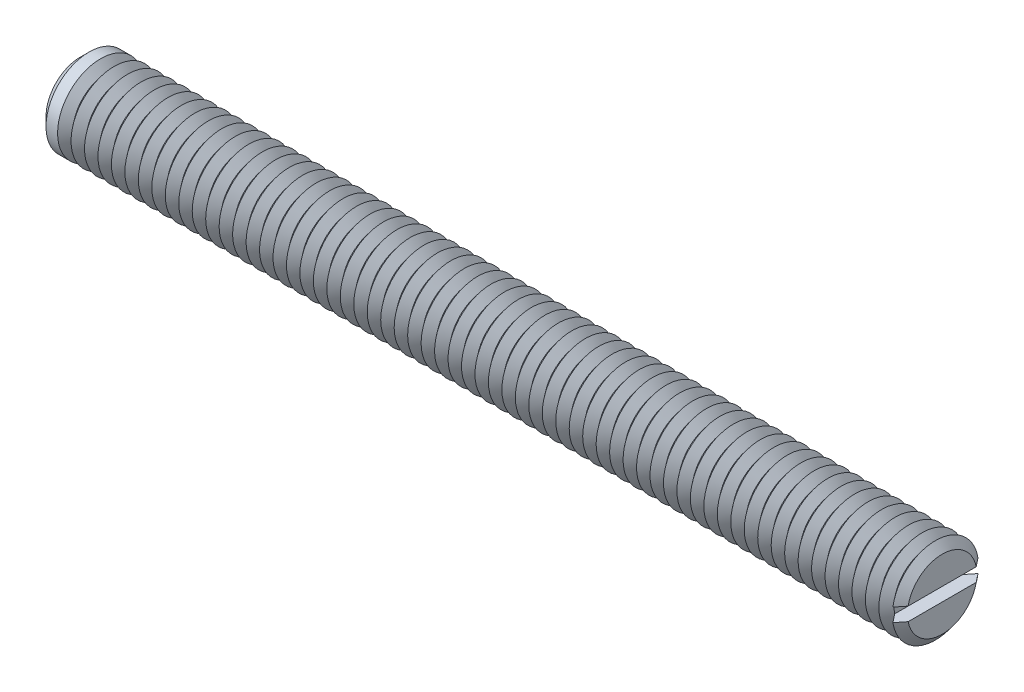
ISO-10303-21;
HEADER;
FILE_DESCRIPTION(('STEP AP214'),'2;1');
FILE_NAME('part.step','',(''),(''),'','','');
FILE_SCHEMA(('AUTOMOTIVE_DESIGN { 1 0 10303 214 1 1 1 1 }'));
ENDSEC;
DATA;
#1=APPLICATION_CONTEXT('core data for automotive mechanical design processes');
#2=APPLICATION_PROTOCOL_DEFINITION('international standard','automotive_design',2000,#1);
#3=PRODUCT_CONTEXT('',#1,'mechanical');
#4=PRODUCT('Part','Part','',(#3));
#5=PRODUCT_RELATED_PRODUCT_CATEGORY('part','',(#4));
#6=PRODUCT_DEFINITION_FORMATION('','',#4);
#7=PRODUCT_DEFINITION_CONTEXT('part definition',#1,'design');
#8=PRODUCT_DEFINITION('design','',#6,#7);
#9=PRODUCT_DEFINITION_SHAPE('','',#8);
#10=(LENGTH_UNIT() NAMED_UNIT(*) SI_UNIT(.MILLI.,.METRE.));
#11=(NAMED_UNIT(*) PLANE_ANGLE_UNIT() SI_UNIT($,.RADIAN.));
#12=(NAMED_UNIT(*) SI_UNIT($,.STERADIAN.) SOLID_ANGLE_UNIT());
#13=UNCERTAINTY_MEASURE_WITH_UNIT(LENGTH_MEASURE(1.E-05),#10,'distance_accuracy_value','');
#14=(GEOMETRIC_REPRESENTATION_CONTEXT(3) GLOBAL_UNCERTAINTY_ASSIGNED_CONTEXT((#13)) GLOBAL_UNIT_ASSIGNED_CONTEXT((#10,
#11,#12)) REPRESENTATION_CONTEXT('',''));
#15=CARTESIAN_POINT('',(0.,0.,0.));
#16=DIRECTION('',(0.,0.,1.));
#17=DIRECTION('',(1.,0.,0.));
#18=AXIS2_PLACEMENT_3D('',#15,#16,#17);
#19=CARTESIAN_POINT('',(39.375,0.,0.));
#20=DIRECTION('',(1.,0.,0.));
#21=DIRECTION('',(0.,0.,-1.));
#22=AXIS2_PLACEMENT_3D('',#19,#20,#21);
#23=CONICAL_SURFACE('',#22,4.,0.895664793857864);
#24=CARTESIAN_POINT('',(39.375,0.,0.));
#25=DIRECTION('',(-1.,0.,0.));
#26=DIRECTION('',(0.,0.,1.));
#27=AXIS2_PLACEMENT_3D('',#24,#25,#26);
#28=CIRCLE('',#27,4.);
#29=CARTESIAN_POINT('',(39.375,-0.625,-3.95087015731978));
#30=VERTEX_POINT('',#29);
#31=CARTESIAN_POINT('',(39.375,-0.625,3.95087015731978));
#32=VERTEX_POINT('',#31);
#33=EDGE_CURVE('E117',#30,#32,#28,.T.);
#34=ORIENTED_EDGE('',*,*,#33,.T.);
#35=CARTESIAN_POINT('',(43.1614902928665,-0.625,-8.70692181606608));
#36=CARTESIAN_POINT('',(42.9148555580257,-0.625,-8.39807520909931));
#37=CARTESIAN_POINT('',(42.6682552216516,-0.625,-8.08920109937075));
#38=CARTESIAN_POINT('',(42.1751408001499,-0.625,-7.47132164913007));
#39=CARTESIAN_POINT('',(41.9286267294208,-0.625,-7.16231629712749));
#40=CARTESIAN_POINT('',(41.4351922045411,-0.625,-6.54345822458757));
#41=CARTESIAN_POINT('',(41.1882721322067,-0.625,-6.23360519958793));
#42=CARTESIAN_POINT('',(40.6947157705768,-0.625,-5.61373487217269));
#43=CARTESIAN_POINT('',(40.4480794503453,-0.625,-5.30371759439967));
#44=CARTESIAN_POINT('',(40.0704817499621,-0.625,-4.82841623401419));
#45=CARTESIAN_POINT('',(39.9393680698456,-0.625,-4.6632531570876));
#46=CARTESIAN_POINT('',(39.6773052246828,-0.625,-4.33279290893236));
#47=CARTESIAN_POINT('',(39.5463560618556,-0.625,-4.16749573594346));
#48=CARTESIAN_POINT('',(39.2846416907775,-0.625,-3.83665276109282));
#49=CARTESIAN_POINT('',(39.1538765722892,-0.625,-3.67110688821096));
#50=CARTESIAN_POINT('',(38.892697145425,-0.625,-3.33975147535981));
#51=CARTESIAN_POINT('',(38.7622828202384,-0.625,-3.17394194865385));
#52=CARTESIAN_POINT('',(38.5022082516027,-0.625,-2.84217045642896));
#53=CARTESIAN_POINT('',(38.3725471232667,-0.625,-2.67620918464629));
#54=CARTESIAN_POINT('',(38.1140928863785,-0.625,-2.34356113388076));
#55=CARTESIAN_POINT('',(37.985299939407,-0.625,-2.17687422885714));
#56=CARTESIAN_POINT('',(37.7934479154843,-0.625,-1.92591523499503));
#57=CARTESIAN_POINT('',(37.7297426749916,-0.625,-1.84213757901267));
#58=CARTESIAN_POINT('',(37.6029724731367,-0.625,-1.67409978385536));
#59=CARTESIAN_POINT('',(37.5399075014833,-0.625,-1.58983965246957));
#60=CARTESIAN_POINT('',(37.4147785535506,-0.625,-1.42061659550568));
#61=CARTESIAN_POINT('',(37.3527142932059,-0.625,-1.33565388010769));
#62=CARTESIAN_POINT('',(37.2301881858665,-0.625,-1.16458302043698));
#63=CARTESIAN_POINT('',(37.1697261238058,-0.625,-1.0784750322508));
#64=CARTESIAN_POINT('',(37.0976838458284,-0.625,-0.972092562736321));
#65=CARTESIAN_POINT('',(37.0847024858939,-0.625,-0.952767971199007));
#66=CARTESIAN_POINT('',(37.058912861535,-0.625,-0.914003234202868));
#67=CARTESIAN_POINT('',(37.0461046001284,-0.625,-0.894563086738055));
#68=CARTESIAN_POINT('',(37.0079767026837,-0.625,-0.836043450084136));
#69=CARTESIAN_POINT('',(36.9829560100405,-0.625,-0.79676778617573));
#70=CARTESIAN_POINT('',(36.9339776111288,-0.625,-0.717444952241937));
#71=CARTESIAN_POINT('',(36.9100221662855,-0.625,-0.677396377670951));
#72=CARTESIAN_POINT('',(36.8637207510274,-0.625,-0.596377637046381));
#73=CARTESIAN_POINT('',(36.8413744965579,-0.625,-0.555407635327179));
#74=CARTESIAN_POINT('',(36.8059952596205,-0.625,-0.485816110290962));
#75=CARTESIAN_POINT('',(36.7923049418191,-0.625,-0.45753381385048));
#76=CARTESIAN_POINT('',(36.766378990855,-0.625,-0.400313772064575));
#77=CARTESIAN_POINT('',(36.7541438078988,-0.625,-0.37137582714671));
#78=CARTESIAN_POINT('',(36.7204304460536,-0.625,-0.283641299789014));
#79=CARTESIAN_POINT('',(36.7017774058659,-0.625,-0.223617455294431));
#80=CARTESIAN_POINT('',(36.6847644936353,-0.625,-0.139102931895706));
#81=CARTESIAN_POINT('',(36.68099555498,-0.625,-0.115688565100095));
#82=CARTESIAN_POINT('',(36.6755004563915,-0.625,-0.0686260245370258));
#83=CARTESIAN_POINT('',(36.6737732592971,-0.625,-0.0449779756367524));
#84=CARTESIAN_POINT('',(36.6724835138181,-0.625,0.002343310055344));
#85=CARTESIAN_POINT('',(36.672917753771,-0.625,0.0260164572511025));
#86=CARTESIAN_POINT('',(36.6759063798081,-0.625,0.0732268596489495));
#87=CARTESIAN_POINT('',(36.6784611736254,-0.625,0.0967640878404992));
#88=CARTESIAN_POINT('',(36.691400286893,-0.625,0.182271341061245));
#89=CARTESIAN_POINT('',(36.707744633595,-0.625,0.243366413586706));
#90=CARTESIAN_POINT('',(36.7388887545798,-0.625,0.332669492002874));
#91=CARTESIAN_POINT('',(36.7504419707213,-0.625,0.362174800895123));
#92=CARTESIAN_POINT('',(36.7752210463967,-0.625,0.420481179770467));
#93=CARTESIAN_POINT('',(36.7884464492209,-0.625,0.449282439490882));
#94=CARTESIAN_POINT('',(36.8174677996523,-0.625,0.50897263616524));
#95=CARTESIAN_POINT('',(36.8333885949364,-0.625,0.539799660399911));
#96=CARTESIAN_POINT('',(36.8663425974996,-0.625,0.600856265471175));
#97=CARTESIAN_POINT('',(36.8833759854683,-0.625,0.631085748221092));
#98=CARTESIAN_POINT('',(36.9357348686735,-0.625,0.72110013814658));
#99=CARTESIAN_POINT('',(36.9722948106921,-0.625,0.780163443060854));
#100=CARTESIAN_POINT('',(37.0474296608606,-0.625,0.897183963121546));
#101=CARTESIAN_POINT('',(37.0860094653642,-0.625,0.95513797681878));
#102=CARTESIAN_POINT('',(37.1644096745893,-0.625,1.0702065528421));
#103=CARTESIAN_POINT('',(37.2042302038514,-0.625,1.12732103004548));
#104=CARTESIAN_POINT('',(37.2847841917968,-0.625,1.24108525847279));
#105=CARTESIAN_POINT('',(37.3255194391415,-0.625,1.29773373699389));
#106=CARTESIAN_POINT('',(37.4075780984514,-0.625,1.4106117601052));
#107=CARTESIAN_POINT('',(37.4489015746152,-0.625,1.46684125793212));
#108=CARTESIAN_POINT('',(37.5733456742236,-0.625,1.63486189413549));
#109=CARTESIAN_POINT('',(37.6570882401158,-0.625,1.74619171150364));
#110=CARTESIAN_POINT('',(37.8245788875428,-0.625,1.96690364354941));
#111=CARTESIAN_POINT('',(37.9083166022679,-0.625,2.07629366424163));
#112=CARTESIAN_POINT('',(38.0763821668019,-0.625,2.29462016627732));
#113=CARTESIAN_POINT('',(38.1607100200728,-0.625,2.40355664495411));
#114=CARTESIAN_POINT('',(38.4142762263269,-0.625,2.72992534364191));
#115=CARTESIAN_POINT('',(38.5840912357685,-0.625,2.94690900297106));
#116=CARTESIAN_POINT('',(38.9246141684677,-0.625,3.38042406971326));
#117=CARTESIAN_POINT('',(39.095322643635,-0.625,3.5969550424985));
#118=CARTESIAN_POINT('',(39.4371950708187,-0.625,4.02965109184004));
#119=CARTESIAN_POINT('',(39.6083590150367,-0.625,4.24581617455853));
#120=CARTESIAN_POINT('',(39.9504500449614,-0.625,4.67725748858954));
#121=CARTESIAN_POINT('',(40.1213762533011,-0.625,4.89253441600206));
#122=CARTESIAN_POINT('',(40.4634226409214,-0.625,5.32293566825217));
#123=CARTESIAN_POINT('',(40.634542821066,-0.625,5.53805999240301));
#124=CARTESIAN_POINT('',(41.1480384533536,-0.625,6.18319284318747));
#125=CARTESIAN_POINT('',(41.4906134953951,-0.625,6.61304248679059));
#126=CARTESIAN_POINT('',(41.9438892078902,-0.625,7.18140561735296));
#127=CARTESIAN_POINT('',(42.0544613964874,-0.625,7.32002163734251));
#128=CARTESIAN_POINT('',(42.2756363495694,-0.625,7.59723760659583));
#129=CARTESIAN_POINT('',(42.386239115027,-0.625,7.73583755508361));
#130=CARTESIAN_POINT('',(42.6076076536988,-0.625,8.01319622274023));
#131=CARTESIAN_POINT('',(42.7183734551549,-0.625,8.15195491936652));
#132=CARTESIAN_POINT('',(42.939920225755,-0.625,8.42945184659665));
#133=CARTESIAN_POINT('',(43.0507011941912,-0.625,8.56819007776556));
#134=CARTESIAN_POINT('',(43.1614902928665,-0.625,8.70692181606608));
#135=B_SPLINE_CURVE_WITH_KNOTS('',3,(#35,#36,#37,#38,#39,#40,#41,#42,#43,#44,#45,#46,#47,#48,
#49,#50,#51,#52,#53,#54,#55,#56,#57,#58,#59,#60,#61,#62,#63,#64,#65,#66,#67,#68,#69,#70,#71,#72,
#73,#74,#75,#76,#77,#78,#79,#80,#81,#82,#83,#84,#85,#86,#87,#88,#89,#90,#91,#92,#93,#94,#95,#96,
#97,#98,#99,#100,#101,#102,#103,#104,#105,#106,#107,#108,#109,#110,#111,#112,#113,#114,#115,
#116,#117,#118,#119,#120,#121,#122,#123,#124,#125,#126,#127,#128,#129,#130,#131,#132,#133,#134),
.UNSPECIFIED.,.F.,.F.,(4,2,2,2,2,2,2,2,2,2,2,2,2,2,2,2,2,2,2,2,2,2,2,2,2,2,2,2,2,2,2,2,2,2,2,2,
2,2,2,2,2,2,2,2,2,2,2,2,2,4),(0.,1.18572103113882,2.37158837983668,3.56020338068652,
4.74867342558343,5.38130812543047,6.01395126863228,6.64683693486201,7.27969171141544,
7.91151062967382,8.54344406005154,8.85918511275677,9.17492108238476,9.49056578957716,
9.8061679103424,9.8760068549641,9.94584701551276,10.0855382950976,10.2255132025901,
10.3654633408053,10.4596856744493,10.5539370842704,10.741396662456,10.8124690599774,
10.8835053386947,10.9544360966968,11.0253804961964,11.2137597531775,11.3088096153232,
11.403833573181,11.5078935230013,11.6119704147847,11.8202840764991,12.0291284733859,
12.2379939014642,12.4473111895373,12.6566515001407,13.0745694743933,13.4878513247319,
13.9011356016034,14.7277337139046,15.5549232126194,16.3820986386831,17.2067434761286,
18.0313920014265,19.6803778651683,20.2123228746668,20.7442873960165,21.2769292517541,
21.8095515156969),.UNSPECIFIED.);
#136=CARTESIAN_POINT('',(38.75,-0.625,3.1581247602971));
#137=VERTEX_POINT('',#136);
#138=EDGE_CURVE('E109',#137,#32,#135,.T.);
#139=ORIENTED_EDGE('',*,*,#138,.F.);
#140=CARTESIAN_POINT('',(38.75,0.,0.));
#141=DIRECTION('',(-1.,0.,0.));
#142=DIRECTION('',(0.,0.,1.));
#143=AXIS2_PLACEMENT_3D('',#140,#141,#142);
#144=CIRCLE('',#143,3.2193752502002);
#145=CARTESIAN_POINT('',(38.75,-0.625,-3.1581247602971));
#146=VERTEX_POINT('',#145);
#147=EDGE_CURVE('E720',#146,#137,#144,.T.);
#148=ORIENTED_EDGE('',*,*,#147,.F.);
#149=EDGE_CURVE('E58',#30,#146,#135,.T.);
#150=ORIENTED_EDGE('',*,*,#149,.F.);
#151=EDGE_LOOP('',(#34,#139,#148,#150));
#152=FACE_BOUND('',#151,.T.);
#153=ADVANCED_FACE('F37',(#152),#23,.T.);
#154=CARTESIAN_POINT('',(39.375,0.625,3.95087015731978));
#155=VERTEX_POINT('',#154);
#156=CARTESIAN_POINT('',(39.375,0.625,-3.95087015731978));
#157=VERTEX_POINT('',#156);
#158=EDGE_CURVE('E100',#155,#157,#28,.T.);
#159=ORIENTED_EDGE('',*,*,#158,.T.);
#160=CARTESIAN_POINT('',(43.1614902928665,0.625,8.70692181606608));
#161=CARTESIAN_POINT('',(42.9148555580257,0.625,8.39807520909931));
#162=CARTESIAN_POINT('',(42.6682552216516,0.625,8.08920109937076));
#163=CARTESIAN_POINT('',(42.1751408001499,0.625,7.47132164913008));
#164=CARTESIAN_POINT('',(41.9286267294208,0.625,7.1623162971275));
#165=CARTESIAN_POINT('',(41.4351922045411,0.625,6.54345822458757));
#166=CARTESIAN_POINT('',(41.1882721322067,0.625,6.23360519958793));
#167=CARTESIAN_POINT('',(40.6947157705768,0.625,5.61373487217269));
#168=CARTESIAN_POINT('',(40.4480794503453,0.625,5.30371759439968));
#169=CARTESIAN_POINT('',(40.0704817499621,0.625,4.82841623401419));
#170=CARTESIAN_POINT('',(39.9393680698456,0.625,4.6632531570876));
#171=CARTESIAN_POINT('',(39.6773052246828,0.625,4.33279290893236));
#172=CARTESIAN_POINT('',(39.5463560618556,0.625,4.16749573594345));
#173=CARTESIAN_POINT('',(39.2846416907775,0.625,3.83665276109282));
#174=CARTESIAN_POINT('',(39.1538765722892,0.625,3.67110688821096));
#175=CARTESIAN_POINT('',(38.892697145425,0.625,3.33975147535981));
#176=CARTESIAN_POINT('',(38.7622828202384,0.625,3.17394194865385));
#177=CARTESIAN_POINT('',(38.5022082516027,0.625,2.84217045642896));
#178=CARTESIAN_POINT('',(38.3725471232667,0.625,2.67620918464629));
#179=CARTESIAN_POINT('',(38.1140928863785,0.625,2.34356113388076));
#180=CARTESIAN_POINT('',(37.985299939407,0.625,2.17687422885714));
#181=CARTESIAN_POINT('',(37.7934479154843,0.625,1.92591523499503));
#182=CARTESIAN_POINT('',(37.7297426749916,0.625,1.84213757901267));
#183=CARTESIAN_POINT('',(37.6029724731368,0.625,1.67409978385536));
#184=CARTESIAN_POINT('',(37.5399075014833,0.625,1.58983965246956));
#185=CARTESIAN_POINT('',(37.4147785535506,0.625,1.42061659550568));
#186=CARTESIAN_POINT('',(37.3527142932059,0.625,1.33565388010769));
#187=CARTESIAN_POINT('',(37.2301881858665,0.625,1.16458302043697));
#188=CARTESIAN_POINT('',(37.1697261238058,0.625,1.0784750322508));
#189=CARTESIAN_POINT('',(37.0976838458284,0.625,0.972092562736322));
#190=CARTESIAN_POINT('',(37.0847024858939,0.625,0.95276797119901));
#191=CARTESIAN_POINT('',(37.058912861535,0.625,0.914003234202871));
#192=CARTESIAN_POINT('',(37.0461046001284,0.625,0.894563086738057));
#193=CARTESIAN_POINT('',(37.0079767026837,0.625,0.836043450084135));
#194=CARTESIAN_POINT('',(36.9829560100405,0.625,0.79676778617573));
#195=CARTESIAN_POINT('',(36.9339776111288,0.625,0.717444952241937));
#196=CARTESIAN_POINT('',(36.9100221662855,0.625,0.677396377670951));
#197=CARTESIAN_POINT('',(36.8637207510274,0.625,0.596377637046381));
#198=CARTESIAN_POINT('',(36.8413744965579,0.625,0.555407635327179));
#199=CARTESIAN_POINT('',(36.8059952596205,0.625,0.485816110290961));
#200=CARTESIAN_POINT('',(36.7923049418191,0.625,0.45753381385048));
#201=CARTESIAN_POINT('',(36.766378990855,0.625,0.400313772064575));
#202=CARTESIAN_POINT('',(36.7541438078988,0.625,0.37137582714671));
#203=CARTESIAN_POINT('',(36.7204304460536,0.625,0.283641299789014));
#204=CARTESIAN_POINT('',(36.7017774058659,0.625,0.22361745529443));
#205=CARTESIAN_POINT('',(36.6847644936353,0.625,0.139102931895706));
#206=CARTESIAN_POINT('',(36.68099555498,0.625,0.115688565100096));
#207=CARTESIAN_POINT('',(36.6755004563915,0.625,0.0686260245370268));
#208=CARTESIAN_POINT('',(36.6737732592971,0.625,0.0449779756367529));
#209=CARTESIAN_POINT('',(36.6724835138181,0.625,-0.00234331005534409));
#210=CARTESIAN_POINT('',(36.672917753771,0.625,-0.0260164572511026));
#211=CARTESIAN_POINT('',(36.6759063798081,0.625,-0.0732268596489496));
#212=CARTESIAN_POINT('',(36.6784611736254,0.625,-0.0967640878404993));
#213=CARTESIAN_POINT('',(36.691400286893,0.625,-0.182271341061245));
#214=CARTESIAN_POINT('',(36.707744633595,0.625,-0.243366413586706));
#215=CARTESIAN_POINT('',(36.7388887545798,0.625,-0.332669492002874));
#216=CARTESIAN_POINT('',(36.7504419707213,0.625,-0.362174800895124));
#217=CARTESIAN_POINT('',(36.7752210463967,0.625,-0.420481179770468));
#218=CARTESIAN_POINT('',(36.7884464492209,0.625,-0.449282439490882));
#219=CARTESIAN_POINT('',(36.8174677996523,0.625,-0.508972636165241));
#220=CARTESIAN_POINT('',(36.8333885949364,0.625,-0.539799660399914));
#221=CARTESIAN_POINT('',(36.8663425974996,0.625,-0.600856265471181));
#222=CARTESIAN_POINT('',(36.8833759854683,0.625,-0.631085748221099));
#223=CARTESIAN_POINT('',(36.9357348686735,0.625,-0.721100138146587));
#224=CARTESIAN_POINT('',(36.9722948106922,0.625,-0.780163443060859));
#225=CARTESIAN_POINT('',(37.0474296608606,0.625,-0.897183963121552));
#226=CARTESIAN_POINT('',(37.0860094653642,0.625,-0.955137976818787));
#227=CARTESIAN_POINT('',(37.1644096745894,0.625,-1.07020655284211));
#228=CARTESIAN_POINT('',(37.2042302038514,0.625,-1.12732103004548));
#229=CARTESIAN_POINT('',(37.2847841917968,0.625,-1.24108525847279));
#230=CARTESIAN_POINT('',(37.3255194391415,0.625,-1.29773373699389));
#231=CARTESIAN_POINT('',(37.4075780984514,0.625,-1.4106117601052));
#232=CARTESIAN_POINT('',(37.4489015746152,0.625,-1.46684125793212));
#233=CARTESIAN_POINT('',(37.5733456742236,0.625,-1.63486189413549));
#234=CARTESIAN_POINT('',(37.6570882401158,0.625,-1.74619171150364));
#235=CARTESIAN_POINT('',(37.8245788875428,0.625,-1.96690364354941));
#236=CARTESIAN_POINT('',(37.9083166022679,0.625,-2.07629366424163));
#237=CARTESIAN_POINT('',(38.0763821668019,0.625,-2.29462016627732));
#238=CARTESIAN_POINT('',(38.1607100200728,0.625,-2.40355664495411));
#239=CARTESIAN_POINT('',(38.4142762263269,0.625,-2.72992534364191));
#240=CARTESIAN_POINT('',(38.5840912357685,0.625,-2.94690900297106));
#241=CARTESIAN_POINT('',(38.9246141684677,0.625,-3.38042406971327));
#242=CARTESIAN_POINT('',(39.095322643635,0.625,-3.5969550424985));
#243=CARTESIAN_POINT('',(39.4371950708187,0.625,-4.02965109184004));
#244=CARTESIAN_POINT('',(39.6083590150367,0.625,-4.24581617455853));
#245=CARTESIAN_POINT('',(39.9504500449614,0.625,-4.67725748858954));
#246=CARTESIAN_POINT('',(40.1213762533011,0.625,-4.89253441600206));
#247=CARTESIAN_POINT('',(40.4634226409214,0.625,-5.32293566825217));
#248=CARTESIAN_POINT('',(40.634542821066,0.625,-5.53805999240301));
#249=CARTESIAN_POINT('',(41.1480384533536,0.625,-6.18319284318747));
#250=CARTESIAN_POINT('',(41.4906134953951,0.625,-6.61304248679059));
#251=CARTESIAN_POINT('',(41.9438892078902,0.625,-7.18140561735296));
#252=CARTESIAN_POINT('',(42.0544613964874,0.625,-7.32002163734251));
#253=CARTESIAN_POINT('',(42.2756363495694,0.625,-7.59723760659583));
#254=CARTESIAN_POINT('',(42.386239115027,0.625,-7.73583755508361));
#255=CARTESIAN_POINT('',(42.6076076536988,0.625,-8.01319622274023));
#256=CARTESIAN_POINT('',(42.7183734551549,0.625,-8.15195491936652));
#257=CARTESIAN_POINT('',(42.939920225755,0.625,-8.42945184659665));
#258=CARTESIAN_POINT('',(43.0507011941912,0.625,-8.56819007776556));
#259=CARTESIAN_POINT('',(43.1614902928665,0.625,-8.70692181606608));
#260=B_SPLINE_CURVE_WITH_KNOTS('',3,(#160,#161,#162,#163,#164,#165,#166,#167,#168,#169,#170,
#171,#172,#173,#174,#175,#176,#177,#178,#179,#180,#181,#182,#183,#184,#185,#186,#187,#188,#189,
#190,#191,#192,#193,#194,#195,#196,#197,#198,#199,#200,#201,#202,#203,#204,#205,#206,#207,#208,
#209,#210,#211,#212,#213,#214,#215,#216,#217,#218,#219,#220,#221,#222,#223,#224,#225,#226,#227,
#228,#229,#230,#231,#232,#233,#234,#235,#236,#237,#238,#239,#240,#241,#242,#243,#244,#245,#246,
#247,#248,#249,#250,#251,#252,#253,#254,#255,#256,#257,#258,#259),.UNSPECIFIED.,.F.,.F.,(4,2,2,
2,2,2,2,2,2,2,2,2,2,2,2,2,2,2,2,2,2,2,2,2,2,2,2,2,2,2,2,2,2,2,2,2,2,2,2,2,2,2,2,2,2,2,2,2,2,4),
(0.,1.18572103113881,2.37158837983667,3.56020338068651,4.74867342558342,5.38130812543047,
6.01395126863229,6.64683693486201,7.27969171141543,7.91151062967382,8.54344406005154,
8.85918511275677,9.17492108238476,9.49056578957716,9.80616791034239,9.87600685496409,
9.94584701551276,10.0855382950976,10.2255132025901,10.3654633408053,10.4596856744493,
10.5539370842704,10.741396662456,10.8124690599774,10.8835053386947,10.9544360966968,
11.0253804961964,11.2137597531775,11.3088096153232,11.403833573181,11.5078935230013,
11.6119704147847,11.8202840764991,12.0291284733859,12.2379939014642,12.4473111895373,
12.6566515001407,13.0745694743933,13.4878513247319,13.9011356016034,14.7277337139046,
15.5549232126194,16.3820986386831,17.2067434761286,18.0313920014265,19.6803778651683,
20.2123228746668,20.7442873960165,21.2769292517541,21.8095515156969),.UNSPECIFIED.);
#261=CARTESIAN_POINT('',(38.75,0.625,-3.1581247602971));
#262=VERTEX_POINT('',#261);
#263=EDGE_CURVE('E110',#262,#157,#260,.T.);
#264=ORIENTED_EDGE('',*,*,#263,.F.);
#265=CARTESIAN_POINT('',(38.75,0.625,3.1581247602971));
#266=VERTEX_POINT('',#265);
#267=EDGE_CURVE('E103',#266,#262,#144,.T.);
#268=ORIENTED_EDGE('',*,*,#267,.F.);
#269=EDGE_CURVE('E97',#155,#266,#260,.T.);
#270=ORIENTED_EDGE('',*,*,#269,.F.);
#271=EDGE_LOOP('',(#159,#264,#268,#270));
#272=FACE_BOUND('',#271,.T.);
#273=ADVANCED_FACE('F99',(#272),#23,.T.);
#274=CARTESIAN_POINT('',(38.75,0.,0.));
#275=DIRECTION('',(-1.,0.,0.));
#276=DIRECTION('',(0.,0.,1.));
#277=AXIS2_PLACEMENT_3D('',#274,#275,#276);
#278=CONICAL_SURFACE('',#277,3.2193752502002,0.895664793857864);
#279=CARTESIAN_POINT('',(38.125,0.,0.));
#280=DIRECTION('',(-1.,0.,0.));
#281=DIRECTION('',(0.,0.,1.));
#282=AXIS2_PLACEMENT_3D('',#279,#280,#281);
#283=CIRCLE('',#282,4.);
#284=CARTESIAN_POINT('',(38.125,0.,4.));
#285=VERTEX_POINT('',#284);
#286=EDGE_CURVE('E705',#285,#285,#283,.T.);
#287=ORIENTED_EDGE('',*,*,#286,.F.);
#288=EDGE_LOOP('',(#287));
#289=FACE_BOUND('',#288,.T.);
#290=ORIENTED_EDGE('',*,*,#267,.T.);
#291=EDGE_CURVE('E714',#262,#146,#144,.T.);
#292=ORIENTED_EDGE('',*,*,#291,.T.);
#293=ORIENTED_EDGE('',*,*,#147,.T.);
#294=EDGE_CURVE('E712',#137,#266,#144,.T.);
#295=ORIENTED_EDGE('',*,*,#294,.T.);
#296=EDGE_LOOP('',(#290,#292,#293,#295));
#297=FACE_BOUND('',#296,.T.);
#298=ADVANCED_FACE('F166',(#289,#297),#278,.T.);
#299=CARTESIAN_POINT('',(40.,0.,0.));
#300=DIRECTION('',(1.,0.,0.));
#301=DIRECTION('',(0.,0.,-1.));
#302=AXIS2_PLACEMENT_3D('',#299,#300,#301);
#303=PLANE('',#302);
#304=CARTESIAN_POINT('',(40.,0.,0.));
#305=DIRECTION('',(-1.,0.,0.));
#306=DIRECTION('',(0.,0.,1.));
#307=AXIS2_PLACEMENT_3D('',#304,#305,#306);
#308=CIRCLE('',#307,3.2193752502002);
#309=CARTESIAN_POINT('',(40.,0.625,3.1581247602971));
#310=VERTEX_POINT('',#309);
#311=CARTESIAN_POINT('',(40.,0.625,-3.1581247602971));
#312=VERTEX_POINT('',#311);
#313=EDGE_CURVE('E158',#310,#312,#308,.T.);
#314=ORIENTED_EDGE('',*,*,#313,.F.);
#315=DIRECTION('',(0.,0.,1.));
#316=VECTOR('',#315,1.);
#317=CARTESIAN_POINT('',(40.,0.625,0.));
#318=LINE('',#317,#316);
#319=EDGE_CURVE('E122',#312,#310,#318,.T.);
#320=ORIENTED_EDGE('',*,*,#319,.F.);
#321=EDGE_LOOP('',(#314,#320));
#322=FACE_BOUND('',#321,.T.);
#323=ADVANCED_FACE('F170',(#322),#303,.T.);
#324=CARTESIAN_POINT('',(40.,-0.625,-3.1581247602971));
#325=VERTEX_POINT('',#324);
#326=CARTESIAN_POINT('',(40.,-0.625,3.1581247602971));
#327=VERTEX_POINT('',#326);
#328=EDGE_CURVE('E66',#325,#327,#308,.T.);
#329=ORIENTED_EDGE('',*,*,#328,.F.);
#330=DIRECTION('',(0.,0.,-1.));
#331=VECTOR('',#330,1.);
#332=CARTESIAN_POINT('',(40.,-0.625,0.));
#333=LINE('',#332,#331);
#334=EDGE_CURVE('E135',#327,#325,#333,.T.);
#335=ORIENTED_EDGE('',*,*,#334,.F.);
#336=EDGE_LOOP('',(#329,#335));
#337=FACE_BOUND('',#336,.T.);
#338=ADVANCED_FACE('F200',(#337),#303,.T.);
#339=CARTESIAN_POINT('',(40.,0.,0.));
#340=DIRECTION('',(-1.,0.,0.));
#341=DIRECTION('',(0.,0.,1.));
#342=AXIS2_PLACEMENT_3D('',#339,#340,#341);
#343=CONICAL_SURFACE('',#342,3.2193752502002,0.895664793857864);
#344=ORIENTED_EDGE('',*,*,#158,.F.);
#345=CARTESIAN_POINT('',(35.5885097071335,0.625,-8.70692181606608));
#346=CARTESIAN_POINT('',(35.8351444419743,0.625,-8.39807520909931));
#347=CARTESIAN_POINT('',(36.0817447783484,0.625,-8.08920109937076));
#348=CARTESIAN_POINT('',(36.5748591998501,0.625,-7.47132164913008));
#349=CARTESIAN_POINT('',(36.8213732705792,0.625,-7.1623162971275));
#350=CARTESIAN_POINT('',(37.3148077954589,0.625,-6.54345822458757));
#351=CARTESIAN_POINT('',(37.5617278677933,0.625,-6.23360519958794));
#352=CARTESIAN_POINT('',(38.0552842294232,0.625,-5.61373487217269));
#353=CARTESIAN_POINT('',(38.3019205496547,0.625,-5.30371759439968));
#354=CARTESIAN_POINT('',(38.6795182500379,0.625,-4.82841623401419));
#355=CARTESIAN_POINT('',(38.8106319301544,0.625,-4.6632531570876));
#356=CARTESIAN_POINT('',(39.0726947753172,0.625,-4.33279290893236));
#357=CARTESIAN_POINT('',(39.2036439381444,0.625,-4.16749573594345));
#358=CARTESIAN_POINT('',(39.4653583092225,0.625,-3.83665276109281));
#359=CARTESIAN_POINT('',(39.5961234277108,0.625,-3.67110688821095));
#360=CARTESIAN_POINT('',(39.857302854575,0.625,-3.3397514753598));
#361=CARTESIAN_POINT('',(39.9877171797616,0.625,-3.17394194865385));
#362=CARTESIAN_POINT('',(40.2477917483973,0.625,-2.84217045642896));
#363=CARTESIAN_POINT('',(40.3774528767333,0.625,-2.67620918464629));
#364=CARTESIAN_POINT('',(40.6359071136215,0.625,-2.34356113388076));
#365=CARTESIAN_POINT('',(40.764700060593,0.625,-2.17687422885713));
#366=CARTESIAN_POINT('',(40.9565520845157,0.625,-1.92591523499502));
#367=CARTESIAN_POINT('',(41.0202573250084,0.625,-1.84213757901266));
#368=CARTESIAN_POINT('',(41.1470275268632,0.625,-1.67409978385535));
#369=CARTESIAN_POINT('',(41.2100924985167,0.625,-1.58983965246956));
#370=CARTESIAN_POINT('',(41.3352214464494,0.625,-1.42061659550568));
#371=CARTESIAN_POINT('',(41.3972857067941,0.625,-1.33565388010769));
#372=CARTESIAN_POINT('',(41.5198118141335,0.625,-1.16458302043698));
#373=CARTESIAN_POINT('',(41.5802738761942,0.625,-1.0784750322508));
#374=CARTESIAN_POINT('',(41.6523161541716,0.625,-0.972092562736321));
#375=CARTESIAN_POINT('',(41.6652975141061,0.625,-0.952767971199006));
#376=CARTESIAN_POINT('',(41.691087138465,0.625,-0.914003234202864));
#377=CARTESIAN_POINT('',(41.7038953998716,0.625,-0.894563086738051));
#378=CARTESIAN_POINT('',(41.7420232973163,0.625,-0.83604345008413));
#379=CARTESIAN_POINT('',(41.7670439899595,0.625,-0.796767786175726));
#380=CARTESIAN_POINT('',(41.8160223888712,0.625,-0.717444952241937));
#381=CARTESIAN_POINT('',(41.8399778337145,0.625,-0.677396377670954));
#382=CARTESIAN_POINT('',(41.8862792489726,0.625,-0.596377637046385));
#383=CARTESIAN_POINT('',(41.9086255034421,0.625,-0.555407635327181));
#384=CARTESIAN_POINT('',(41.9440047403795,0.625,-0.485816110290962));
#385=CARTESIAN_POINT('',(41.9576950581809,0.625,-0.45753381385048));
#386=CARTESIAN_POINT('',(41.983621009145,0.625,-0.400313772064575));
#387=CARTESIAN_POINT('',(41.9958561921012,0.625,-0.37137582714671));
#388=CARTESIAN_POINT('',(42.0295695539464,0.625,-0.283641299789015));
#389=CARTESIAN_POINT('',(42.0482225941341,0.625,-0.223617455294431));
#390=CARTESIAN_POINT('',(42.0652355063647,0.625,-0.139102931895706));
#391=CARTESIAN_POINT('',(42.06900444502,0.625,-0.115688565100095));
#392=CARTESIAN_POINT('',(42.0744995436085,0.625,-0.0686260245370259));
#393=CARTESIAN_POINT('',(42.0762267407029,0.625,-0.0449779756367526));
#394=CARTESIAN_POINT('',(42.0775164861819,0.625,0.00234331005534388));
#395=CARTESIAN_POINT('',(42.077082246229,0.625,0.0260164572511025));
#396=CARTESIAN_POINT('',(42.0740936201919,0.625,0.0732268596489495));
#397=CARTESIAN_POINT('',(42.0715388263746,0.625,0.0967640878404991));
#398=CARTESIAN_POINT('',(42.058599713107,0.625,0.182271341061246));
#399=CARTESIAN_POINT('',(42.042255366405,0.625,0.24336641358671));
#400=CARTESIAN_POINT('',(42.0111112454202,0.625,0.332669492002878));
#401=CARTESIAN_POINT('',(41.9995580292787,0.625,0.362174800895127));
#402=CARTESIAN_POINT('',(41.9747789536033,0.625,0.420481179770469));
#403=CARTESIAN_POINT('',(41.9615535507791,0.625,0.449282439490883));
#404=CARTESIAN_POINT('',(41.9325322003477,0.625,0.508972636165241));
#405=CARTESIAN_POINT('',(41.9166114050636,0.625,0.539799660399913));
#406=CARTESIAN_POINT('',(41.8836574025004,0.625,0.60085626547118));
#407=CARTESIAN_POINT('',(41.8666240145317,0.625,0.631085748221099));
#408=CARTESIAN_POINT('',(41.8142651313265,0.625,0.721100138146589));
#409=CARTESIAN_POINT('',(41.7777051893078,0.625,0.78016344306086));
#410=CARTESIAN_POINT('',(41.7025703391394,0.625,0.897183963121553));
#411=CARTESIAN_POINT('',(41.6639905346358,0.625,0.955137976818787));
#412=CARTESIAN_POINT('',(41.5855903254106,0.625,1.07020655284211));
#413=CARTESIAN_POINT('',(41.5457697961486,0.625,1.12732103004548));
#414=CARTESIAN_POINT('',(41.4652158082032,0.625,1.24108525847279));
#415=CARTESIAN_POINT('',(41.4244805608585,0.625,1.29773373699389));
#416=CARTESIAN_POINT('',(41.3424219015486,0.625,1.4106117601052));
#417=CARTESIAN_POINT('',(41.3010984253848,0.625,1.46684125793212));
#418=CARTESIAN_POINT('',(41.1766543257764,0.625,1.63486189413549));
#419=CARTESIAN_POINT('',(41.0929117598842,0.625,1.74619171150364));
#420=CARTESIAN_POINT('',(40.9254211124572,0.625,1.96690364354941));
#421=CARTESIAN_POINT('',(40.8416833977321,0.625,2.07629366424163));
#422=CARTESIAN_POINT('',(40.6736178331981,0.625,2.29462016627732));
#423=CARTESIAN_POINT('',(40.5892899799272,0.625,2.40355664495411));
#424=CARTESIAN_POINT('',(40.3357237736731,0.625,2.72992534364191));
#425=CARTESIAN_POINT('',(40.1659087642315,0.625,2.94690900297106));
#426=CARTESIAN_POINT('',(39.8253858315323,0.625,3.38042406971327));
#427=CARTESIAN_POINT('',(39.654677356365,0.625,3.5969550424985));
#428=CARTESIAN_POINT('',(39.3128049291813,0.625,4.02965109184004));
#429=CARTESIAN_POINT('',(39.1416409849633,0.625,4.24581617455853));
#430=CARTESIAN_POINT('',(38.7995499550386,0.625,4.67725748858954));
#431=CARTESIAN_POINT('',(38.6286237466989,0.625,4.89253441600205));
#432=CARTESIAN_POINT('',(38.2865773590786,0.625,5.32293566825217));
#433=CARTESIAN_POINT('',(38.115457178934,0.625,5.53805999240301));
#434=CARTESIAN_POINT('',(37.6019615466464,0.625,6.18319284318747));
#435=CARTESIAN_POINT('',(37.2593865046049,0.625,6.61304248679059));
#436=CARTESIAN_POINT('',(36.8061107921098,0.625,7.18140561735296));
#437=CARTESIAN_POINT('',(36.6955386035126,0.625,7.32002163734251));
#438=CARTESIAN_POINT('',(36.4743636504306,0.625,7.59723760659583));
#439=CARTESIAN_POINT('',(36.363760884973,0.625,7.73583755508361));
#440=CARTESIAN_POINT('',(36.1423923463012,0.625,8.01319622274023));
#441=CARTESIAN_POINT('',(36.0316265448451,0.625,8.15195491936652));
#442=CARTESIAN_POINT('',(35.810079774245,0.625,8.42945184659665));
#443=CARTESIAN_POINT('',(35.6992988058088,0.625,8.56819007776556));
#444=CARTESIAN_POINT('',(35.5885097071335,0.625,8.70692181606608));
#445=B_SPLINE_CURVE_WITH_KNOTS('',3,(#345,#346,#347,#348,#349,#350,#351,#352,#353,#354,#355,
#356,#357,#358,#359,#360,#361,#362,#363,#364,#365,#366,#367,#368,#369,#370,#371,#372,#373,#374,
#375,#376,#377,#378,#379,#380,#381,#382,#383,#384,#385,#386,#387,#388,#389,#390,#391,#392,#393,
#394,#395,#396,#397,#398,#399,#400,#401,#402,#403,#404,#405,#406,#407,#408,#409,#410,#411,#412,
#413,#414,#415,#416,#417,#418,#419,#420,#421,#422,#423,#424,#425,#426,#427,#428,#429,#430,#431,
#432,#433,#434,#435,#436,#437,#438,#439,#440,#441,#442,#443,#444),.UNSPECIFIED.,.F.,.F.,(4,2,2,
2,2,2,2,2,2,2,2,2,2,2,2,2,2,2,2,2,2,2,2,2,2,2,2,2,2,2,2,2,2,2,2,2,2,2,2,2,2,2,2,2,2,2,2,2,2,4),
(0.,1.18572103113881,2.37158837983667,3.56020338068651,4.74867342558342,5.38130812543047,
6.01395126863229,6.64683693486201,7.27969171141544,7.91151062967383,8.54344406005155,
8.85918511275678,9.17492108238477,9.49056578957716,9.8061679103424,9.8760068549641,
9.94584701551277,10.0855382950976,10.2255132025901,10.3654633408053,10.4596856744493,
10.5539370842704,10.741396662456,10.8124690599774,10.8835053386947,10.9544360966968,
11.0253804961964,11.2137597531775,11.3088096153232,11.403833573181,11.5078935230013,
11.6119704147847,11.8202840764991,12.0291284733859,12.2379939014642,12.4473111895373,
12.6566515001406,13.0745694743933,13.4878513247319,13.9011356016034,14.7277337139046,
15.5549232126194,16.3820986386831,17.2067434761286,18.0313920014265,19.6803778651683,
20.2123228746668,20.7442873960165,21.2769292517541,21.8095515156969),.UNSPECIFIED.);
#446=EDGE_CURVE('E41',#310,#155,#445,.T.);
#447=ORIENTED_EDGE('',*,*,#446,.F.);
#448=ORIENTED_EDGE('',*,*,#313,.T.);
#449=EDGE_CURVE('E11',#157,#312,#445,.T.);
#450=ORIENTED_EDGE('',*,*,#449,.F.);
#451=EDGE_LOOP('',(#344,#447,#448,#450));
#452=FACE_BOUND('',#451,.T.);
#453=ADVANCED_FACE('F114',(#452),#343,.T.);
#454=CARTESIAN_POINT('',(40.,0.625,-6.));
#455=DIRECTION('',(0.,1.,0.));
#456=DIRECTION('',(0.,0.,1.));
#457=AXIS2_PLACEMENT_3D('',#454,#455,#456);
#458=PLANE('',#457);
#459=ORIENTED_EDGE('',*,*,#446,.T.);
#460=ORIENTED_EDGE('',*,*,#269,.T.);
#461=DIRECTION('',(0.,0.,1.));
#462=VECTOR('',#461,1.);
#463=CARTESIAN_POINT('',(38.75,0.625,-6.));
#464=LINE('',#463,#462);
#465=EDGE_CURVE('E144',#262,#266,#464,.T.);
#466=ORIENTED_EDGE('',*,*,#465,.F.);
#467=ORIENTED_EDGE('',*,*,#263,.T.);
#468=ORIENTED_EDGE('',*,*,#449,.T.);
#469=ORIENTED_EDGE('',*,*,#319,.T.);
#470=EDGE_LOOP('',(#459,#460,#466,#467,#468,#469));
#471=FACE_BOUND('',#470,.T.);
#472=ADVANCED_FACE('F120',(#471),#458,.F.);
#473=ORIENTED_EDGE('',*,*,#33,.F.);
#474=CARTESIAN_POINT('',(35.5885097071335,-0.625,8.70692181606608));
#475=CARTESIAN_POINT('',(35.8351444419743,-0.625,8.39807520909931));
#476=CARTESIAN_POINT('',(36.0817447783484,-0.625,8.08920109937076));
#477=CARTESIAN_POINT('',(36.5748591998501,-0.625,7.47132164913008));
#478=CARTESIAN_POINT('',(36.8213732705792,-0.625,7.1623162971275));
#479=CARTESIAN_POINT('',(37.3148077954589,-0.625,6.54345822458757));
#480=CARTESIAN_POINT('',(37.5617278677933,-0.625,6.23360519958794));
#481=CARTESIAN_POINT('',(38.0552842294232,-0.625,5.61373487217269));
#482=CARTESIAN_POINT('',(38.3019205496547,-0.625,5.30371759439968));
#483=CARTESIAN_POINT('',(38.6795182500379,-0.625,4.82841623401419));
#484=CARTESIAN_POINT('',(38.8106319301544,-0.625,4.6632531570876));
#485=CARTESIAN_POINT('',(39.0726947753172,-0.625,4.33279290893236));
#486=CARTESIAN_POINT('',(39.2036439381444,-0.625,4.16749573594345));
#487=CARTESIAN_POINT('',(39.4653583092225,-0.625,3.83665276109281));
#488=CARTESIAN_POINT('',(39.5961234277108,-0.625,3.67110688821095));
#489=CARTESIAN_POINT('',(39.857302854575,-0.625,3.3397514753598));
#490=CARTESIAN_POINT('',(39.9877171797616,-0.625,3.17394194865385));
#491=CARTESIAN_POINT('',(40.2477917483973,-0.625,2.84217045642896));
#492=CARTESIAN_POINT('',(40.3774528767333,-0.625,2.67620918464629));
#493=CARTESIAN_POINT('',(40.6359071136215,-0.625,2.34356113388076));
#494=CARTESIAN_POINT('',(40.764700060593,-0.625,2.17687422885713));
#495=CARTESIAN_POINT('',(40.9565520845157,-0.625,1.92591523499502));
#496=CARTESIAN_POINT('',(41.0202573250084,-0.625,1.84213757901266));
#497=CARTESIAN_POINT('',(41.1470275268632,-0.625,1.67409978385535));
#498=CARTESIAN_POINT('',(41.2100924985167,-0.625,1.58983965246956));
#499=CARTESIAN_POINT('',(41.3352214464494,-0.625,1.42061659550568));
#500=CARTESIAN_POINT('',(41.3972857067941,-0.625,1.33565388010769));
#501=CARTESIAN_POINT('',(41.5198118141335,-0.625,1.16458302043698));
#502=CARTESIAN_POINT('',(41.5802738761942,-0.625,1.0784750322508));
#503=CARTESIAN_POINT('',(41.6523161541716,-0.625,0.972092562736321));
#504=CARTESIAN_POINT('',(41.6652975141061,-0.625,0.952767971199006));
#505=CARTESIAN_POINT('',(41.691087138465,-0.625,0.914003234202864));
#506=CARTESIAN_POINT('',(41.7038953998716,-0.625,0.894563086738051));
#507=CARTESIAN_POINT('',(41.7420232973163,-0.625,0.83604345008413));
#508=CARTESIAN_POINT('',(41.7670439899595,-0.625,0.796767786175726));
#509=CARTESIAN_POINT('',(41.8160223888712,-0.625,0.717444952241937));
#510=CARTESIAN_POINT('',(41.8399778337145,-0.625,0.677396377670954));
#511=CARTESIAN_POINT('',(41.8862792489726,-0.625,0.596377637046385));
#512=CARTESIAN_POINT('',(41.9086255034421,-0.625,0.555407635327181));
#513=CARTESIAN_POINT('',(41.9440047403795,-0.625,0.485816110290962));
#514=CARTESIAN_POINT('',(41.9576950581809,-0.625,0.45753381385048));
#515=CARTESIAN_POINT('',(41.983621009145,-0.625,0.400313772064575));
#516=CARTESIAN_POINT('',(41.9958561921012,-0.625,0.37137582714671));
#517=CARTESIAN_POINT('',(42.0295695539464,-0.625,0.283641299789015));
#518=CARTESIAN_POINT('',(42.0482225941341,-0.625,0.223617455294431));
#519=CARTESIAN_POINT('',(42.0652355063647,-0.625,0.139102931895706));
#520=CARTESIAN_POINT('',(42.06900444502,-0.625,0.115688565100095));
#521=CARTESIAN_POINT('',(42.0744995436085,-0.625,0.0686260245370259));
#522=CARTESIAN_POINT('',(42.0762267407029,-0.625,0.0449779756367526));
#523=CARTESIAN_POINT('',(42.0775164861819,-0.625,-0.00234331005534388));
#524=CARTESIAN_POINT('',(42.077082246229,-0.625,-0.0260164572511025));
#525=CARTESIAN_POINT('',(42.0740936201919,-0.625,-0.0732268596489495));
#526=CARTESIAN_POINT('',(42.0715388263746,-0.625,-0.0967640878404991));
#527=CARTESIAN_POINT('',(42.058599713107,-0.625,-0.182271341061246));
#528=CARTESIAN_POINT('',(42.042255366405,-0.625,-0.24336641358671));
#529=CARTESIAN_POINT('',(42.0111112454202,-0.625,-0.332669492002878));
#530=CARTESIAN_POINT('',(41.9995580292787,-0.625,-0.362174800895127));
#531=CARTESIAN_POINT('',(41.9747789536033,-0.625,-0.420481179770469));
#532=CARTESIAN_POINT('',(41.9615535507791,-0.625,-0.449282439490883));
#533=CARTESIAN_POINT('',(41.9325322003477,-0.625,-0.508972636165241));
#534=CARTESIAN_POINT('',(41.9166114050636,-0.625,-0.539799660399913));
#535=CARTESIAN_POINT('',(41.8836574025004,-0.625,-0.60085626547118));
#536=CARTESIAN_POINT('',(41.8666240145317,-0.625,-0.631085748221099));
#537=CARTESIAN_POINT('',(41.8142651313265,-0.625,-0.721100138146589));
#538=CARTESIAN_POINT('',(41.7777051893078,-0.625,-0.78016344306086));
#539=CARTESIAN_POINT('',(41.7025703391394,-0.625,-0.897183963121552));
#540=CARTESIAN_POINT('',(41.6639905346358,-0.625,-0.955137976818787));
#541=CARTESIAN_POINT('',(41.5855903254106,-0.625,-1.07020655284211));
#542=CARTESIAN_POINT('',(41.5457697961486,-0.625,-1.12732103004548));
#543=CARTESIAN_POINT('',(41.4652158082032,-0.625,-1.24108525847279));
#544=CARTESIAN_POINT('',(41.4244805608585,-0.625,-1.29773373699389));
#545=CARTESIAN_POINT('',(41.3424219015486,-0.625,-1.4106117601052));
#546=CARTESIAN_POINT('',(41.3010984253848,-0.625,-1.46684125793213));
#547=CARTESIAN_POINT('',(41.1766543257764,-0.625,-1.63486189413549));
#548=CARTESIAN_POINT('',(41.0929117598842,-0.625,-1.74619171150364));
#549=CARTESIAN_POINT('',(40.9254211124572,-0.625,-1.96690364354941));
#550=CARTESIAN_POINT('',(40.8416833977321,-0.625,-2.07629366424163));
#551=CARTESIAN_POINT('',(40.6736178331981,-0.625,-2.29462016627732));
#552=CARTESIAN_POINT('',(40.5892899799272,-0.625,-2.40355664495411));
#553=CARTESIAN_POINT('',(40.3357237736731,-0.625,-2.72992534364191));
#554=CARTESIAN_POINT('',(40.1659087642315,-0.625,-2.94690900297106));
#555=CARTESIAN_POINT('',(39.8253858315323,-0.625,-3.38042406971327));
#556=CARTESIAN_POINT('',(39.654677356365,-0.625,-3.59695504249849));
#557=CARTESIAN_POINT('',(39.3128049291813,-0.625,-4.02965109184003));
#558=CARTESIAN_POINT('',(39.1416409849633,-0.625,-4.24581617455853));
#559=CARTESIAN_POINT('',(38.7995499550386,-0.625,-4.67725748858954));
#560=CARTESIAN_POINT('',(38.6286237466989,-0.625,-4.89253441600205));
#561=CARTESIAN_POINT('',(38.2865773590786,-0.625,-5.32293566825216));
#562=CARTESIAN_POINT('',(38.115457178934,-0.625,-5.538059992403));
#563=CARTESIAN_POINT('',(37.6019615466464,-0.625,-6.18319284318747));
#564=CARTESIAN_POINT('',(37.2593865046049,-0.625,-6.61304248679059));
#565=CARTESIAN_POINT('',(36.8061107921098,-0.625,-7.18140561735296));
#566=CARTESIAN_POINT('',(36.6955386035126,-0.625,-7.32002163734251));
#567=CARTESIAN_POINT('',(36.4743636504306,-0.625,-7.59723760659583));
#568=CARTESIAN_POINT('',(36.363760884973,-0.625,-7.73583755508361));
#569=CARTESIAN_POINT('',(36.1423923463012,-0.625,-8.01319622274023));
#570=CARTESIAN_POINT('',(36.0316265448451,-0.625,-8.15195491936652));
#571=CARTESIAN_POINT('',(35.810079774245,-0.625,-8.42945184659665));
#572=CARTESIAN_POINT('',(35.6992988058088,-0.625,-8.56819007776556));
#573=CARTESIAN_POINT('',(35.5885097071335,-0.625,-8.70692181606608));
#574=B_SPLINE_CURVE_WITH_KNOTS('',3,(#474,#475,#476,#477,#478,#479,#480,#481,#482,#483,#484,
#485,#486,#487,#488,#489,#490,#491,#492,#493,#494,#495,#496,#497,#498,#499,#500,#501,#502,#503,
#504,#505,#506,#507,#508,#509,#510,#511,#512,#513,#514,#515,#516,#517,#518,#519,#520,#521,#522,
#523,#524,#525,#526,#527,#528,#529,#530,#531,#532,#533,#534,#535,#536,#537,#538,#539,#540,#541,
#542,#543,#544,#545,#546,#547,#548,#549,#550,#551,#552,#553,#554,#555,#556,#557,#558,#559,#560,
#561,#562,#563,#564,#565,#566,#567,#568,#569,#570,#571,#572,#573),.UNSPECIFIED.,.F.,.F.,(4,2,2,
2,2,2,2,2,2,2,2,2,2,2,2,2,2,2,2,2,2,2,2,2,2,2,2,2,2,2,2,2,2,2,2,2,2,2,2,2,2,2,2,2,2,2,2,2,2,4),
(0.,1.18572103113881,2.37158837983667,3.56020338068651,4.74867342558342,5.38130812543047,
6.01395126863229,6.64683693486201,7.27969171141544,7.91151062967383,8.54344406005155,
8.85918511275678,9.17492108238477,9.49056578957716,9.8061679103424,9.8760068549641,
9.94584701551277,10.0855382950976,10.2255132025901,10.3654633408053,10.4596856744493,
10.5539370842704,10.741396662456,10.8124690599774,10.8835053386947,10.9544360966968,
11.0253804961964,11.2137597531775,11.3088096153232,11.403833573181,11.5078935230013,
11.6119704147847,11.8202840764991,12.0291284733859,12.2379939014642,12.4473111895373,
12.6566515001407,13.0745694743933,13.4878513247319,13.9011356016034,14.7277337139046,
15.5549232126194,16.3820986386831,17.2067434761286,18.0313920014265,19.6803778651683,
20.2123228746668,20.7442873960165,21.2769292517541,21.8095515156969),.UNSPECIFIED.);
#575=EDGE_CURVE('E151',#325,#30,#574,.T.);
#576=ORIENTED_EDGE('',*,*,#575,.F.);
#577=ORIENTED_EDGE('',*,*,#328,.T.);
#578=EDGE_CURVE('E147',#32,#327,#574,.T.);
#579=ORIENTED_EDGE('',*,*,#578,.F.);
#580=EDGE_LOOP('',(#473,#576,#577,#579));
#581=FACE_BOUND('',#580,.T.);
#582=ADVANCED_FACE('F162',(#581),#343,.T.);
#583=CARTESIAN_POINT('',(40.,-0.625,-6.));
#584=DIRECTION('',(0.,-1.,0.));
#585=DIRECTION('',(0.,0.,-1.));
#586=AXIS2_PLACEMENT_3D('',#583,#584,#585);
#587=PLANE('',#586);
#588=ORIENTED_EDGE('',*,*,#575,.T.);
#589=ORIENTED_EDGE('',*,*,#149,.T.);
#590=DIRECTION('',(0.,0.,1.));
#591=VECTOR('',#590,1.);
#592=CARTESIAN_POINT('',(38.75,-0.625,-6.));
#593=LINE('',#592,#591);
#594=EDGE_CURVE('E143',#146,#137,#593,.T.);
#595=ORIENTED_EDGE('',*,*,#594,.T.);
#596=ORIENTED_EDGE('',*,*,#138,.T.);
#597=ORIENTED_EDGE('',*,*,#578,.T.);
#598=ORIENTED_EDGE('',*,*,#334,.T.);
#599=EDGE_LOOP('',(#588,#589,#595,#596,#597,#598));
#600=FACE_BOUND('',#599,.T.);
#601=ADVANCED_FACE('F159',(#600),#587,.F.);
#602=CARTESIAN_POINT('',(38.75,0.625,-6.));
#603=DIRECTION('',(-1.,0.,0.));
#604=DIRECTION('',(0.,0.,1.));
#605=AXIS2_PLACEMENT_3D('',#602,#603,#604);
#606=PLANE('',#605);
#607=ORIENTED_EDGE('',*,*,#594,.F.);
#608=ORIENTED_EDGE('',*,*,#291,.F.);
#609=ORIENTED_EDGE('',*,*,#465,.T.);
#610=ORIENTED_EDGE('',*,*,#294,.F.);
#611=EDGE_LOOP('',(#607,#608,#609,#610));
#612=FACE_BOUND('',#611,.T.);
#613=ADVANCED_FACE('F725',(#612),#606,.F.);
#614=CARTESIAN_POINT('',(37.5,0.,0.));
#615=DIRECTION('',(-1.,0.,0.));
#616=DIRECTION('',(0.,0.,1.));
#617=AXIS2_PLACEMENT_3D('',#614,#615,#616);
#618=CONICAL_SURFACE('',#617,3.2193752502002,0.895664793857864);
#619=CARTESIAN_POINT('',(36.875,0.,0.));
#620=DIRECTION('',(-1.,0.,0.));
#621=DIRECTION('',(0.,0.,1.));
#622=AXIS2_PLACEMENT_3D('',#619,#620,#621);
#623=CIRCLE('',#622,4.);
#624=CARTESIAN_POINT('',(36.875,0.,4.));
#625=VERTEX_POINT('',#624);
#626=EDGE_CURVE('E697',#625,#625,#623,.T.);
#627=ORIENTED_EDGE('',*,*,#626,.F.);
#628=EDGE_LOOP('',(#627));
#629=FACE_BOUND('',#628,.T.);
#630=CARTESIAN_POINT('',(37.5,0.,0.));
#631=DIRECTION('',(-1.,0.,0.));
#632=DIRECTION('',(0.,0.,1.));
#633=AXIS2_PLACEMENT_3D('',#630,#631,#632);
#634=CIRCLE('',#633,3.2193752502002);
#635=CARTESIAN_POINT('',(37.5,0.,3.2193752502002));
#636=VERTEX_POINT('',#635);
#637=EDGE_CURVE('E709',#636,#636,#634,.T.);
#638=ORIENTED_EDGE('',*,*,#637,.T.);
#639=EDGE_LOOP('',(#638));
#640=FACE_BOUND('',#639,.T.);
#641=ADVANCED_FACE('F175',(#629,#640),#618,.T.);
#642=CARTESIAN_POINT('',(38.125,0.,0.));
#643=DIRECTION('',(1.,0.,0.));
#644=DIRECTION('',(0.,0.,-1.));
#645=AXIS2_PLACEMENT_3D('',#642,#643,#644);
#646=CONICAL_SURFACE('',#645,4.,0.895664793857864);
#647=ORIENTED_EDGE('',*,*,#637,.F.);
#648=EDGE_LOOP('',(#647));
#649=FACE_BOUND('',#648,.T.);
#650=ORIENTED_EDGE('',*,*,#286,.T.);
#651=EDGE_LOOP('',(#650));
#652=FACE_BOUND('',#651,.T.);
#653=ADVANCED_FACE('F731',(#649,#652),#646,.T.);
#654=CARTESIAN_POINT('',(36.25,0.,0.));
#655=DIRECTION('',(-1.,0.,0.));
#656=DIRECTION('',(0.,0.,1.));
#657=AXIS2_PLACEMENT_3D('',#654,#655,#656);
#658=CONICAL_SURFACE('',#657,3.2193752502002,0.895664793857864);
#659=CARTESIAN_POINT('',(35.625,0.,0.));
#660=DIRECTION('',(-1.,0.,0.));
#661=DIRECTION('',(0.,0.,1.));
#662=AXIS2_PLACEMENT_3D('',#659,#660,#661);
#663=CIRCLE('',#662,4.);
#664=CARTESIAN_POINT('',(35.625,0.,4.));
#665=VERTEX_POINT('',#664);
#666=EDGE_CURVE('E689',#665,#665,#663,.T.);
#667=ORIENTED_EDGE('',*,*,#666,.F.);
#668=EDGE_LOOP('',(#667));
#669=FACE_BOUND('',#668,.T.);
#670=CARTESIAN_POINT('',(36.25,0.,0.));
#671=DIRECTION('',(-1.,0.,0.));
#672=DIRECTION('',(0.,0.,1.));
#673=AXIS2_PLACEMENT_3D('',#670,#671,#672);
#674=CIRCLE('',#673,3.2193752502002);
#675=CARTESIAN_POINT('',(36.25,0.,3.2193752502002));
#676=VERTEX_POINT('',#675);
#677=EDGE_CURVE('E701',#676,#676,#674,.T.);
#678=ORIENTED_EDGE('',*,*,#677,.T.);
#679=EDGE_LOOP('',(#678));
#680=FACE_BOUND('',#679,.T.);
#681=ADVANCED_FACE('F795',(#669,#680),#658,.T.);
#682=CARTESIAN_POINT('',(36.875,0.,0.));
#683=DIRECTION('',(1.,0.,0.));
#684=DIRECTION('',(0.,0.,-1.));
#685=AXIS2_PLACEMENT_3D('',#682,#683,#684);
#686=CONICAL_SURFACE('',#685,4.,0.895664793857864);
#687=ORIENTED_EDGE('',*,*,#677,.F.);
#688=EDGE_LOOP('',(#687));
#689=FACE_BOUND('',#688,.T.);
#690=ORIENTED_EDGE('',*,*,#626,.T.);
#691=EDGE_LOOP('',(#690));
#692=FACE_BOUND('',#691,.T.);
#693=ADVANCED_FACE('F804',(#689,#692),#686,.T.);
#694=CARTESIAN_POINT('',(35.,0.,0.));
#695=DIRECTION('',(-1.,0.,0.));
#696=DIRECTION('',(0.,0.,1.));
#697=AXIS2_PLACEMENT_3D('',#694,#695,#696);
#698=CONICAL_SURFACE('',#697,3.2193752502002,0.895664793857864);
#699=CARTESIAN_POINT('',(34.375,0.,0.));
#700=DIRECTION('',(-1.,0.,0.));
#701=DIRECTION('',(0.,0.,1.));
#702=AXIS2_PLACEMENT_3D('',#699,#700,#701);
#703=CIRCLE('',#702,4.);
#704=CARTESIAN_POINT('',(34.375,0.,4.));
#705=VERTEX_POINT('',#704);
#706=EDGE_CURVE('E681',#705,#705,#703,.T.);
#707=ORIENTED_EDGE('',*,*,#706,.F.);
#708=EDGE_LOOP('',(#707));
#709=FACE_BOUND('',#708,.T.);
#710=CARTESIAN_POINT('',(35.,0.,0.));
#711=DIRECTION('',(-1.,0.,0.));
#712=DIRECTION('',(0.,0.,1.));
#713=AXIS2_PLACEMENT_3D('',#710,#711,#712);
#714=CIRCLE('',#713,3.2193752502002);
#715=CARTESIAN_POINT('',(35.,0.,3.2193752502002));
#716=VERTEX_POINT('',#715);
#717=EDGE_CURVE('E693',#716,#716,#714,.T.);
#718=ORIENTED_EDGE('',*,*,#717,.T.);
#719=EDGE_LOOP('',(#718));
#720=FACE_BOUND('',#719,.T.);
#721=ADVANCED_FACE('F814',(#709,#720),#698,.T.);
#722=CARTESIAN_POINT('',(35.625,0.,0.));
#723=DIRECTION('',(1.,0.,0.));
#724=DIRECTION('',(0.,0.,-1.));
#725=AXIS2_PLACEMENT_3D('',#722,#723,#724);
#726=CONICAL_SURFACE('',#725,4.,0.895664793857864);
#727=ORIENTED_EDGE('',*,*,#717,.F.);
#728=EDGE_LOOP('',(#727));
#729=FACE_BOUND('',#728,.T.);
#730=ORIENTED_EDGE('',*,*,#666,.T.);
#731=EDGE_LOOP('',(#730));
#732=FACE_BOUND('',#731,.T.);
#733=ADVANCED_FACE('F824',(#729,#732),#726,.T.);
#734=CARTESIAN_POINT('',(33.75,0.,0.));
#735=DIRECTION('',(-1.,0.,0.));
#736=DIRECTION('',(0.,0.,1.));
#737=AXIS2_PLACEMENT_3D('',#734,#735,#736);
#738=CONICAL_SURFACE('',#737,3.2193752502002,0.895664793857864);
#739=CARTESIAN_POINT('',(33.125,0.,0.));
#740=DIRECTION('',(-1.,0.,0.));
#741=DIRECTION('',(0.,0.,1.));
#742=AXIS2_PLACEMENT_3D('',#739,#740,#741);
#743=CIRCLE('',#742,4.);
#744=CARTESIAN_POINT('',(33.125,0.,4.));
#745=VERTEX_POINT('',#744);
#746=EDGE_CURVE('E673',#745,#745,#743,.T.);
#747=ORIENTED_EDGE('',*,*,#746,.F.);
#748=EDGE_LOOP('',(#747));
#749=FACE_BOUND('',#748,.T.);
#750=CARTESIAN_POINT('',(33.75,0.,0.));
#751=DIRECTION('',(-1.,0.,0.));
#752=DIRECTION('',(0.,0.,1.));
#753=AXIS2_PLACEMENT_3D('',#750,#751,#752);
#754=CIRCLE('',#753,3.2193752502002);
#755=CARTESIAN_POINT('',(33.75,0.,3.2193752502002));
#756=VERTEX_POINT('',#755);
#757=EDGE_CURVE('E685',#756,#756,#754,.T.);
#758=ORIENTED_EDGE('',*,*,#757,.T.);
#759=EDGE_LOOP('',(#758));
#760=FACE_BOUND('',#759,.T.);
#761=ADVANCED_FACE('F834',(#749,#760),#738,.T.);
#762=CARTESIAN_POINT('',(34.375,0.,0.));
#763=DIRECTION('',(1.,0.,0.));
#764=DIRECTION('',(0.,0.,-1.));
#765=AXIS2_PLACEMENT_3D('',#762,#763,#764);
#766=CONICAL_SURFACE('',#765,4.,0.895664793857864);
#767=ORIENTED_EDGE('',*,*,#757,.F.);
#768=EDGE_LOOP('',(#767));
#769=FACE_BOUND('',#768,.T.);
#770=ORIENTED_EDGE('',*,*,#706,.T.);
#771=EDGE_LOOP('',(#770));
#772=FACE_BOUND('',#771,.T.);
#773=ADVANCED_FACE('F844',(#769,#772),#766,.T.);
#774=CARTESIAN_POINT('',(32.5,0.,0.));
#775=DIRECTION('',(-1.,0.,0.));
#776=DIRECTION('',(0.,0.,1.));
#777=AXIS2_PLACEMENT_3D('',#774,#775,#776);
#778=CONICAL_SURFACE('',#777,3.2193752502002,0.895664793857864);
#779=CARTESIAN_POINT('',(31.875,0.,0.));
#780=DIRECTION('',(-1.,0.,0.));
#781=DIRECTION('',(0.,0.,1.));
#782=AXIS2_PLACEMENT_3D('',#779,#780,#781);
#783=CIRCLE('',#782,4.);
#784=CARTESIAN_POINT('',(31.875,0.,4.));
#785=VERTEX_POINT('',#784);
#786=EDGE_CURVE('E665',#785,#785,#783,.T.);
#787=ORIENTED_EDGE('',*,*,#786,.F.);
#788=EDGE_LOOP('',(#787));
#789=FACE_BOUND('',#788,.T.);
#790=CARTESIAN_POINT('',(32.5,0.,0.));
#791=DIRECTION('',(-1.,0.,0.));
#792=DIRECTION('',(0.,0.,1.));
#793=AXIS2_PLACEMENT_3D('',#790,#791,#792);
#794=CIRCLE('',#793,3.2193752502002);
#795=CARTESIAN_POINT('',(32.5,0.,3.2193752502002));
#796=VERTEX_POINT('',#795);
#797=EDGE_CURVE('E677',#796,#796,#794,.T.);
#798=ORIENTED_EDGE('',*,*,#797,.T.);
#799=EDGE_LOOP('',(#798));
#800=FACE_BOUND('',#799,.T.);
#801=ADVANCED_FACE('F854',(#789,#800),#778,.T.);
#802=CARTESIAN_POINT('',(33.125,0.,0.));
#803=DIRECTION('',(1.,0.,0.));
#804=DIRECTION('',(0.,0.,-1.));
#805=AXIS2_PLACEMENT_3D('',#802,#803,#804);
#806=CONICAL_SURFACE('',#805,4.,0.895664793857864);
#807=ORIENTED_EDGE('',*,*,#797,.F.);
#808=EDGE_LOOP('',(#807));
#809=FACE_BOUND('',#808,.T.);
#810=ORIENTED_EDGE('',*,*,#746,.T.);
#811=EDGE_LOOP('',(#810));
#812=FACE_BOUND('',#811,.T.);
#813=ADVANCED_FACE('F864',(#809,#812),#806,.T.);
#814=CARTESIAN_POINT('',(31.25,0.,0.));
#815=DIRECTION('',(-1.,0.,0.));
#816=DIRECTION('',(0.,0.,1.));
#817=AXIS2_PLACEMENT_3D('',#814,#815,#816);
#818=CONICAL_SURFACE('',#817,3.2193752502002,0.895664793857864);
#819=CARTESIAN_POINT('',(30.625,0.,0.));
#820=DIRECTION('',(-1.,0.,0.));
#821=DIRECTION('',(0.,0.,1.));
#822=AXIS2_PLACEMENT_3D('',#819,#820,#821);
#823=CIRCLE('',#822,4.);
#824=CARTESIAN_POINT('',(30.625,0.,4.));
#825=VERTEX_POINT('',#824);
#826=EDGE_CURVE('E658',#825,#825,#823,.T.);
#827=ORIENTED_EDGE('',*,*,#826,.F.);
#828=EDGE_LOOP('',(#827));
#829=FACE_BOUND('',#828,.T.);
#830=CARTESIAN_POINT('',(31.25,0.,0.));
#831=DIRECTION('',(-1.,0.,0.));
#832=DIRECTION('',(0.,0.,1.));
#833=AXIS2_PLACEMENT_3D('',#830,#831,#832);
#834=CIRCLE('',#833,3.2193752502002);
#835=CARTESIAN_POINT('',(31.25,0.,3.2193752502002));
#836=VERTEX_POINT('',#835);
#837=EDGE_CURVE('E669',#836,#836,#834,.T.);
#838=ORIENTED_EDGE('',*,*,#837,.T.);
#839=EDGE_LOOP('',(#838));
#840=FACE_BOUND('',#839,.T.);
#841=ADVANCED_FACE('F874',(#829,#840),#818,.T.);
#842=CARTESIAN_POINT('',(31.875,0.,0.));
#843=DIRECTION('',(1.,0.,0.));
#844=DIRECTION('',(0.,0.,-1.));
#845=AXIS2_PLACEMENT_3D('',#842,#843,#844);
#846=CONICAL_SURFACE('',#845,4.,0.895664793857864);
#847=ORIENTED_EDGE('',*,*,#837,.F.);
#848=EDGE_LOOP('',(#847));
#849=FACE_BOUND('',#848,.T.);
#850=ORIENTED_EDGE('',*,*,#786,.T.);
#851=EDGE_LOOP('',(#850));
#852=FACE_BOUND('',#851,.T.);
#853=ADVANCED_FACE('F884',(#849,#852),#846,.T.);
#854=CARTESIAN_POINT('',(30.,0.,0.));
#855=DIRECTION('',(-1.,0.,0.));
#856=DIRECTION('',(0.,0.,1.));
#857=AXIS2_PLACEMENT_3D('',#854,#855,#856);
#858=CONICAL_SURFACE('',#857,3.2193752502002,0.895664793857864);
#859=CARTESIAN_POINT('',(29.375,0.,0.));
#860=DIRECTION('',(-1.,0.,0.));
#861=DIRECTION('',(0.,0.,1.));
#862=AXIS2_PLACEMENT_3D('',#859,#860,#861);
#863=CIRCLE('',#862,4.);
#864=CARTESIAN_POINT('',(29.375,0.,4.));
#865=VERTEX_POINT('',#864);
#866=EDGE_CURVE('E651',#865,#865,#863,.T.);
#867=ORIENTED_EDGE('',*,*,#866,.F.);
#868=EDGE_LOOP('',(#867));
#869=FACE_BOUND('',#868,.T.);
#870=CARTESIAN_POINT('',(30.,0.,0.));
#871=DIRECTION('',(-1.,0.,0.));
#872=DIRECTION('',(0.,0.,1.));
#873=AXIS2_PLACEMENT_3D('',#870,#871,#872);
#874=CIRCLE('',#873,3.2193752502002);
#875=CARTESIAN_POINT('',(30.,0.,3.2193752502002));
#876=VERTEX_POINT('',#875);
#877=EDGE_CURVE('E662',#876,#876,#874,.T.);
#878=ORIENTED_EDGE('',*,*,#877,.T.);
#879=EDGE_LOOP('',(#878));
#880=FACE_BOUND('',#879,.T.);
#881=ADVANCED_FACE('F894',(#869,#880),#858,.T.);
#882=CARTESIAN_POINT('',(30.625,0.,0.));
#883=DIRECTION('',(1.,0.,0.));
#884=DIRECTION('',(0.,0.,-1.));
#885=AXIS2_PLACEMENT_3D('',#882,#883,#884);
#886=CONICAL_SURFACE('',#885,4.,0.895664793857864);
#887=ORIENTED_EDGE('',*,*,#877,.F.);
#888=EDGE_LOOP('',(#887));
#889=FACE_BOUND('',#888,.T.);
#890=ORIENTED_EDGE('',*,*,#826,.T.);
#891=EDGE_LOOP('',(#890));
#892=FACE_BOUND('',#891,.T.);
#893=ADVANCED_FACE('F904',(#889,#892),#886,.T.);
#894=CARTESIAN_POINT('',(28.75,0.,0.));
#895=DIRECTION('',(-1.,0.,0.));
#896=DIRECTION('',(0.,0.,1.));
#897=AXIS2_PLACEMENT_3D('',#894,#895,#896);
#898=CONICAL_SURFACE('',#897,3.2193752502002,0.895664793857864);
#899=CARTESIAN_POINT('',(28.125,0.,0.));
#900=DIRECTION('',(-1.,0.,0.));
#901=DIRECTION('',(0.,0.,1.));
#902=AXIS2_PLACEMENT_3D('',#899,#900,#901);
#903=CIRCLE('',#902,4.);
#904=CARTESIAN_POINT('',(28.125,0.,4.));
#905=VERTEX_POINT('',#904);
#906=EDGE_CURVE('E643',#905,#905,#903,.T.);
#907=ORIENTED_EDGE('',*,*,#906,.F.);
#908=EDGE_LOOP('',(#907));
#909=FACE_BOUND('',#908,.T.);
#910=CARTESIAN_POINT('',(28.75,0.,0.));
#911=DIRECTION('',(-1.,0.,0.));
#912=DIRECTION('',(0.,0.,1.));
#913=AXIS2_PLACEMENT_3D('',#910,#911,#912);
#914=CIRCLE('',#913,3.2193752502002);
#915=CARTESIAN_POINT('',(28.75,0.,3.2193752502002));
#916=VERTEX_POINT('',#915);
#917=EDGE_CURVE('E654',#916,#916,#914,.T.);
#918=ORIENTED_EDGE('',*,*,#917,.T.);
#919=EDGE_LOOP('',(#918));
#920=FACE_BOUND('',#919,.T.);
#921=ADVANCED_FACE('F914',(#909,#920),#898,.T.);
#922=CARTESIAN_POINT('',(29.375,0.,0.));
#923=DIRECTION('',(1.,0.,0.));
#924=DIRECTION('',(0.,0.,-1.));
#925=AXIS2_PLACEMENT_3D('',#922,#923,#924);
#926=CONICAL_SURFACE('',#925,4.,0.895664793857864);
#927=ORIENTED_EDGE('',*,*,#917,.F.);
#928=EDGE_LOOP('',(#927));
#929=FACE_BOUND('',#928,.T.);
#930=ORIENTED_EDGE('',*,*,#866,.T.);
#931=EDGE_LOOP('',(#930));
#932=FACE_BOUND('',#931,.T.);
#933=ADVANCED_FACE('F924',(#929,#932),#926,.T.);
#934=CARTESIAN_POINT('',(27.5,0.,0.));
#935=DIRECTION('',(-1.,0.,0.));
#936=DIRECTION('',(0.,0.,1.));
#937=AXIS2_PLACEMENT_3D('',#934,#935,#936);
#938=CONICAL_SURFACE('',#937,3.2193752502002,0.895664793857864);
#939=CARTESIAN_POINT('',(26.875,0.,0.));
#940=DIRECTION('',(-1.,0.,0.));
#941=DIRECTION('',(0.,0.,1.));
#942=AXIS2_PLACEMENT_3D('',#939,#940,#941);
#943=CIRCLE('',#942,4.);
#944=CARTESIAN_POINT('',(26.875,0.,4.));
#945=VERTEX_POINT('',#944);
#946=EDGE_CURVE('E635',#945,#945,#943,.T.);
#947=ORIENTED_EDGE('',*,*,#946,.F.);
#948=EDGE_LOOP('',(#947));
#949=FACE_BOUND('',#948,.T.);
#950=CARTESIAN_POINT('',(27.5,0.,0.));
#951=DIRECTION('',(-1.,0.,0.));
#952=DIRECTION('',(0.,0.,1.));
#953=AXIS2_PLACEMENT_3D('',#950,#951,#952);
#954=CIRCLE('',#953,3.2193752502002);
#955=CARTESIAN_POINT('',(27.5,0.,3.2193752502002));
#956=VERTEX_POINT('',#955);
#957=EDGE_CURVE('E647',#956,#956,#954,.T.);
#958=ORIENTED_EDGE('',*,*,#957,.T.);
#959=EDGE_LOOP('',(#958));
#960=FACE_BOUND('',#959,.T.);
#961=ADVANCED_FACE('F934',(#949,#960),#938,.T.);
#962=CARTESIAN_POINT('',(28.125,0.,0.));
#963=DIRECTION('',(1.,0.,0.));
#964=DIRECTION('',(0.,0.,-1.));
#965=AXIS2_PLACEMENT_3D('',#962,#963,#964);
#966=CONICAL_SURFACE('',#965,4.,0.895664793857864);
#967=ORIENTED_EDGE('',*,*,#957,.F.);
#968=EDGE_LOOP('',(#967));
#969=FACE_BOUND('',#968,.T.);
#970=ORIENTED_EDGE('',*,*,#906,.T.);
#971=EDGE_LOOP('',(#970));
#972=FACE_BOUND('',#971,.T.);
#973=ADVANCED_FACE('F944',(#969,#972),#966,.T.);
#974=CARTESIAN_POINT('',(26.25,0.,0.));
#975=DIRECTION('',(-1.,0.,0.));
#976=DIRECTION('',(0.,0.,1.));
#977=AXIS2_PLACEMENT_3D('',#974,#975,#976);
#978=CONICAL_SURFACE('',#977,3.2193752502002,0.895664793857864);
#979=CARTESIAN_POINT('',(25.625,0.,0.));
#980=DIRECTION('',(-1.,0.,0.));
#981=DIRECTION('',(0.,0.,1.));
#982=AXIS2_PLACEMENT_3D('',#979,#980,#981);
#983=CIRCLE('',#982,4.);
#984=CARTESIAN_POINT('',(25.625,0.,4.));
#985=VERTEX_POINT('',#984);
#986=EDGE_CURVE('E628',#985,#985,#983,.T.);
#987=ORIENTED_EDGE('',*,*,#986,.F.);
#988=EDGE_LOOP('',(#987));
#989=FACE_BOUND('',#988,.T.);
#990=CARTESIAN_POINT('',(26.25,0.,0.));
#991=DIRECTION('',(-1.,0.,0.));
#992=DIRECTION('',(0.,0.,1.));
#993=AXIS2_PLACEMENT_3D('',#990,#991,#992);
#994=CIRCLE('',#993,3.2193752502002);
#995=CARTESIAN_POINT('',(26.25,0.,3.2193752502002));
#996=VERTEX_POINT('',#995);
#997=EDGE_CURVE('E639',#996,#996,#994,.T.);
#998=ORIENTED_EDGE('',*,*,#997,.T.);
#999=EDGE_LOOP('',(#998));
#1000=FACE_BOUND('',#999,.T.);
#1001=ADVANCED_FACE('F954',(#989,#1000),#978,.T.);
#1002=CARTESIAN_POINT('',(26.875,0.,0.));
#1003=DIRECTION('',(1.,0.,0.));
#1004=DIRECTION('',(0.,0.,-1.));
#1005=AXIS2_PLACEMENT_3D('',#1002,#1003,#1004);
#1006=CONICAL_SURFACE('',#1005,4.,0.895664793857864);
#1007=ORIENTED_EDGE('',*,*,#997,.F.);
#1008=EDGE_LOOP('',(#1007));
#1009=FACE_BOUND('',#1008,.T.);
#1010=ORIENTED_EDGE('',*,*,#946,.T.);
#1011=EDGE_LOOP('',(#1010));
#1012=FACE_BOUND('',#1011,.T.);
#1013=ADVANCED_FACE('F964',(#1009,#1012),#1006,.T.);
#1014=CARTESIAN_POINT('',(25.,0.,0.));
#1015=DIRECTION('',(-1.,0.,0.));
#1016=DIRECTION('',(0.,0.,1.));
#1017=AXIS2_PLACEMENT_3D('',#1014,#1015,#1016);
#1018=CONICAL_SURFACE('',#1017,3.2193752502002,0.895664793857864);
#1019=CARTESIAN_POINT('',(24.375,0.,0.));
#1020=DIRECTION('',(-1.,0.,0.));
#1021=DIRECTION('',(0.,0.,1.));
#1022=AXIS2_PLACEMENT_3D('',#1019,#1020,#1021);
#1023=CIRCLE('',#1022,4.);
#1024=CARTESIAN_POINT('',(24.375,0.,4.));
#1025=VERTEX_POINT('',#1024);
#1026=EDGE_CURVE('E621',#1025,#1025,#1023,.T.);
#1027=ORIENTED_EDGE('',*,*,#1026,.F.);
#1028=EDGE_LOOP('',(#1027));
#1029=FACE_BOUND('',#1028,.T.);
#1030=CARTESIAN_POINT('',(25.,0.,0.));
#1031=DIRECTION('',(-1.,0.,0.));
#1032=DIRECTION('',(0.,0.,1.));
#1033=AXIS2_PLACEMENT_3D('',#1030,#1031,#1032);
#1034=CIRCLE('',#1033,3.2193752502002);
#1035=CARTESIAN_POINT('',(25.,0.,3.2193752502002));
#1036=VERTEX_POINT('',#1035);
#1037=EDGE_CURVE('E631',#1036,#1036,#1034,.T.);
#1038=ORIENTED_EDGE('',*,*,#1037,.T.);
#1039=EDGE_LOOP('',(#1038));
#1040=FACE_BOUND('',#1039,.T.);
#1041=ADVANCED_FACE('F974',(#1029,#1040),#1018,.T.);
#1042=CARTESIAN_POINT('',(25.625,0.,0.));
#1043=DIRECTION('',(1.,0.,0.));
#1044=DIRECTION('',(0.,0.,-1.));
#1045=AXIS2_PLACEMENT_3D('',#1042,#1043,#1044);
#1046=CONICAL_SURFACE('',#1045,4.,0.895664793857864);
#1047=ORIENTED_EDGE('',*,*,#1037,.F.);
#1048=EDGE_LOOP('',(#1047));
#1049=FACE_BOUND('',#1048,.T.);
#1050=ORIENTED_EDGE('',*,*,#986,.T.);
#1051=EDGE_LOOP('',(#1050));
#1052=FACE_BOUND('',#1051,.T.);
#1053=ADVANCED_FACE('F984',(#1049,#1052),#1046,.T.);
#1054=CARTESIAN_POINT('',(23.75,0.,0.));
#1055=DIRECTION('',(-1.,0.,0.));
#1056=DIRECTION('',(0.,0.,1.));
#1057=AXIS2_PLACEMENT_3D('',#1054,#1055,#1056);
#1058=CONICAL_SURFACE('',#1057,3.2193752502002,0.895664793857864);
#1059=CARTESIAN_POINT('',(23.125,0.,0.));
#1060=DIRECTION('',(-1.,0.,0.));
#1061=DIRECTION('',(0.,0.,1.));
#1062=AXIS2_PLACEMENT_3D('',#1059,#1060,#1061);
#1063=CIRCLE('',#1062,4.);
#1064=CARTESIAN_POINT('',(23.125,0.,4.));
#1065=VERTEX_POINT('',#1064);
#1066=EDGE_CURVE('E613',#1065,#1065,#1063,.T.);
#1067=ORIENTED_EDGE('',*,*,#1066,.F.);
#1068=EDGE_LOOP('',(#1067));
#1069=FACE_BOUND('',#1068,.T.);
#1070=CARTESIAN_POINT('',(23.75,0.,0.));
#1071=DIRECTION('',(-1.,0.,0.));
#1072=DIRECTION('',(0.,0.,1.));
#1073=AXIS2_PLACEMENT_3D('',#1070,#1071,#1072);
#1074=CIRCLE('',#1073,3.2193752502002);
#1075=CARTESIAN_POINT('',(23.75,0.,3.2193752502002));
#1076=VERTEX_POINT('',#1075);
#1077=EDGE_CURVE('E624',#1076,#1076,#1074,.T.);
#1078=ORIENTED_EDGE('',*,*,#1077,.T.);
#1079=EDGE_LOOP('',(#1078));
#1080=FACE_BOUND('',#1079,.T.);
#1081=ADVANCED_FACE('F994',(#1069,#1080),#1058,.T.);
#1082=CARTESIAN_POINT('',(24.375,0.,0.));
#1083=DIRECTION('',(1.,0.,0.));
#1084=DIRECTION('',(0.,0.,-1.));
#1085=AXIS2_PLACEMENT_3D('',#1082,#1083,#1084);
#1086=CONICAL_SURFACE('',#1085,4.,0.895664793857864);
#1087=ORIENTED_EDGE('',*,*,#1077,.F.);
#1088=EDGE_LOOP('',(#1087));
#1089=FACE_BOUND('',#1088,.T.);
#1090=ORIENTED_EDGE('',*,*,#1026,.T.);
#1091=EDGE_LOOP('',(#1090));
#1092=FACE_BOUND('',#1091,.T.);
#1093=ADVANCED_FACE('F1004',(#1089,#1092),#1086,.T.);
#1094=CARTESIAN_POINT('',(22.5,0.,0.));
#1095=DIRECTION('',(-1.,0.,0.));
#1096=DIRECTION('',(0.,0.,1.));
#1097=AXIS2_PLACEMENT_3D('',#1094,#1095,#1096);
#1098=CONICAL_SURFACE('',#1097,3.2193752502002,0.895664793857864);
#1099=CARTESIAN_POINT('',(21.875,0.,0.));
#1100=DIRECTION('',(-1.,0.,0.));
#1101=DIRECTION('',(0.,0.,1.));
#1102=AXIS2_PLACEMENT_3D('',#1099,#1100,#1101);
#1103=CIRCLE('',#1102,4.);
#1104=CARTESIAN_POINT('',(21.875,0.,4.));
#1105=VERTEX_POINT('',#1104);
#1106=EDGE_CURVE('E605',#1105,#1105,#1103,.T.);
#1107=ORIENTED_EDGE('',*,*,#1106,.F.);
#1108=EDGE_LOOP('',(#1107));
#1109=FACE_BOUND('',#1108,.T.);
#1110=CARTESIAN_POINT('',(22.5,0.,0.));
#1111=DIRECTION('',(-1.,0.,0.));
#1112=DIRECTION('',(0.,0.,1.));
#1113=AXIS2_PLACEMENT_3D('',#1110,#1111,#1112);
#1114=CIRCLE('',#1113,3.2193752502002);
#1115=CARTESIAN_POINT('',(22.5,0.,3.2193752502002));
#1116=VERTEX_POINT('',#1115);
#1117=EDGE_CURVE('E617',#1116,#1116,#1114,.T.);
#1118=ORIENTED_EDGE('',*,*,#1117,.T.);
#1119=EDGE_LOOP('',(#1118));
#1120=FACE_BOUND('',#1119,.T.);
#1121=ADVANCED_FACE('F1014',(#1109,#1120),#1098,.T.);
#1122=CARTESIAN_POINT('',(23.125,0.,0.));
#1123=DIRECTION('',(1.,0.,0.));
#1124=DIRECTION('',(0.,0.,-1.));
#1125=AXIS2_PLACEMENT_3D('',#1122,#1123,#1124);
#1126=CONICAL_SURFACE('',#1125,4.,0.895664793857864);
#1127=ORIENTED_EDGE('',*,*,#1117,.F.);
#1128=EDGE_LOOP('',(#1127));
#1129=FACE_BOUND('',#1128,.T.);
#1130=ORIENTED_EDGE('',*,*,#1066,.T.);
#1131=EDGE_LOOP('',(#1130));
#1132=FACE_BOUND('',#1131,.T.);
#1133=ADVANCED_FACE('F1024',(#1129,#1132),#1126,.T.);
#1134=CARTESIAN_POINT('',(21.25,0.,0.));
#1135=DIRECTION('',(-1.,0.,0.));
#1136=DIRECTION('',(0.,0.,1.));
#1137=AXIS2_PLACEMENT_3D('',#1134,#1135,#1136);
#1138=CONICAL_SURFACE('',#1137,3.2193752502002,0.895664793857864);
#1139=CARTESIAN_POINT('',(20.625,0.,0.));
#1140=DIRECTION('',(-1.,0.,0.));
#1141=DIRECTION('',(0.,0.,1.));
#1142=AXIS2_PLACEMENT_3D('',#1139,#1140,#1141);
#1143=CIRCLE('',#1142,4.);
#1144=CARTESIAN_POINT('',(20.625,0.,4.));
#1145=VERTEX_POINT('',#1144);
#1146=EDGE_CURVE('E597',#1145,#1145,#1143,.T.);
#1147=ORIENTED_EDGE('',*,*,#1146,.F.);
#1148=EDGE_LOOP('',(#1147));
#1149=FACE_BOUND('',#1148,.T.);
#1150=CARTESIAN_POINT('',(21.25,0.,0.));
#1151=DIRECTION('',(-1.,0.,0.));
#1152=DIRECTION('',(0.,0.,1.));
#1153=AXIS2_PLACEMENT_3D('',#1150,#1151,#1152);
#1154=CIRCLE('',#1153,3.2193752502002);
#1155=CARTESIAN_POINT('',(21.25,0.,3.2193752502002));
#1156=VERTEX_POINT('',#1155);
#1157=EDGE_CURVE('E609',#1156,#1156,#1154,.T.);
#1158=ORIENTED_EDGE('',*,*,#1157,.T.);
#1159=EDGE_LOOP('',(#1158));
#1160=FACE_BOUND('',#1159,.T.);
#1161=ADVANCED_FACE('F1034',(#1149,#1160),#1138,.T.);
#1162=CARTESIAN_POINT('',(21.875,0.,0.));
#1163=DIRECTION('',(1.,0.,0.));
#1164=DIRECTION('',(0.,0.,-1.));
#1165=AXIS2_PLACEMENT_3D('',#1162,#1163,#1164);
#1166=CONICAL_SURFACE('',#1165,4.,0.895664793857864);
#1167=ORIENTED_EDGE('',*,*,#1157,.F.);
#1168=EDGE_LOOP('',(#1167));
#1169=FACE_BOUND('',#1168,.T.);
#1170=ORIENTED_EDGE('',*,*,#1106,.T.);
#1171=EDGE_LOOP('',(#1170));
#1172=FACE_BOUND('',#1171,.T.);
#1173=ADVANCED_FACE('F1044',(#1169,#1172),#1166,.T.);
#1174=CARTESIAN_POINT('',(20.,0.,0.));
#1175=DIRECTION('',(-1.,0.,0.));
#1176=DIRECTION('',(0.,0.,1.));
#1177=AXIS2_PLACEMENT_3D('',#1174,#1175,#1176);
#1178=CONICAL_SURFACE('',#1177,3.2193752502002,0.895664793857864);
#1179=CARTESIAN_POINT('',(19.375,0.,0.));
#1180=DIRECTION('',(-1.,0.,0.));
#1181=DIRECTION('',(0.,0.,1.));
#1182=AXIS2_PLACEMENT_3D('',#1179,#1180,#1181);
#1183=CIRCLE('',#1182,4.);
#1184=CARTESIAN_POINT('',(19.375,0.,4.));
#1185=VERTEX_POINT('',#1184);
#1186=EDGE_CURVE('E589',#1185,#1185,#1183,.T.);
#1187=ORIENTED_EDGE('',*,*,#1186,.F.);
#1188=EDGE_LOOP('',(#1187));
#1189=FACE_BOUND('',#1188,.T.);
#1190=CARTESIAN_POINT('',(20.,0.,0.));
#1191=DIRECTION('',(-1.,0.,0.));
#1192=DIRECTION('',(0.,0.,1.));
#1193=AXIS2_PLACEMENT_3D('',#1190,#1191,#1192);
#1194=CIRCLE('',#1193,3.2193752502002);
#1195=CARTESIAN_POINT('',(20.,0.,3.2193752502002));
#1196=VERTEX_POINT('',#1195);
#1197=EDGE_CURVE('E601',#1196,#1196,#1194,.T.);
#1198=ORIENTED_EDGE('',*,*,#1197,.T.);
#1199=EDGE_LOOP('',(#1198));
#1200=FACE_BOUND('',#1199,.T.);
#1201=ADVANCED_FACE('F1054',(#1189,#1200),#1178,.T.);
#1202=CARTESIAN_POINT('',(20.625,0.,0.));
#1203=DIRECTION('',(1.,0.,0.));
#1204=DIRECTION('',(0.,0.,-1.));
#1205=AXIS2_PLACEMENT_3D('',#1202,#1203,#1204);
#1206=CONICAL_SURFACE('',#1205,4.,0.895664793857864);
#1207=ORIENTED_EDGE('',*,*,#1197,.F.);
#1208=EDGE_LOOP('',(#1207));
#1209=FACE_BOUND('',#1208,.T.);
#1210=ORIENTED_EDGE('',*,*,#1146,.T.);
#1211=EDGE_LOOP('',(#1210));
#1212=FACE_BOUND('',#1211,.T.);
#1213=ADVANCED_FACE('F1064',(#1209,#1212),#1206,.T.);
#1214=CARTESIAN_POINT('',(18.75,0.,0.));
#1215=DIRECTION('',(-1.,0.,0.));
#1216=DIRECTION('',(0.,0.,1.));
#1217=AXIS2_PLACEMENT_3D('',#1214,#1215,#1216);
#1218=CONICAL_SURFACE('',#1217,3.2193752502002,0.895664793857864);
#1219=CARTESIAN_POINT('',(18.125,0.,0.));
#1220=DIRECTION('',(-1.,0.,0.));
#1221=DIRECTION('',(0.,0.,1.));
#1222=AXIS2_PLACEMENT_3D('',#1219,#1220,#1221);
#1223=CIRCLE('',#1222,4.);
#1224=CARTESIAN_POINT('',(18.125,0.,4.));
#1225=VERTEX_POINT('',#1224);
#1226=EDGE_CURVE('E581',#1225,#1225,#1223,.T.);
#1227=ORIENTED_EDGE('',*,*,#1226,.F.);
#1228=EDGE_LOOP('',(#1227));
#1229=FACE_BOUND('',#1228,.T.);
#1230=CARTESIAN_POINT('',(18.75,0.,0.));
#1231=DIRECTION('',(-1.,0.,0.));
#1232=DIRECTION('',(0.,0.,1.));
#1233=AXIS2_PLACEMENT_3D('',#1230,#1231,#1232);
#1234=CIRCLE('',#1233,3.2193752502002);
#1235=CARTESIAN_POINT('',(18.75,0.,3.2193752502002));
#1236=VERTEX_POINT('',#1235);
#1237=EDGE_CURVE('E593',#1236,#1236,#1234,.T.);
#1238=ORIENTED_EDGE('',*,*,#1237,.T.);
#1239=EDGE_LOOP('',(#1238));
#1240=FACE_BOUND('',#1239,.T.);
#1241=ADVANCED_FACE('F1074',(#1229,#1240),#1218,.T.);
#1242=CARTESIAN_POINT('',(19.375,0.,0.));
#1243=DIRECTION('',(1.,0.,0.));
#1244=DIRECTION('',(0.,0.,-1.));
#1245=AXIS2_PLACEMENT_3D('',#1242,#1243,#1244);
#1246=CONICAL_SURFACE('',#1245,4.,0.895664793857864);
#1247=ORIENTED_EDGE('',*,*,#1237,.F.);
#1248=EDGE_LOOP('',(#1247));
#1249=FACE_BOUND('',#1248,.T.);
#1250=ORIENTED_EDGE('',*,*,#1186,.T.);
#1251=EDGE_LOOP('',(#1250));
#1252=FACE_BOUND('',#1251,.T.);
#1253=ADVANCED_FACE('F1084',(#1249,#1252),#1246,.T.);
#1254=CARTESIAN_POINT('',(17.5,0.,0.));
#1255=DIRECTION('',(-1.,0.,0.));
#1256=DIRECTION('',(0.,0.,1.));
#1257=AXIS2_PLACEMENT_3D('',#1254,#1255,#1256);
#1258=CONICAL_SURFACE('',#1257,3.2193752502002,0.895664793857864);
#1259=CARTESIAN_POINT('',(16.875,0.,0.));
#1260=DIRECTION('',(-1.,0.,0.));
#1261=DIRECTION('',(0.,0.,1.));
#1262=AXIS2_PLACEMENT_3D('',#1259,#1260,#1261);
#1263=CIRCLE('',#1262,4.);
#1264=CARTESIAN_POINT('',(16.875,0.,4.));
#1265=VERTEX_POINT('',#1264);
#1266=EDGE_CURVE('E573',#1265,#1265,#1263,.T.);
#1267=ORIENTED_EDGE('',*,*,#1266,.F.);
#1268=EDGE_LOOP('',(#1267));
#1269=FACE_BOUND('',#1268,.T.);
#1270=CARTESIAN_POINT('',(17.5,0.,0.));
#1271=DIRECTION('',(-1.,0.,0.));
#1272=DIRECTION('',(0.,0.,1.));
#1273=AXIS2_PLACEMENT_3D('',#1270,#1271,#1272);
#1274=CIRCLE('',#1273,3.2193752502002);
#1275=CARTESIAN_POINT('',(17.5,0.,3.2193752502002));
#1276=VERTEX_POINT('',#1275);
#1277=EDGE_CURVE('E585',#1276,#1276,#1274,.T.);
#1278=ORIENTED_EDGE('',*,*,#1277,.T.);
#1279=EDGE_LOOP('',(#1278));
#1280=FACE_BOUND('',#1279,.T.);
#1281=ADVANCED_FACE('F1094',(#1269,#1280),#1258,.T.);
#1282=CARTESIAN_POINT('',(18.125,0.,0.));
#1283=DIRECTION('',(1.,0.,0.));
#1284=DIRECTION('',(0.,0.,-1.));
#1285=AXIS2_PLACEMENT_3D('',#1282,#1283,#1284);
#1286=CONICAL_SURFACE('',#1285,4.,0.895664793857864);
#1287=ORIENTED_EDGE('',*,*,#1277,.F.);
#1288=EDGE_LOOP('',(#1287));
#1289=FACE_BOUND('',#1288,.T.);
#1290=ORIENTED_EDGE('',*,*,#1226,.T.);
#1291=EDGE_LOOP('',(#1290));
#1292=FACE_BOUND('',#1291,.T.);
#1293=ADVANCED_FACE('F1104',(#1289,#1292),#1286,.T.);
#1294=CARTESIAN_POINT('',(16.25,0.,0.));
#1295=DIRECTION('',(-1.,0.,0.));
#1296=DIRECTION('',(0.,0.,1.));
#1297=AXIS2_PLACEMENT_3D('',#1294,#1295,#1296);
#1298=CONICAL_SURFACE('',#1297,3.2193752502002,0.895664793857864);
#1299=CARTESIAN_POINT('',(15.625,0.,0.));
#1300=DIRECTION('',(-1.,0.,0.));
#1301=DIRECTION('',(0.,0.,1.));
#1302=AXIS2_PLACEMENT_3D('',#1299,#1300,#1301);
#1303=CIRCLE('',#1302,4.);
#1304=CARTESIAN_POINT('',(15.625,0.,4.));
#1305=VERTEX_POINT('',#1304);
#1306=EDGE_CURVE('E565',#1305,#1305,#1303,.T.);
#1307=ORIENTED_EDGE('',*,*,#1306,.F.);
#1308=EDGE_LOOP('',(#1307));
#1309=FACE_BOUND('',#1308,.T.);
#1310=CARTESIAN_POINT('',(16.25,0.,0.));
#1311=DIRECTION('',(-1.,0.,0.));
#1312=DIRECTION('',(0.,0.,1.));
#1313=AXIS2_PLACEMENT_3D('',#1310,#1311,#1312);
#1314=CIRCLE('',#1313,3.2193752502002);
#1315=CARTESIAN_POINT('',(16.25,0.,3.2193752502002));
#1316=VERTEX_POINT('',#1315);
#1317=EDGE_CURVE('E577',#1316,#1316,#1314,.T.);
#1318=ORIENTED_EDGE('',*,*,#1317,.T.);
#1319=EDGE_LOOP('',(#1318));
#1320=FACE_BOUND('',#1319,.T.);
#1321=ADVANCED_FACE('F1114',(#1309,#1320),#1298,.T.);
#1322=CARTESIAN_POINT('',(16.875,0.,0.));
#1323=DIRECTION('',(1.,0.,0.));
#1324=DIRECTION('',(0.,0.,-1.));
#1325=AXIS2_PLACEMENT_3D('',#1322,#1323,#1324);
#1326=CONICAL_SURFACE('',#1325,4.,0.895664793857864);
#1327=ORIENTED_EDGE('',*,*,#1317,.F.);
#1328=EDGE_LOOP('',(#1327));
#1329=FACE_BOUND('',#1328,.T.);
#1330=ORIENTED_EDGE('',*,*,#1266,.T.);
#1331=EDGE_LOOP('',(#1330));
#1332=FACE_BOUND('',#1331,.T.);
#1333=ADVANCED_FACE('F1124',(#1329,#1332),#1326,.T.);
#1334=CARTESIAN_POINT('',(15.,0.,0.));
#1335=DIRECTION('',(-1.,0.,0.));
#1336=DIRECTION('',(0.,0.,1.));
#1337=AXIS2_PLACEMENT_3D('',#1334,#1335,#1336);
#1338=CONICAL_SURFACE('',#1337,3.2193752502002,0.895664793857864);
#1339=CARTESIAN_POINT('',(14.375,0.,0.));
#1340=DIRECTION('',(-1.,0.,0.));
#1341=DIRECTION('',(0.,0.,1.));
#1342=AXIS2_PLACEMENT_3D('',#1339,#1340,#1341);
#1343=CIRCLE('',#1342,4.);
#1344=CARTESIAN_POINT('',(14.375,0.,4.));
#1345=VERTEX_POINT('',#1344);
#1346=EDGE_CURVE('E557',#1345,#1345,#1343,.T.);
#1347=ORIENTED_EDGE('',*,*,#1346,.F.);
#1348=EDGE_LOOP('',(#1347));
#1349=FACE_BOUND('',#1348,.T.);
#1350=CARTESIAN_POINT('',(15.,0.,0.));
#1351=DIRECTION('',(-1.,0.,0.));
#1352=DIRECTION('',(0.,0.,1.));
#1353=AXIS2_PLACEMENT_3D('',#1350,#1351,#1352);
#1354=CIRCLE('',#1353,3.2193752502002);
#1355=CARTESIAN_POINT('',(15.,0.,3.2193752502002));
#1356=VERTEX_POINT('',#1355);
#1357=EDGE_CURVE('E569',#1356,#1356,#1354,.T.);
#1358=ORIENTED_EDGE('',*,*,#1357,.T.);
#1359=EDGE_LOOP('',(#1358));
#1360=FACE_BOUND('',#1359,.T.);
#1361=ADVANCED_FACE('F1134',(#1349,#1360),#1338,.T.);
#1362=CARTESIAN_POINT('',(15.625,0.,0.));
#1363=DIRECTION('',(1.,0.,0.));
#1364=DIRECTION('',(0.,0.,-1.));
#1365=AXIS2_PLACEMENT_3D('',#1362,#1363,#1364);
#1366=CONICAL_SURFACE('',#1365,4.,0.895664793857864);
#1367=ORIENTED_EDGE('',*,*,#1357,.F.);
#1368=EDGE_LOOP('',(#1367));
#1369=FACE_BOUND('',#1368,.T.);
#1370=ORIENTED_EDGE('',*,*,#1306,.T.);
#1371=EDGE_LOOP('',(#1370));
#1372=FACE_BOUND('',#1371,.T.);
#1373=ADVANCED_FACE('F1144',(#1369,#1372),#1366,.T.);
#1374=CARTESIAN_POINT('',(13.75,0.,0.));
#1375=DIRECTION('',(-1.,0.,0.));
#1376=DIRECTION('',(0.,0.,1.));
#1377=AXIS2_PLACEMENT_3D('',#1374,#1375,#1376);
#1378=CONICAL_SURFACE('',#1377,3.2193752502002,0.895664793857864);
#1379=CARTESIAN_POINT('',(13.125,0.,0.));
#1380=DIRECTION('',(-1.,0.,0.));
#1381=DIRECTION('',(0.,0.,1.));
#1382=AXIS2_PLACEMENT_3D('',#1379,#1380,#1381);
#1383=CIRCLE('',#1382,4.);
#1384=CARTESIAN_POINT('',(13.125,0.,4.));
#1385=VERTEX_POINT('',#1384);
#1386=EDGE_CURVE('E549',#1385,#1385,#1383,.T.);
#1387=ORIENTED_EDGE('',*,*,#1386,.F.);
#1388=EDGE_LOOP('',(#1387));
#1389=FACE_BOUND('',#1388,.T.);
#1390=CARTESIAN_POINT('',(13.75,0.,0.));
#1391=DIRECTION('',(-1.,0.,0.));
#1392=DIRECTION('',(0.,0.,1.));
#1393=AXIS2_PLACEMENT_3D('',#1390,#1391,#1392);
#1394=CIRCLE('',#1393,3.2193752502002);
#1395=CARTESIAN_POINT('',(13.75,0.,3.2193752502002));
#1396=VERTEX_POINT('',#1395);
#1397=EDGE_CURVE('E561',#1396,#1396,#1394,.T.);
#1398=ORIENTED_EDGE('',*,*,#1397,.T.);
#1399=EDGE_LOOP('',(#1398));
#1400=FACE_BOUND('',#1399,.T.);
#1401=ADVANCED_FACE('F1154',(#1389,#1400),#1378,.T.);
#1402=CARTESIAN_POINT('',(14.375,0.,0.));
#1403=DIRECTION('',(1.,0.,0.));
#1404=DIRECTION('',(0.,0.,-1.));
#1405=AXIS2_PLACEMENT_3D('',#1402,#1403,#1404);
#1406=CONICAL_SURFACE('',#1405,4.,0.895664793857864);
#1407=ORIENTED_EDGE('',*,*,#1397,.F.);
#1408=EDGE_LOOP('',(#1407));
#1409=FACE_BOUND('',#1408,.T.);
#1410=ORIENTED_EDGE('',*,*,#1346,.T.);
#1411=EDGE_LOOP('',(#1410));
#1412=FACE_BOUND('',#1411,.T.);
#1413=ADVANCED_FACE('F1164',(#1409,#1412),#1406,.T.);
#1414=CARTESIAN_POINT('',(12.5,0.,0.));
#1415=DIRECTION('',(-1.,0.,0.));
#1416=DIRECTION('',(0.,0.,1.));
#1417=AXIS2_PLACEMENT_3D('',#1414,#1415,#1416);
#1418=CONICAL_SURFACE('',#1417,3.2193752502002,0.895664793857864);
#1419=CARTESIAN_POINT('',(11.875,0.,0.));
#1420=DIRECTION('',(-1.,0.,0.));
#1421=DIRECTION('',(0.,0.,1.));
#1422=AXIS2_PLACEMENT_3D('',#1419,#1420,#1421);
#1423=CIRCLE('',#1422,4.);
#1424=CARTESIAN_POINT('',(11.875,0.,4.));
#1425=VERTEX_POINT('',#1424);
#1426=EDGE_CURVE('E541',#1425,#1425,#1423,.T.);
#1427=ORIENTED_EDGE('',*,*,#1426,.F.);
#1428=EDGE_LOOP('',(#1427));
#1429=FACE_BOUND('',#1428,.T.);
#1430=CARTESIAN_POINT('',(12.5,0.,0.));
#1431=DIRECTION('',(-1.,0.,0.));
#1432=DIRECTION('',(0.,0.,1.));
#1433=AXIS2_PLACEMENT_3D('',#1430,#1431,#1432);
#1434=CIRCLE('',#1433,3.2193752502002);
#1435=CARTESIAN_POINT('',(12.5,0.,3.2193752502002));
#1436=VERTEX_POINT('',#1435);
#1437=EDGE_CURVE('E553',#1436,#1436,#1434,.T.);
#1438=ORIENTED_EDGE('',*,*,#1437,.T.);
#1439=EDGE_LOOP('',(#1438));
#1440=FACE_BOUND('',#1439,.T.);
#1441=ADVANCED_FACE('F1174',(#1429,#1440),#1418,.T.);
#1442=CARTESIAN_POINT('',(13.125,0.,0.));
#1443=DIRECTION('',(1.,0.,0.));
#1444=DIRECTION('',(0.,0.,-1.));
#1445=AXIS2_PLACEMENT_3D('',#1442,#1443,#1444);
#1446=CONICAL_SURFACE('',#1445,4.,0.895664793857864);
#1447=ORIENTED_EDGE('',*,*,#1437,.F.);
#1448=EDGE_LOOP('',(#1447));
#1449=FACE_BOUND('',#1448,.T.);
#1450=ORIENTED_EDGE('',*,*,#1386,.T.);
#1451=EDGE_LOOP('',(#1450));
#1452=FACE_BOUND('',#1451,.T.);
#1453=ADVANCED_FACE('F1184',(#1449,#1452),#1446,.T.);
#1454=CARTESIAN_POINT('',(11.25,0.,0.));
#1455=DIRECTION('',(-1.,0.,0.));
#1456=DIRECTION('',(0.,0.,1.));
#1457=AXIS2_PLACEMENT_3D('',#1454,#1455,#1456);
#1458=CONICAL_SURFACE('',#1457,3.2193752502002,0.895664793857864);
#1459=CARTESIAN_POINT('',(10.625,0.,0.));
#1460=DIRECTION('',(-1.,0.,0.));
#1461=DIRECTION('',(0.,0.,1.));
#1462=AXIS2_PLACEMENT_3D('',#1459,#1460,#1461);
#1463=CIRCLE('',#1462,4.);
#1464=CARTESIAN_POINT('',(10.625,0.,4.));
#1465=VERTEX_POINT('',#1464);
#1466=EDGE_CURVE('E533',#1465,#1465,#1463,.T.);
#1467=ORIENTED_EDGE('',*,*,#1466,.F.);
#1468=EDGE_LOOP('',(#1467));
#1469=FACE_BOUND('',#1468,.T.);
#1470=CARTESIAN_POINT('',(11.25,0.,0.));
#1471=DIRECTION('',(-1.,0.,0.));
#1472=DIRECTION('',(0.,0.,1.));
#1473=AXIS2_PLACEMENT_3D('',#1470,#1471,#1472);
#1474=CIRCLE('',#1473,3.2193752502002);
#1475=CARTESIAN_POINT('',(11.25,0.,3.2193752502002));
#1476=VERTEX_POINT('',#1475);
#1477=EDGE_CURVE('E545',#1476,#1476,#1474,.T.);
#1478=ORIENTED_EDGE('',*,*,#1477,.T.);
#1479=EDGE_LOOP('',(#1478));
#1480=FACE_BOUND('',#1479,.T.);
#1481=ADVANCED_FACE('F1194',(#1469,#1480),#1458,.T.);
#1482=CARTESIAN_POINT('',(11.875,0.,0.));
#1483=DIRECTION('',(1.,0.,0.));
#1484=DIRECTION('',(0.,0.,-1.));
#1485=AXIS2_PLACEMENT_3D('',#1482,#1483,#1484);
#1486=CONICAL_SURFACE('',#1485,4.,0.895664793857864);
#1487=ORIENTED_EDGE('',*,*,#1477,.F.);
#1488=EDGE_LOOP('',(#1487));
#1489=FACE_BOUND('',#1488,.T.);
#1490=ORIENTED_EDGE('',*,*,#1426,.T.);
#1491=EDGE_LOOP('',(#1490));
#1492=FACE_BOUND('',#1491,.T.);
#1493=ADVANCED_FACE('F1204',(#1489,#1492),#1486,.T.);
#1494=CARTESIAN_POINT('',(10.,0.,0.));
#1495=DIRECTION('',(-1.,0.,0.));
#1496=DIRECTION('',(0.,0.,1.));
#1497=AXIS2_PLACEMENT_3D('',#1494,#1495,#1496);
#1498=CONICAL_SURFACE('',#1497,3.2193752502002,0.895664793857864);
#1499=CARTESIAN_POINT('',(9.375,0.,0.));
#1500=DIRECTION('',(-1.,0.,0.));
#1501=DIRECTION('',(0.,0.,1.));
#1502=AXIS2_PLACEMENT_3D('',#1499,#1500,#1501);
#1503=CIRCLE('',#1502,4.);
#1504=CARTESIAN_POINT('',(9.375,0.,4.));
#1505=VERTEX_POINT('',#1504);
#1506=EDGE_CURVE('E525',#1505,#1505,#1503,.T.);
#1507=ORIENTED_EDGE('',*,*,#1506,.F.);
#1508=EDGE_LOOP('',(#1507));
#1509=FACE_BOUND('',#1508,.T.);
#1510=CARTESIAN_POINT('',(10.,0.,0.));
#1511=DIRECTION('',(-1.,0.,0.));
#1512=DIRECTION('',(0.,0.,1.));
#1513=AXIS2_PLACEMENT_3D('',#1510,#1511,#1512);
#1514=CIRCLE('',#1513,3.2193752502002);
#1515=CARTESIAN_POINT('',(10.,0.,3.2193752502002));
#1516=VERTEX_POINT('',#1515);
#1517=EDGE_CURVE('E537',#1516,#1516,#1514,.T.);
#1518=ORIENTED_EDGE('',*,*,#1517,.T.);
#1519=EDGE_LOOP('',(#1518));
#1520=FACE_BOUND('',#1519,.T.);
#1521=ADVANCED_FACE('F1214',(#1509,#1520),#1498,.T.);
#1522=CARTESIAN_POINT('',(10.625,0.,0.));
#1523=DIRECTION('',(1.,0.,0.));
#1524=DIRECTION('',(0.,0.,-1.));
#1525=AXIS2_PLACEMENT_3D('',#1522,#1523,#1524);
#1526=CONICAL_SURFACE('',#1525,4.,0.895664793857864);
#1527=ORIENTED_EDGE('',*,*,#1517,.F.);
#1528=EDGE_LOOP('',(#1527));
#1529=FACE_BOUND('',#1528,.T.);
#1530=ORIENTED_EDGE('',*,*,#1466,.T.);
#1531=EDGE_LOOP('',(#1530));
#1532=FACE_BOUND('',#1531,.T.);
#1533=ADVANCED_FACE('F1224',(#1529,#1532),#1526,.T.);
#1534=CARTESIAN_POINT('',(8.75,0.,0.));
#1535=DIRECTION('',(-1.,0.,0.));
#1536=DIRECTION('',(0.,0.,1.));
#1537=AXIS2_PLACEMENT_3D('',#1534,#1535,#1536);
#1538=CONICAL_SURFACE('',#1537,3.2193752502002,0.895664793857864);
#1539=CARTESIAN_POINT('',(8.125,0.,0.));
#1540=DIRECTION('',(-1.,0.,0.));
#1541=DIRECTION('',(0.,0.,1.));
#1542=AXIS2_PLACEMENT_3D('',#1539,#1540,#1541);
#1543=CIRCLE('',#1542,4.);
#1544=CARTESIAN_POINT('',(8.125,0.,4.));
#1545=VERTEX_POINT('',#1544);
#1546=EDGE_CURVE('E517',#1545,#1545,#1543,.T.);
#1547=ORIENTED_EDGE('',*,*,#1546,.F.);
#1548=EDGE_LOOP('',(#1547));
#1549=FACE_BOUND('',#1548,.T.);
#1550=CARTESIAN_POINT('',(8.75,0.,0.));
#1551=DIRECTION('',(-1.,0.,0.));
#1552=DIRECTION('',(0.,0.,1.));
#1553=AXIS2_PLACEMENT_3D('',#1550,#1551,#1552);
#1554=CIRCLE('',#1553,3.2193752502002);
#1555=CARTESIAN_POINT('',(8.75,0.,3.2193752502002));
#1556=VERTEX_POINT('',#1555);
#1557=EDGE_CURVE('E529',#1556,#1556,#1554,.T.);
#1558=ORIENTED_EDGE('',*,*,#1557,.T.);
#1559=EDGE_LOOP('',(#1558));
#1560=FACE_BOUND('',#1559,.T.);
#1561=ADVANCED_FACE('F1234',(#1549,#1560),#1538,.T.);
#1562=CARTESIAN_POINT('',(9.375,0.,0.));
#1563=DIRECTION('',(1.,0.,0.));
#1564=DIRECTION('',(0.,0.,-1.));
#1565=AXIS2_PLACEMENT_3D('',#1562,#1563,#1564);
#1566=CONICAL_SURFACE('',#1565,4.,0.895664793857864);
#1567=ORIENTED_EDGE('',*,*,#1557,.F.);
#1568=EDGE_LOOP('',(#1567));
#1569=FACE_BOUND('',#1568,.T.);
#1570=ORIENTED_EDGE('',*,*,#1506,.T.);
#1571=EDGE_LOOP('',(#1570));
#1572=FACE_BOUND('',#1571,.T.);
#1573=ADVANCED_FACE('F1244',(#1569,#1572),#1566,.T.);
#1574=CARTESIAN_POINT('',(7.5,0.,0.));
#1575=DIRECTION('',(-1.,0.,0.));
#1576=DIRECTION('',(0.,0.,1.));
#1577=AXIS2_PLACEMENT_3D('',#1574,#1575,#1576);
#1578=CONICAL_SURFACE('',#1577,3.2193752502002,0.895664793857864);
#1579=CARTESIAN_POINT('',(6.875,0.,0.));
#1580=DIRECTION('',(-1.,0.,0.));
#1581=DIRECTION('',(0.,0.,1.));
#1582=AXIS2_PLACEMENT_3D('',#1579,#1580,#1581);
#1583=CIRCLE('',#1582,4.);
#1584=CARTESIAN_POINT('',(6.875,0.,4.));
#1585=VERTEX_POINT('',#1584);
#1586=EDGE_CURVE('E509',#1585,#1585,#1583,.T.);
#1587=ORIENTED_EDGE('',*,*,#1586,.F.);
#1588=EDGE_LOOP('',(#1587));
#1589=FACE_BOUND('',#1588,.T.);
#1590=CARTESIAN_POINT('',(7.5,0.,0.));
#1591=DIRECTION('',(-1.,0.,0.));
#1592=DIRECTION('',(0.,0.,1.));
#1593=AXIS2_PLACEMENT_3D('',#1590,#1591,#1592);
#1594=CIRCLE('',#1593,3.2193752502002);
#1595=CARTESIAN_POINT('',(7.5,0.,3.2193752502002));
#1596=VERTEX_POINT('',#1595);
#1597=EDGE_CURVE('E521',#1596,#1596,#1594,.T.);
#1598=ORIENTED_EDGE('',*,*,#1597,.T.);
#1599=EDGE_LOOP('',(#1598));
#1600=FACE_BOUND('',#1599,.T.);
#1601=ADVANCED_FACE('F1254',(#1589,#1600),#1578,.T.);
#1602=CARTESIAN_POINT('',(8.125,0.,0.));
#1603=DIRECTION('',(1.,0.,0.));
#1604=DIRECTION('',(0.,0.,-1.));
#1605=AXIS2_PLACEMENT_3D('',#1602,#1603,#1604);
#1606=CONICAL_SURFACE('',#1605,4.,0.895664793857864);
#1607=ORIENTED_EDGE('',*,*,#1597,.F.);
#1608=EDGE_LOOP('',(#1607));
#1609=FACE_BOUND('',#1608,.T.);
#1610=ORIENTED_EDGE('',*,*,#1546,.T.);
#1611=EDGE_LOOP('',(#1610));
#1612=FACE_BOUND('',#1611,.T.);
#1613=ADVANCED_FACE('F1264',(#1609,#1612),#1606,.T.);
#1614=CARTESIAN_POINT('',(6.25,0.,0.));
#1615=DIRECTION('',(-1.,0.,0.));
#1616=DIRECTION('',(0.,0.,1.));
#1617=AXIS2_PLACEMENT_3D('',#1614,#1615,#1616);
#1618=CONICAL_SURFACE('',#1617,3.2193752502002,0.895664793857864);
#1619=CARTESIAN_POINT('',(5.625,0.,0.));
#1620=DIRECTION('',(-1.,0.,0.));
#1621=DIRECTION('',(0.,0.,1.));
#1622=AXIS2_PLACEMENT_3D('',#1619,#1620,#1621);
#1623=CIRCLE('',#1622,4.);
#1624=CARTESIAN_POINT('',(5.625,0.,4.));
#1625=VERTEX_POINT('',#1624);
#1626=EDGE_CURVE('E501',#1625,#1625,#1623,.T.);
#1627=ORIENTED_EDGE('',*,*,#1626,.F.);
#1628=EDGE_LOOP('',(#1627));
#1629=FACE_BOUND('',#1628,.T.);
#1630=CARTESIAN_POINT('',(6.25,0.,0.));
#1631=DIRECTION('',(-1.,0.,0.));
#1632=DIRECTION('',(0.,0.,1.));
#1633=AXIS2_PLACEMENT_3D('',#1630,#1631,#1632);
#1634=CIRCLE('',#1633,3.2193752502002);
#1635=CARTESIAN_POINT('',(6.25,0.,3.2193752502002));
#1636=VERTEX_POINT('',#1635);
#1637=EDGE_CURVE('E513',#1636,#1636,#1634,.T.);
#1638=ORIENTED_EDGE('',*,*,#1637,.T.);
#1639=EDGE_LOOP('',(#1638));
#1640=FACE_BOUND('',#1639,.T.);
#1641=ADVANCED_FACE('F1274',(#1629,#1640),#1618,.T.);
#1642=CARTESIAN_POINT('',(6.875,0.,0.));
#1643=DIRECTION('',(1.,0.,0.));
#1644=DIRECTION('',(0.,0.,-1.));
#1645=AXIS2_PLACEMENT_3D('',#1642,#1643,#1644);
#1646=CONICAL_SURFACE('',#1645,4.,0.895664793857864);
#1647=ORIENTED_EDGE('',*,*,#1637,.F.);
#1648=EDGE_LOOP('',(#1647));
#1649=FACE_BOUND('',#1648,.T.);
#1650=ORIENTED_EDGE('',*,*,#1586,.T.);
#1651=EDGE_LOOP('',(#1650));
#1652=FACE_BOUND('',#1651,.T.);
#1653=ADVANCED_FACE('F1284',(#1649,#1652),#1646,.T.);
#1654=CARTESIAN_POINT('',(5.,0.,0.));
#1655=DIRECTION('',(-1.,0.,0.));
#1656=DIRECTION('',(0.,0.,1.));
#1657=AXIS2_PLACEMENT_3D('',#1654,#1655,#1656);
#1658=CONICAL_SURFACE('',#1657,3.2193752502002,0.895664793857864);
#1659=CARTESIAN_POINT('',(4.375,0.,0.));
#1660=DIRECTION('',(-1.,0.,0.));
#1661=DIRECTION('',(0.,0.,1.));
#1662=AXIS2_PLACEMENT_3D('',#1659,#1660,#1661);
#1663=CIRCLE('',#1662,4.);
#1664=CARTESIAN_POINT('',(4.375,0.,4.));
#1665=VERTEX_POINT('',#1664);
#1666=EDGE_CURVE('E493',#1665,#1665,#1663,.T.);
#1667=ORIENTED_EDGE('',*,*,#1666,.F.);
#1668=EDGE_LOOP('',(#1667));
#1669=FACE_BOUND('',#1668,.T.);
#1670=CARTESIAN_POINT('',(5.,0.,0.));
#1671=DIRECTION('',(-1.,0.,0.));
#1672=DIRECTION('',(0.,0.,1.));
#1673=AXIS2_PLACEMENT_3D('',#1670,#1671,#1672);
#1674=CIRCLE('',#1673,3.2193752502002);
#1675=CARTESIAN_POINT('',(5.,0.,3.2193752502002));
#1676=VERTEX_POINT('',#1675);
#1677=EDGE_CURVE('E505',#1676,#1676,#1674,.T.);
#1678=ORIENTED_EDGE('',*,*,#1677,.T.);
#1679=EDGE_LOOP('',(#1678));
#1680=FACE_BOUND('',#1679,.T.);
#1681=ADVANCED_FACE('F1294',(#1669,#1680),#1658,.T.);
#1682=CARTESIAN_POINT('',(5.625,0.,0.));
#1683=DIRECTION('',(1.,0.,0.));
#1684=DIRECTION('',(0.,0.,-1.));
#1685=AXIS2_PLACEMENT_3D('',#1682,#1683,#1684);
#1686=CONICAL_SURFACE('',#1685,4.,0.895664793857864);
#1687=ORIENTED_EDGE('',*,*,#1677,.F.);
#1688=EDGE_LOOP('',(#1687));
#1689=FACE_BOUND('',#1688,.T.);
#1690=ORIENTED_EDGE('',*,*,#1626,.T.);
#1691=EDGE_LOOP('',(#1690));
#1692=FACE_BOUND('',#1691,.T.);
#1693=ADVANCED_FACE('F1304',(#1689,#1692),#1686,.T.);
#1694=CARTESIAN_POINT('',(3.75,0.,0.));
#1695=DIRECTION('',(-1.,0.,0.));
#1696=DIRECTION('',(0.,0.,1.));
#1697=AXIS2_PLACEMENT_3D('',#1694,#1695,#1696);
#1698=CONICAL_SURFACE('',#1697,3.2193752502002,0.895664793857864);
#1699=CARTESIAN_POINT('',(3.125,0.,0.));
#1700=DIRECTION('',(-1.,0.,0.));
#1701=DIRECTION('',(0.,0.,1.));
#1702=AXIS2_PLACEMENT_3D('',#1699,#1700,#1701);
#1703=CIRCLE('',#1702,4.);
#1704=CARTESIAN_POINT('',(3.125,0.,4.));
#1705=VERTEX_POINT('',#1704);
#1706=EDGE_CURVE('E485',#1705,#1705,#1703,.T.);
#1707=ORIENTED_EDGE('',*,*,#1706,.F.);
#1708=EDGE_LOOP('',(#1707));
#1709=FACE_BOUND('',#1708,.T.);
#1710=CARTESIAN_POINT('',(3.75,0.,0.));
#1711=DIRECTION('',(-1.,0.,0.));
#1712=DIRECTION('',(0.,0.,1.));
#1713=AXIS2_PLACEMENT_3D('',#1710,#1711,#1712);
#1714=CIRCLE('',#1713,3.2193752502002);
#1715=CARTESIAN_POINT('',(3.75,0.,3.2193752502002));
#1716=VERTEX_POINT('',#1715);
#1717=EDGE_CURVE('E497',#1716,#1716,#1714,.T.);
#1718=ORIENTED_EDGE('',*,*,#1717,.T.);
#1719=EDGE_LOOP('',(#1718));
#1720=FACE_BOUND('',#1719,.T.);
#1721=ADVANCED_FACE('F1314',(#1709,#1720),#1698,.T.);
#1722=CARTESIAN_POINT('',(4.375,0.,0.));
#1723=DIRECTION('',(1.,0.,0.));
#1724=DIRECTION('',(0.,0.,-1.));
#1725=AXIS2_PLACEMENT_3D('',#1722,#1723,#1724);
#1726=CONICAL_SURFACE('',#1725,4.,0.895664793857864);
#1727=ORIENTED_EDGE('',*,*,#1717,.F.);
#1728=EDGE_LOOP('',(#1727));
#1729=FACE_BOUND('',#1728,.T.);
#1730=ORIENTED_EDGE('',*,*,#1666,.T.);
#1731=EDGE_LOOP('',(#1730));
#1732=FACE_BOUND('',#1731,.T.);
#1733=ADVANCED_FACE('F1324',(#1729,#1732),#1726,.T.);
#1734=CARTESIAN_POINT('',(2.5,0.,0.));
#1735=DIRECTION('',(-1.,0.,0.));
#1736=DIRECTION('',(0.,0.,1.));
#1737=AXIS2_PLACEMENT_3D('',#1734,#1735,#1736);
#1738=CONICAL_SURFACE('',#1737,3.2193752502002,0.895664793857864);
#1739=CARTESIAN_POINT('',(1.875,0.,0.));
#1740=DIRECTION('',(-1.,0.,0.));
#1741=DIRECTION('',(0.,0.,1.));
#1742=AXIS2_PLACEMENT_3D('',#1739,#1740,#1741);
#1743=CIRCLE('',#1742,4.);
#1744=CARTESIAN_POINT('',(1.875,0.,4.));
#1745=VERTEX_POINT('',#1744);
#1746=EDGE_CURVE('E477',#1745,#1745,#1743,.T.);
#1747=ORIENTED_EDGE('',*,*,#1746,.F.);
#1748=EDGE_LOOP('',(#1747));
#1749=FACE_BOUND('',#1748,.T.);
#1750=CARTESIAN_POINT('',(2.5,0.,0.));
#1751=DIRECTION('',(-1.,0.,0.));
#1752=DIRECTION('',(0.,0.,1.));
#1753=AXIS2_PLACEMENT_3D('',#1750,#1751,#1752);
#1754=CIRCLE('',#1753,3.2193752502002);
#1755=CARTESIAN_POINT('',(2.5,0.,3.2193752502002));
#1756=VERTEX_POINT('',#1755);
#1757=EDGE_CURVE('E489',#1756,#1756,#1754,.T.);
#1758=ORIENTED_EDGE('',*,*,#1757,.T.);
#1759=EDGE_LOOP('',(#1758));
#1760=FACE_BOUND('',#1759,.T.);
#1761=ADVANCED_FACE('F1334',(#1749,#1760),#1738,.T.);
#1762=CARTESIAN_POINT('',(3.125,0.,0.));
#1763=DIRECTION('',(1.,0.,0.));
#1764=DIRECTION('',(0.,0.,-1.));
#1765=AXIS2_PLACEMENT_3D('',#1762,#1763,#1764);
#1766=CONICAL_SURFACE('',#1765,4.,0.895664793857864);
#1767=ORIENTED_EDGE('',*,*,#1757,.F.);
#1768=EDGE_LOOP('',(#1767));
#1769=FACE_BOUND('',#1768,.T.);
#1770=ORIENTED_EDGE('',*,*,#1706,.T.);
#1771=EDGE_LOOP('',(#1770));
#1772=FACE_BOUND('',#1771,.T.);
#1773=ADVANCED_FACE('F1344',(#1769,#1772),#1766,.T.);
#1774=CARTESIAN_POINT('',(1.25,0.,0.));
#1775=DIRECTION('',(-1.,0.,0.));
#1776=DIRECTION('',(0.,0.,1.));
#1777=AXIS2_PLACEMENT_3D('',#1774,#1775,#1776);
#1778=CONICAL_SURFACE('',#1777,3.2193752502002,0.895664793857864);
#1779=CARTESIAN_POINT('',(0.625000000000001,0.,0.));
#1780=DIRECTION('',(-1.,0.,0.));
#1781=DIRECTION('',(0.,0.,1.));
#1782=AXIS2_PLACEMENT_3D('',#1779,#1780,#1781);
#1783=CIRCLE('',#1782,4.);
#1784=CARTESIAN_POINT('',(0.625000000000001,0.,4.));
#1785=VERTEX_POINT('',#1784);
#1786=EDGE_CURVE('E469',#1785,#1785,#1783,.T.);
#1787=ORIENTED_EDGE('',*,*,#1786,.F.);
#1788=EDGE_LOOP('',(#1787));
#1789=FACE_BOUND('',#1788,.T.);
#1790=CARTESIAN_POINT('',(1.25,0.,0.));
#1791=DIRECTION('',(-1.,0.,0.));
#1792=DIRECTION('',(0.,0.,1.));
#1793=AXIS2_PLACEMENT_3D('',#1790,#1791,#1792);
#1794=CIRCLE('',#1793,3.2193752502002);
#1795=CARTESIAN_POINT('',(1.25,0.,3.2193752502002));
#1796=VERTEX_POINT('',#1795);
#1797=EDGE_CURVE('E481',#1796,#1796,#1794,.T.);
#1798=ORIENTED_EDGE('',*,*,#1797,.T.);
#1799=EDGE_LOOP('',(#1798));
#1800=FACE_BOUND('',#1799,.T.);
#1801=ADVANCED_FACE('F1354',(#1789,#1800),#1778,.T.);
#1802=CARTESIAN_POINT('',(1.875,0.,0.));
#1803=DIRECTION('',(1.,0.,0.));
#1804=DIRECTION('',(0.,0.,-1.));
#1805=AXIS2_PLACEMENT_3D('',#1802,#1803,#1804);
#1806=CONICAL_SURFACE('',#1805,4.,0.895664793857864);
#1807=ORIENTED_EDGE('',*,*,#1797,.F.);
#1808=EDGE_LOOP('',(#1807));
#1809=FACE_BOUND('',#1808,.T.);
#1810=ORIENTED_EDGE('',*,*,#1746,.T.);
#1811=EDGE_LOOP('',(#1810));
#1812=FACE_BOUND('',#1811,.T.);
#1813=ADVANCED_FACE('F1364',(#1809,#1812),#1806,.T.);
#1814=CARTESIAN_POINT('',(0.,0.,0.));
#1815=DIRECTION('',(-1.,0.,0.));
#1816=DIRECTION('',(0.,0.,1.));
#1817=AXIS2_PLACEMENT_3D('',#1814,#1815,#1816);
#1818=CONICAL_SURFACE('',#1817,3.2193752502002,0.895664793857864);
#1819=CARTESIAN_POINT('',(-0.625000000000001,0.,0.));
#1820=DIRECTION('',(-1.,0.,0.));
#1821=DIRECTION('',(0.,0.,1.));
#1822=AXIS2_PLACEMENT_3D('',#1819,#1820,#1821);
#1823=CIRCLE('',#1822,4.);
#1824=CARTESIAN_POINT('',(-0.625000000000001,0.,4.));
#1825=VERTEX_POINT('',#1824);
#1826=EDGE_CURVE('E461',#1825,#1825,#1823,.T.);
#1827=ORIENTED_EDGE('',*,*,#1826,.F.);
#1828=EDGE_LOOP('',(#1827));
#1829=FACE_BOUND('',#1828,.T.);
#1830=CARTESIAN_POINT('',(0.,0.,0.));
#1831=DIRECTION('',(-1.,0.,0.));
#1832=DIRECTION('',(0.,0.,1.));
#1833=AXIS2_PLACEMENT_3D('',#1830,#1831,#1832);
#1834=CIRCLE('',#1833,3.2193752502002);
#1835=CARTESIAN_POINT('',(0.,0.,3.2193752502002));
#1836=VERTEX_POINT('',#1835);
#1837=EDGE_CURVE('E473',#1836,#1836,#1834,.T.);
#1838=ORIENTED_EDGE('',*,*,#1837,.T.);
#1839=EDGE_LOOP('',(#1838));
#1840=FACE_BOUND('',#1839,.T.);
#1841=ADVANCED_FACE('F1374',(#1829,#1840),#1818,.T.);
#1842=CARTESIAN_POINT('',(0.625000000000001,0.,0.));
#1843=DIRECTION('',(1.,0.,0.));
#1844=DIRECTION('',(0.,0.,-1.));
#1845=AXIS2_PLACEMENT_3D('',#1842,#1843,#1844);
#1846=CONICAL_SURFACE('',#1845,4.,0.895664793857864);
#1847=ORIENTED_EDGE('',*,*,#1837,.F.);
#1848=EDGE_LOOP('',(#1847));
#1849=FACE_BOUND('',#1848,.T.);
#1850=ORIENTED_EDGE('',*,*,#1786,.T.);
#1851=EDGE_LOOP('',(#1850));
#1852=FACE_BOUND('',#1851,.T.);
#1853=ADVANCED_FACE('F1384',(#1849,#1852),#1846,.T.);
#1854=CARTESIAN_POINT('',(-1.25,0.,0.));
#1855=DIRECTION('',(-1.,0.,0.));
#1856=DIRECTION('',(0.,0.,1.));
#1857=AXIS2_PLACEMENT_3D('',#1854,#1855,#1856);
#1858=CONICAL_SURFACE('',#1857,3.2193752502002,0.895664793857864);
#1859=CARTESIAN_POINT('',(-1.875,0.,0.));
#1860=DIRECTION('',(-1.,0.,0.));
#1861=DIRECTION('',(0.,0.,1.));
#1862=AXIS2_PLACEMENT_3D('',#1859,#1860,#1861);
#1863=CIRCLE('',#1862,4.);
#1864=CARTESIAN_POINT('',(-1.875,0.,4.));
#1865=VERTEX_POINT('',#1864);
#1866=EDGE_CURVE('E453',#1865,#1865,#1863,.T.);
#1867=ORIENTED_EDGE('',*,*,#1866,.F.);
#1868=EDGE_LOOP('',(#1867));
#1869=FACE_BOUND('',#1868,.T.);
#1870=CARTESIAN_POINT('',(-1.25,0.,0.));
#1871=DIRECTION('',(-1.,0.,0.));
#1872=DIRECTION('',(0.,0.,1.));
#1873=AXIS2_PLACEMENT_3D('',#1870,#1871,#1872);
#1874=CIRCLE('',#1873,3.2193752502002);
#1875=CARTESIAN_POINT('',(-1.25,0.,3.2193752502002));
#1876=VERTEX_POINT('',#1875);
#1877=EDGE_CURVE('E465',#1876,#1876,#1874,.T.);
#1878=ORIENTED_EDGE('',*,*,#1877,.T.);
#1879=EDGE_LOOP('',(#1878));
#1880=FACE_BOUND('',#1879,.T.);
#1881=ADVANCED_FACE('F1394',(#1869,#1880),#1858,.T.);
#1882=CARTESIAN_POINT('',(-0.625000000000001,0.,0.));
#1883=DIRECTION('',(1.,0.,0.));
#1884=DIRECTION('',(0.,0.,-1.));
#1885=AXIS2_PLACEMENT_3D('',#1882,#1883,#1884);
#1886=CONICAL_SURFACE('',#1885,4.,0.895664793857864);
#1887=ORIENTED_EDGE('',*,*,#1877,.F.);
#1888=EDGE_LOOP('',(#1887));
#1889=FACE_BOUND('',#1888,.T.);
#1890=ORIENTED_EDGE('',*,*,#1826,.T.);
#1891=EDGE_LOOP('',(#1890));
#1892=FACE_BOUND('',#1891,.T.);
#1893=ADVANCED_FACE('F1404',(#1889,#1892),#1886,.T.);
#1894=CARTESIAN_POINT('',(-2.5,0.,0.));
#1895=DIRECTION('',(-1.,0.,0.));
#1896=DIRECTION('',(0.,0.,1.));
#1897=AXIS2_PLACEMENT_3D('',#1894,#1895,#1896);
#1898=CONICAL_SURFACE('',#1897,3.2193752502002,0.895664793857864);
#1899=CARTESIAN_POINT('',(-3.125,0.,0.));
#1900=DIRECTION('',(-1.,0.,0.));
#1901=DIRECTION('',(0.,0.,1.));
#1902=AXIS2_PLACEMENT_3D('',#1899,#1900,#1901);
#1903=CIRCLE('',#1902,4.);
#1904=CARTESIAN_POINT('',(-3.125,0.,4.));
#1905=VERTEX_POINT('',#1904);
#1906=EDGE_CURVE('E445',#1905,#1905,#1903,.T.);
#1907=ORIENTED_EDGE('',*,*,#1906,.F.);
#1908=EDGE_LOOP('',(#1907));
#1909=FACE_BOUND('',#1908,.T.);
#1910=CARTESIAN_POINT('',(-2.5,0.,0.));
#1911=DIRECTION('',(-1.,0.,0.));
#1912=DIRECTION('',(0.,0.,1.));
#1913=AXIS2_PLACEMENT_3D('',#1910,#1911,#1912);
#1914=CIRCLE('',#1913,3.2193752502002);
#1915=CARTESIAN_POINT('',(-2.5,0.,3.2193752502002));
#1916=VERTEX_POINT('',#1915);
#1917=EDGE_CURVE('E457',#1916,#1916,#1914,.T.);
#1918=ORIENTED_EDGE('',*,*,#1917,.T.);
#1919=EDGE_LOOP('',(#1918));
#1920=FACE_BOUND('',#1919,.T.);
#1921=ADVANCED_FACE('F1414',(#1909,#1920),#1898,.T.);
#1922=CARTESIAN_POINT('',(-1.875,0.,0.));
#1923=DIRECTION('',(1.,0.,0.));
#1924=DIRECTION('',(0.,0.,-1.));
#1925=AXIS2_PLACEMENT_3D('',#1922,#1923,#1924);
#1926=CONICAL_SURFACE('',#1925,4.,0.895664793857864);
#1927=ORIENTED_EDGE('',*,*,#1917,.F.);
#1928=EDGE_LOOP('',(#1927));
#1929=FACE_BOUND('',#1928,.T.);
#1930=ORIENTED_EDGE('',*,*,#1866,.T.);
#1931=EDGE_LOOP('',(#1930));
#1932=FACE_BOUND('',#1931,.T.);
#1933=ADVANCED_FACE('F1424',(#1929,#1932),#1926,.T.);
#1934=CARTESIAN_POINT('',(-3.75,0.,0.));
#1935=DIRECTION('',(-1.,0.,0.));
#1936=DIRECTION('',(0.,0.,1.));
#1937=AXIS2_PLACEMENT_3D('',#1934,#1935,#1936);
#1938=CONICAL_SURFACE('',#1937,3.2193752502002,0.895664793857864);
#1939=CARTESIAN_POINT('',(-4.375,0.,0.));
#1940=DIRECTION('',(-1.,0.,0.));
#1941=DIRECTION('',(0.,0.,1.));
#1942=AXIS2_PLACEMENT_3D('',#1939,#1940,#1941);
#1943=CIRCLE('',#1942,4.);
#1944=CARTESIAN_POINT('',(-4.375,0.,4.));
#1945=VERTEX_POINT('',#1944);
#1946=EDGE_CURVE('E437',#1945,#1945,#1943,.T.);
#1947=ORIENTED_EDGE('',*,*,#1946,.F.);
#1948=EDGE_LOOP('',(#1947));
#1949=FACE_BOUND('',#1948,.T.);
#1950=CARTESIAN_POINT('',(-3.75,0.,0.));
#1951=DIRECTION('',(-1.,0.,0.));
#1952=DIRECTION('',(0.,0.,1.));
#1953=AXIS2_PLACEMENT_3D('',#1950,#1951,#1952);
#1954=CIRCLE('',#1953,3.2193752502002);
#1955=CARTESIAN_POINT('',(-3.75,0.,3.2193752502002));
#1956=VERTEX_POINT('',#1955);
#1957=EDGE_CURVE('E449',#1956,#1956,#1954,.T.);
#1958=ORIENTED_EDGE('',*,*,#1957,.T.);
#1959=EDGE_LOOP('',(#1958));
#1960=FACE_BOUND('',#1959,.T.);
#1961=ADVANCED_FACE('F1434',(#1949,#1960),#1938,.T.);
#1962=CARTESIAN_POINT('',(-3.125,0.,0.));
#1963=DIRECTION('',(1.,0.,0.));
#1964=DIRECTION('',(0.,0.,-1.));
#1965=AXIS2_PLACEMENT_3D('',#1962,#1963,#1964);
#1966=CONICAL_SURFACE('',#1965,4.,0.895664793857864);
#1967=ORIENTED_EDGE('',*,*,#1957,.F.);
#1968=EDGE_LOOP('',(#1967));
#1969=FACE_BOUND('',#1968,.T.);
#1970=ORIENTED_EDGE('',*,*,#1906,.T.);
#1971=EDGE_LOOP('',(#1970));
#1972=FACE_BOUND('',#1971,.T.);
#1973=ADVANCED_FACE('F1444',(#1969,#1972),#1966,.T.);
#1974=CARTESIAN_POINT('',(-5.,0.,0.));
#1975=DIRECTION('',(-1.,0.,0.));
#1976=DIRECTION('',(0.,0.,1.));
#1977=AXIS2_PLACEMENT_3D('',#1974,#1975,#1976);
#1978=CONICAL_SURFACE('',#1977,3.2193752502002,0.895664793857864);
#1979=CARTESIAN_POINT('',(-5.625,0.,0.));
#1980=DIRECTION('',(-1.,0.,0.));
#1981=DIRECTION('',(0.,0.,1.));
#1982=AXIS2_PLACEMENT_3D('',#1979,#1980,#1981);
#1983=CIRCLE('',#1982,4.);
#1984=CARTESIAN_POINT('',(-5.625,0.,4.));
#1985=VERTEX_POINT('',#1984);
#1986=EDGE_CURVE('E429',#1985,#1985,#1983,.T.);
#1987=ORIENTED_EDGE('',*,*,#1986,.F.);
#1988=EDGE_LOOP('',(#1987));
#1989=FACE_BOUND('',#1988,.T.);
#1990=CARTESIAN_POINT('',(-5.,0.,0.));
#1991=DIRECTION('',(-1.,0.,0.));
#1992=DIRECTION('',(0.,0.,1.));
#1993=AXIS2_PLACEMENT_3D('',#1990,#1991,#1992);
#1994=CIRCLE('',#1993,3.2193752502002);
#1995=CARTESIAN_POINT('',(-5.,0.,3.2193752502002));
#1996=VERTEX_POINT('',#1995);
#1997=EDGE_CURVE('E441',#1996,#1996,#1994,.T.);
#1998=ORIENTED_EDGE('',*,*,#1997,.T.);
#1999=EDGE_LOOP('',(#1998));
#2000=FACE_BOUND('',#1999,.T.);
#2001=ADVANCED_FACE('F1454',(#1989,#2000),#1978,.T.);
#2002=CARTESIAN_POINT('',(-4.375,0.,0.));
#2003=DIRECTION('',(1.,0.,0.));
#2004=DIRECTION('',(0.,0.,-1.));
#2005=AXIS2_PLACEMENT_3D('',#2002,#2003,#2004);
#2006=CONICAL_SURFACE('',#2005,4.,0.895664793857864);
#2007=ORIENTED_EDGE('',*,*,#1997,.F.);
#2008=EDGE_LOOP('',(#2007));
#2009=FACE_BOUND('',#2008,.T.);
#2010=ORIENTED_EDGE('',*,*,#1946,.T.);
#2011=EDGE_LOOP('',(#2010));
#2012=FACE_BOUND('',#2011,.T.);
#2013=ADVANCED_FACE('F1464',(#2009,#2012),#2006,.T.);
#2014=CARTESIAN_POINT('',(-6.25,0.,0.));
#2015=DIRECTION('',(-1.,0.,0.));
#2016=DIRECTION('',(0.,0.,1.));
#2017=AXIS2_PLACEMENT_3D('',#2014,#2015,#2016);
#2018=CONICAL_SURFACE('',#2017,3.2193752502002,0.895664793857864);
#2019=CARTESIAN_POINT('',(-6.875,0.,0.));
#2020=DIRECTION('',(-1.,0.,0.));
#2021=DIRECTION('',(0.,0.,1.));
#2022=AXIS2_PLACEMENT_3D('',#2019,#2020,#2021);
#2023=CIRCLE('',#2022,4.);
#2024=CARTESIAN_POINT('',(-6.875,0.,4.));
#2025=VERTEX_POINT('',#2024);
#2026=EDGE_CURVE('E421',#2025,#2025,#2023,.T.);
#2027=ORIENTED_EDGE('',*,*,#2026,.F.);
#2028=EDGE_LOOP('',(#2027));
#2029=FACE_BOUND('',#2028,.T.);
#2030=CARTESIAN_POINT('',(-6.25,0.,0.));
#2031=DIRECTION('',(-1.,0.,0.));
#2032=DIRECTION('',(0.,0.,1.));
#2033=AXIS2_PLACEMENT_3D('',#2030,#2031,#2032);
#2034=CIRCLE('',#2033,3.2193752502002);
#2035=CARTESIAN_POINT('',(-6.25,0.,3.2193752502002));
#2036=VERTEX_POINT('',#2035);
#2037=EDGE_CURVE('E433',#2036,#2036,#2034,.T.);
#2038=ORIENTED_EDGE('',*,*,#2037,.T.);
#2039=EDGE_LOOP('',(#2038));
#2040=FACE_BOUND('',#2039,.T.);
#2041=ADVANCED_FACE('F1474',(#2029,#2040),#2018,.T.);
#2042=CARTESIAN_POINT('',(-5.625,0.,0.));
#2043=DIRECTION('',(1.,0.,0.));
#2044=DIRECTION('',(0.,0.,-1.));
#2045=AXIS2_PLACEMENT_3D('',#2042,#2043,#2044);
#2046=CONICAL_SURFACE('',#2045,4.,0.895664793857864);
#2047=ORIENTED_EDGE('',*,*,#2037,.F.);
#2048=EDGE_LOOP('',(#2047));
#2049=FACE_BOUND('',#2048,.T.);
#2050=ORIENTED_EDGE('',*,*,#1986,.T.);
#2051=EDGE_LOOP('',(#2050));
#2052=FACE_BOUND('',#2051,.T.);
#2053=ADVANCED_FACE('F1484',(#2049,#2052),#2046,.T.);
#2054=CARTESIAN_POINT('',(-7.5,0.,0.));
#2055=DIRECTION('',(-1.,0.,0.));
#2056=DIRECTION('',(0.,0.,1.));
#2057=AXIS2_PLACEMENT_3D('',#2054,#2055,#2056);
#2058=CONICAL_SURFACE('',#2057,3.2193752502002,0.895664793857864);
#2059=CARTESIAN_POINT('',(-8.125,0.,0.));
#2060=DIRECTION('',(-1.,0.,0.));
#2061=DIRECTION('',(0.,0.,1.));
#2062=AXIS2_PLACEMENT_3D('',#2059,#2060,#2061);
#2063=CIRCLE('',#2062,4.);
#2064=CARTESIAN_POINT('',(-8.125,0.,4.));
#2065=VERTEX_POINT('',#2064);
#2066=EDGE_CURVE('E413',#2065,#2065,#2063,.T.);
#2067=ORIENTED_EDGE('',*,*,#2066,.F.);
#2068=EDGE_LOOP('',(#2067));
#2069=FACE_BOUND('',#2068,.T.);
#2070=CARTESIAN_POINT('',(-7.5,0.,0.));
#2071=DIRECTION('',(-1.,0.,0.));
#2072=DIRECTION('',(0.,0.,1.));
#2073=AXIS2_PLACEMENT_3D('',#2070,#2071,#2072);
#2074=CIRCLE('',#2073,3.2193752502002);
#2075=CARTESIAN_POINT('',(-7.5,0.,3.2193752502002));
#2076=VERTEX_POINT('',#2075);
#2077=EDGE_CURVE('E425',#2076,#2076,#2074,.T.);
#2078=ORIENTED_EDGE('',*,*,#2077,.T.);
#2079=EDGE_LOOP('',(#2078));
#2080=FACE_BOUND('',#2079,.T.);
#2081=ADVANCED_FACE('F1494',(#2069,#2080),#2058,.T.);
#2082=CARTESIAN_POINT('',(-6.875,0.,0.));
#2083=DIRECTION('',(1.,0.,0.));
#2084=DIRECTION('',(0.,0.,-1.));
#2085=AXIS2_PLACEMENT_3D('',#2082,#2083,#2084);
#2086=CONICAL_SURFACE('',#2085,4.,0.895664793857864);
#2087=ORIENTED_EDGE('',*,*,#2077,.F.);
#2088=EDGE_LOOP('',(#2087));
#2089=FACE_BOUND('',#2088,.T.);
#2090=ORIENTED_EDGE('',*,*,#2026,.T.);
#2091=EDGE_LOOP('',(#2090));
#2092=FACE_BOUND('',#2091,.T.);
#2093=ADVANCED_FACE('F1504',(#2089,#2092),#2086,.T.);
#2094=CARTESIAN_POINT('',(-8.75,0.,0.));
#2095=DIRECTION('',(-1.,0.,0.));
#2096=DIRECTION('',(0.,0.,1.));
#2097=AXIS2_PLACEMENT_3D('',#2094,#2095,#2096);
#2098=CONICAL_SURFACE('',#2097,3.2193752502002,0.895664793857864);
#2099=CARTESIAN_POINT('',(-9.375,0.,0.));
#2100=DIRECTION('',(-1.,0.,0.));
#2101=DIRECTION('',(0.,0.,1.));
#2102=AXIS2_PLACEMENT_3D('',#2099,#2100,#2101);
#2103=CIRCLE('',#2102,4.);
#2104=CARTESIAN_POINT('',(-9.375,0.,4.));
#2105=VERTEX_POINT('',#2104);
#2106=EDGE_CURVE('E405',#2105,#2105,#2103,.T.);
#2107=ORIENTED_EDGE('',*,*,#2106,.F.);
#2108=EDGE_LOOP('',(#2107));
#2109=FACE_BOUND('',#2108,.T.);
#2110=CARTESIAN_POINT('',(-8.75,0.,0.));
#2111=DIRECTION('',(-1.,0.,0.));
#2112=DIRECTION('',(0.,0.,1.));
#2113=AXIS2_PLACEMENT_3D('',#2110,#2111,#2112);
#2114=CIRCLE('',#2113,3.2193752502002);
#2115=CARTESIAN_POINT('',(-8.75,0.,3.2193752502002));
#2116=VERTEX_POINT('',#2115);
#2117=EDGE_CURVE('E417',#2116,#2116,#2114,.T.);
#2118=ORIENTED_EDGE('',*,*,#2117,.T.);
#2119=EDGE_LOOP('',(#2118));
#2120=FACE_BOUND('',#2119,.T.);
#2121=ADVANCED_FACE('F1514',(#2109,#2120),#2098,.T.);
#2122=CARTESIAN_POINT('',(-8.125,0.,0.));
#2123=DIRECTION('',(1.,0.,0.));
#2124=DIRECTION('',(0.,0.,-1.));
#2125=AXIS2_PLACEMENT_3D('',#2122,#2123,#2124);
#2126=CONICAL_SURFACE('',#2125,4.,0.895664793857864);
#2127=ORIENTED_EDGE('',*,*,#2117,.F.);
#2128=EDGE_LOOP('',(#2127));
#2129=FACE_BOUND('',#2128,.T.);
#2130=ORIENTED_EDGE('',*,*,#2066,.T.);
#2131=EDGE_LOOP('',(#2130));
#2132=FACE_BOUND('',#2131,.T.);
#2133=ADVANCED_FACE('F1524',(#2129,#2132),#2126,.T.);
#2134=CARTESIAN_POINT('',(-10.,0.,0.));
#2135=DIRECTION('',(-1.,0.,0.));
#2136=DIRECTION('',(0.,0.,1.));
#2137=AXIS2_PLACEMENT_3D('',#2134,#2135,#2136);
#2138=CONICAL_SURFACE('',#2137,3.2193752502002,0.895664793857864);
#2139=CARTESIAN_POINT('',(-10.625,0.,0.));
#2140=DIRECTION('',(-1.,0.,0.));
#2141=DIRECTION('',(0.,0.,1.));
#2142=AXIS2_PLACEMENT_3D('',#2139,#2140,#2141);
#2143=CIRCLE('',#2142,4.);
#2144=CARTESIAN_POINT('',(-10.625,0.,4.));
#2145=VERTEX_POINT('',#2144);
#2146=EDGE_CURVE('E397',#2145,#2145,#2143,.T.);
#2147=ORIENTED_EDGE('',*,*,#2146,.F.);
#2148=EDGE_LOOP('',(#2147));
#2149=FACE_BOUND('',#2148,.T.);
#2150=CARTESIAN_POINT('',(-10.,0.,0.));
#2151=DIRECTION('',(-1.,0.,0.));
#2152=DIRECTION('',(0.,0.,1.));
#2153=AXIS2_PLACEMENT_3D('',#2150,#2151,#2152);
#2154=CIRCLE('',#2153,3.2193752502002);
#2155=CARTESIAN_POINT('',(-10.,0.,3.2193752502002));
#2156=VERTEX_POINT('',#2155);
#2157=EDGE_CURVE('E409',#2156,#2156,#2154,.T.);
#2158=ORIENTED_EDGE('',*,*,#2157,.T.);
#2159=EDGE_LOOP('',(#2158));
#2160=FACE_BOUND('',#2159,.T.);
#2161=ADVANCED_FACE('F1534',(#2149,#2160),#2138,.T.);
#2162=CARTESIAN_POINT('',(-9.375,0.,0.));
#2163=DIRECTION('',(1.,0.,0.));
#2164=DIRECTION('',(0.,0.,-1.));
#2165=AXIS2_PLACEMENT_3D('',#2162,#2163,#2164);
#2166=CONICAL_SURFACE('',#2165,4.,0.895664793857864);
#2167=ORIENTED_EDGE('',*,*,#2157,.F.);
#2168=EDGE_LOOP('',(#2167));
#2169=FACE_BOUND('',#2168,.T.);
#2170=ORIENTED_EDGE('',*,*,#2106,.T.);
#2171=EDGE_LOOP('',(#2170));
#2172=FACE_BOUND('',#2171,.T.);
#2173=ADVANCED_FACE('F1544',(#2169,#2172),#2166,.T.);
#2174=CARTESIAN_POINT('',(-11.25,0.,0.));
#2175=DIRECTION('',(-1.,0.,0.));
#2176=DIRECTION('',(0.,0.,1.));
#2177=AXIS2_PLACEMENT_3D('',#2174,#2175,#2176);
#2178=CONICAL_SURFACE('',#2177,3.2193752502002,0.895664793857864);
#2179=CARTESIAN_POINT('',(-11.875,0.,0.));
#2180=DIRECTION('',(-1.,0.,0.));
#2181=DIRECTION('',(0.,0.,1.));
#2182=AXIS2_PLACEMENT_3D('',#2179,#2180,#2181);
#2183=CIRCLE('',#2182,4.);
#2184=CARTESIAN_POINT('',(-11.875,0.,4.));
#2185=VERTEX_POINT('',#2184);
#2186=EDGE_CURVE('E389',#2185,#2185,#2183,.T.);
#2187=ORIENTED_EDGE('',*,*,#2186,.F.);
#2188=EDGE_LOOP('',(#2187));
#2189=FACE_BOUND('',#2188,.T.);
#2190=CARTESIAN_POINT('',(-11.25,0.,0.));
#2191=DIRECTION('',(-1.,0.,0.));
#2192=DIRECTION('',(0.,0.,1.));
#2193=AXIS2_PLACEMENT_3D('',#2190,#2191,#2192);
#2194=CIRCLE('',#2193,3.2193752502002);
#2195=CARTESIAN_POINT('',(-11.25,0.,3.2193752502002));
#2196=VERTEX_POINT('',#2195);
#2197=EDGE_CURVE('E401',#2196,#2196,#2194,.T.);
#2198=ORIENTED_EDGE('',*,*,#2197,.T.);
#2199=EDGE_LOOP('',(#2198));
#2200=FACE_BOUND('',#2199,.T.);
#2201=ADVANCED_FACE('F1554',(#2189,#2200),#2178,.T.);
#2202=CARTESIAN_POINT('',(-10.625,0.,0.));
#2203=DIRECTION('',(1.,0.,0.));
#2204=DIRECTION('',(0.,0.,-1.));
#2205=AXIS2_PLACEMENT_3D('',#2202,#2203,#2204);
#2206=CONICAL_SURFACE('',#2205,4.,0.895664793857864);
#2207=ORIENTED_EDGE('',*,*,#2197,.F.);
#2208=EDGE_LOOP('',(#2207));
#2209=FACE_BOUND('',#2208,.T.);
#2210=ORIENTED_EDGE('',*,*,#2146,.T.);
#2211=EDGE_LOOP('',(#2210));
#2212=FACE_BOUND('',#2211,.T.);
#2213=ADVANCED_FACE('F1564',(#2209,#2212),#2206,.T.);
#2214=CARTESIAN_POINT('',(-12.5,0.,0.));
#2215=DIRECTION('',(-1.,0.,0.));
#2216=DIRECTION('',(0.,0.,1.));
#2217=AXIS2_PLACEMENT_3D('',#2214,#2215,#2216);
#2218=CONICAL_SURFACE('',#2217,3.2193752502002,0.895664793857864);
#2219=CARTESIAN_POINT('',(-13.125,0.,0.));
#2220=DIRECTION('',(-1.,0.,0.));
#2221=DIRECTION('',(0.,0.,1.));
#2222=AXIS2_PLACEMENT_3D('',#2219,#2220,#2221);
#2223=CIRCLE('',#2222,4.);
#2224=CARTESIAN_POINT('',(-13.125,0.,4.));
#2225=VERTEX_POINT('',#2224);
#2226=EDGE_CURVE('E381',#2225,#2225,#2223,.T.);
#2227=ORIENTED_EDGE('',*,*,#2226,.F.);
#2228=EDGE_LOOP('',(#2227));
#2229=FACE_BOUND('',#2228,.T.);
#2230=CARTESIAN_POINT('',(-12.5,0.,0.));
#2231=DIRECTION('',(-1.,0.,0.));
#2232=DIRECTION('',(0.,0.,1.));
#2233=AXIS2_PLACEMENT_3D('',#2230,#2231,#2232);
#2234=CIRCLE('',#2233,3.2193752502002);
#2235=CARTESIAN_POINT('',(-12.5,0.,3.2193752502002));
#2236=VERTEX_POINT('',#2235);
#2237=EDGE_CURVE('E393',#2236,#2236,#2234,.T.);
#2238=ORIENTED_EDGE('',*,*,#2237,.T.);
#2239=EDGE_LOOP('',(#2238));
#2240=FACE_BOUND('',#2239,.T.);
#2241=ADVANCED_FACE('F1574',(#2229,#2240),#2218,.T.);
#2242=CARTESIAN_POINT('',(-11.875,0.,0.));
#2243=DIRECTION('',(1.,0.,0.));
#2244=DIRECTION('',(0.,0.,-1.));
#2245=AXIS2_PLACEMENT_3D('',#2242,#2243,#2244);
#2246=CONICAL_SURFACE('',#2245,4.,0.895664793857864);
#2247=ORIENTED_EDGE('',*,*,#2237,.F.);
#2248=EDGE_LOOP('',(#2247));
#2249=FACE_BOUND('',#2248,.T.);
#2250=ORIENTED_EDGE('',*,*,#2186,.T.);
#2251=EDGE_LOOP('',(#2250));
#2252=FACE_BOUND('',#2251,.T.);
#2253=ADVANCED_FACE('F1584',(#2249,#2252),#2246,.T.);
#2254=CARTESIAN_POINT('',(-13.75,0.,0.));
#2255=DIRECTION('',(-1.,0.,0.));
#2256=DIRECTION('',(0.,0.,1.));
#2257=AXIS2_PLACEMENT_3D('',#2254,#2255,#2256);
#2258=CONICAL_SURFACE('',#2257,3.2193752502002,0.895664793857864);
#2259=CARTESIAN_POINT('',(-14.375,0.,0.));
#2260=DIRECTION('',(-1.,0.,0.));
#2261=DIRECTION('',(0.,0.,1.));
#2262=AXIS2_PLACEMENT_3D('',#2259,#2260,#2261);
#2263=CIRCLE('',#2262,4.);
#2264=CARTESIAN_POINT('',(-14.375,0.,4.));
#2265=VERTEX_POINT('',#2264);
#2266=EDGE_CURVE('E373',#2265,#2265,#2263,.T.);
#2267=ORIENTED_EDGE('',*,*,#2266,.F.);
#2268=EDGE_LOOP('',(#2267));
#2269=FACE_BOUND('',#2268,.T.);
#2270=CARTESIAN_POINT('',(-13.75,0.,0.));
#2271=DIRECTION('',(-1.,0.,0.));
#2272=DIRECTION('',(0.,0.,1.));
#2273=AXIS2_PLACEMENT_3D('',#2270,#2271,#2272);
#2274=CIRCLE('',#2273,3.2193752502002);
#2275=CARTESIAN_POINT('',(-13.75,0.,3.2193752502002));
#2276=VERTEX_POINT('',#2275);
#2277=EDGE_CURVE('E385',#2276,#2276,#2274,.T.);
#2278=ORIENTED_EDGE('',*,*,#2277,.T.);
#2279=EDGE_LOOP('',(#2278));
#2280=FACE_BOUND('',#2279,.T.);
#2281=ADVANCED_FACE('F1594',(#2269,#2280),#2258,.T.);
#2282=CARTESIAN_POINT('',(-13.125,0.,0.));
#2283=DIRECTION('',(1.,0.,0.));
#2284=DIRECTION('',(0.,0.,-1.));
#2285=AXIS2_PLACEMENT_3D('',#2282,#2283,#2284);
#2286=CONICAL_SURFACE('',#2285,4.,0.895664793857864);
#2287=ORIENTED_EDGE('',*,*,#2277,.F.);
#2288=EDGE_LOOP('',(#2287));
#2289=FACE_BOUND('',#2288,.T.);
#2290=ORIENTED_EDGE('',*,*,#2226,.T.);
#2291=EDGE_LOOP('',(#2290));
#2292=FACE_BOUND('',#2291,.T.);
#2293=ADVANCED_FACE('F1604',(#2289,#2292),#2286,.T.);
#2294=CARTESIAN_POINT('',(-15.,0.,0.));
#2295=DIRECTION('',(-1.,0.,0.));
#2296=DIRECTION('',(0.,0.,1.));
#2297=AXIS2_PLACEMENT_3D('',#2294,#2295,#2296);
#2298=CONICAL_SURFACE('',#2297,3.2193752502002,0.895664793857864);
#2299=CARTESIAN_POINT('',(-15.625,0.,0.));
#2300=DIRECTION('',(-1.,0.,0.));
#2301=DIRECTION('',(0.,0.,1.));
#2302=AXIS2_PLACEMENT_3D('',#2299,#2300,#2301);
#2303=CIRCLE('',#2302,4.);
#2304=CARTESIAN_POINT('',(-15.625,0.,4.));
#2305=VERTEX_POINT('',#2304);
#2306=EDGE_CURVE('E365',#2305,#2305,#2303,.T.);
#2307=ORIENTED_EDGE('',*,*,#2306,.F.);
#2308=EDGE_LOOP('',(#2307));
#2309=FACE_BOUND('',#2308,.T.);
#2310=CARTESIAN_POINT('',(-15.,0.,0.));
#2311=DIRECTION('',(-1.,0.,0.));
#2312=DIRECTION('',(0.,0.,1.));
#2313=AXIS2_PLACEMENT_3D('',#2310,#2311,#2312);
#2314=CIRCLE('',#2313,3.2193752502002);
#2315=CARTESIAN_POINT('',(-15.,0.,3.2193752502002));
#2316=VERTEX_POINT('',#2315);
#2317=EDGE_CURVE('E377',#2316,#2316,#2314,.T.);
#2318=ORIENTED_EDGE('',*,*,#2317,.T.);
#2319=EDGE_LOOP('',(#2318));
#2320=FACE_BOUND('',#2319,.T.);
#2321=ADVANCED_FACE('F1614',(#2309,#2320),#2298,.T.);
#2322=CARTESIAN_POINT('',(-14.375,0.,0.));
#2323=DIRECTION('',(1.,0.,0.));
#2324=DIRECTION('',(0.,0.,-1.));
#2325=AXIS2_PLACEMENT_3D('',#2322,#2323,#2324);
#2326=CONICAL_SURFACE('',#2325,4.,0.895664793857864);
#2327=ORIENTED_EDGE('',*,*,#2317,.F.);
#2328=EDGE_LOOP('',(#2327));
#2329=FACE_BOUND('',#2328,.T.);
#2330=ORIENTED_EDGE('',*,*,#2266,.T.);
#2331=EDGE_LOOP('',(#2330));
#2332=FACE_BOUND('',#2331,.T.);
#2333=ADVANCED_FACE('F1624',(#2329,#2332),#2326,.T.);
#2334=CARTESIAN_POINT('',(-16.25,0.,0.));
#2335=DIRECTION('',(-1.,0.,0.));
#2336=DIRECTION('',(0.,0.,1.));
#2337=AXIS2_PLACEMENT_3D('',#2334,#2335,#2336);
#2338=CONICAL_SURFACE('',#2337,3.2193752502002,0.895664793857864);
#2339=CARTESIAN_POINT('',(-16.875,0.,0.));
#2340=DIRECTION('',(-1.,0.,0.));
#2341=DIRECTION('',(0.,0.,1.));
#2342=AXIS2_PLACEMENT_3D('',#2339,#2340,#2341);
#2343=CIRCLE('',#2342,4.);
#2344=CARTESIAN_POINT('',(-16.875,0.,4.));
#2345=VERTEX_POINT('',#2344);
#2346=EDGE_CURVE('E357',#2345,#2345,#2343,.T.);
#2347=ORIENTED_EDGE('',*,*,#2346,.F.);
#2348=EDGE_LOOP('',(#2347));
#2349=FACE_BOUND('',#2348,.T.);
#2350=CARTESIAN_POINT('',(-16.25,0.,0.));
#2351=DIRECTION('',(-1.,0.,0.));
#2352=DIRECTION('',(0.,0.,1.));
#2353=AXIS2_PLACEMENT_3D('',#2350,#2351,#2352);
#2354=CIRCLE('',#2353,3.2193752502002);
#2355=CARTESIAN_POINT('',(-16.25,0.,3.2193752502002));
#2356=VERTEX_POINT('',#2355);
#2357=EDGE_CURVE('E369',#2356,#2356,#2354,.T.);
#2358=ORIENTED_EDGE('',*,*,#2357,.T.);
#2359=EDGE_LOOP('',(#2358));
#2360=FACE_BOUND('',#2359,.T.);
#2361=ADVANCED_FACE('F1634',(#2349,#2360),#2338,.T.);
#2362=CARTESIAN_POINT('',(-15.625,0.,0.));
#2363=DIRECTION('',(1.,0.,0.));
#2364=DIRECTION('',(0.,0.,-1.));
#2365=AXIS2_PLACEMENT_3D('',#2362,#2363,#2364);
#2366=CONICAL_SURFACE('',#2365,4.,0.895664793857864);
#2367=ORIENTED_EDGE('',*,*,#2357,.F.);
#2368=EDGE_LOOP('',(#2367));
#2369=FACE_BOUND('',#2368,.T.);
#2370=ORIENTED_EDGE('',*,*,#2306,.T.);
#2371=EDGE_LOOP('',(#2370));
#2372=FACE_BOUND('',#2371,.T.);
#2373=ADVANCED_FACE('F1644',(#2369,#2372),#2366,.T.);
#2374=CARTESIAN_POINT('',(-17.5,0.,0.));
#2375=DIRECTION('',(-1.,0.,0.));
#2376=DIRECTION('',(0.,0.,1.));
#2377=AXIS2_PLACEMENT_3D('',#2374,#2375,#2376);
#2378=CONICAL_SURFACE('',#2377,3.2193752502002,0.895664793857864);
#2379=CARTESIAN_POINT('',(-18.125,0.,0.));
#2380=DIRECTION('',(-1.,0.,0.));
#2381=DIRECTION('',(0.,0.,1.));
#2382=AXIS2_PLACEMENT_3D('',#2379,#2380,#2381);
#2383=CIRCLE('',#2382,4.);
#2384=CARTESIAN_POINT('',(-18.125,0.,4.));
#2385=VERTEX_POINT('',#2384);
#2386=EDGE_CURVE('E349',#2385,#2385,#2383,.T.);
#2387=ORIENTED_EDGE('',*,*,#2386,.F.);
#2388=EDGE_LOOP('',(#2387));
#2389=FACE_BOUND('',#2388,.T.);
#2390=CARTESIAN_POINT('',(-17.5,0.,0.));
#2391=DIRECTION('',(-1.,0.,0.));
#2392=DIRECTION('',(0.,0.,1.));
#2393=AXIS2_PLACEMENT_3D('',#2390,#2391,#2392);
#2394=CIRCLE('',#2393,3.2193752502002);
#2395=CARTESIAN_POINT('',(-17.5,0.,3.2193752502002));
#2396=VERTEX_POINT('',#2395);
#2397=EDGE_CURVE('E361',#2396,#2396,#2394,.T.);
#2398=ORIENTED_EDGE('',*,*,#2397,.T.);
#2399=EDGE_LOOP('',(#2398));
#2400=FACE_BOUND('',#2399,.T.);
#2401=ADVANCED_FACE('F1654',(#2389,#2400),#2378,.T.);
#2402=CARTESIAN_POINT('',(-16.875,0.,0.));
#2403=DIRECTION('',(1.,0.,0.));
#2404=DIRECTION('',(0.,0.,-1.));
#2405=AXIS2_PLACEMENT_3D('',#2402,#2403,#2404);
#2406=CONICAL_SURFACE('',#2405,4.,0.895664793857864);
#2407=ORIENTED_EDGE('',*,*,#2397,.F.);
#2408=EDGE_LOOP('',(#2407));
#2409=FACE_BOUND('',#2408,.T.);
#2410=ORIENTED_EDGE('',*,*,#2346,.T.);
#2411=EDGE_LOOP('',(#2410));
#2412=FACE_BOUND('',#2411,.T.);
#2413=ADVANCED_FACE('F1664',(#2409,#2412),#2406,.T.);
#2414=CARTESIAN_POINT('',(-18.75,0.,0.));
#2415=DIRECTION('',(-1.,0.,0.));
#2416=DIRECTION('',(0.,0.,1.));
#2417=AXIS2_PLACEMENT_3D('',#2414,#2415,#2416);
#2418=CONICAL_SURFACE('',#2417,3.2193752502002,0.895664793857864);
#2419=CARTESIAN_POINT('',(-19.375,0.,0.));
#2420=DIRECTION('',(-1.,0.,0.));
#2421=DIRECTION('',(0.,0.,1.));
#2422=AXIS2_PLACEMENT_3D('',#2419,#2420,#2421);
#2423=CIRCLE('',#2422,4.);
#2424=CARTESIAN_POINT('',(-19.375,0.,4.));
#2425=VERTEX_POINT('',#2424);
#2426=EDGE_CURVE('E341',#2425,#2425,#2423,.T.);
#2427=ORIENTED_EDGE('',*,*,#2426,.F.);
#2428=EDGE_LOOP('',(#2427));
#2429=FACE_BOUND('',#2428,.T.);
#2430=CARTESIAN_POINT('',(-18.75,0.,0.));
#2431=DIRECTION('',(-1.,0.,0.));
#2432=DIRECTION('',(0.,0.,1.));
#2433=AXIS2_PLACEMENT_3D('',#2430,#2431,#2432);
#2434=CIRCLE('',#2433,3.2193752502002);
#2435=CARTESIAN_POINT('',(-18.75,0.,3.2193752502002));
#2436=VERTEX_POINT('',#2435);
#2437=EDGE_CURVE('E353',#2436,#2436,#2434,.T.);
#2438=ORIENTED_EDGE('',*,*,#2437,.T.);
#2439=EDGE_LOOP('',(#2438));
#2440=FACE_BOUND('',#2439,.T.);
#2441=ADVANCED_FACE('F1674',(#2429,#2440),#2418,.T.);
#2442=CARTESIAN_POINT('',(-18.125,0.,0.));
#2443=DIRECTION('',(1.,0.,0.));
#2444=DIRECTION('',(0.,0.,-1.));
#2445=AXIS2_PLACEMENT_3D('',#2442,#2443,#2444);
#2446=CONICAL_SURFACE('',#2445,4.,0.895664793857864);
#2447=ORIENTED_EDGE('',*,*,#2437,.F.);
#2448=EDGE_LOOP('',(#2447));
#2449=FACE_BOUND('',#2448,.T.);
#2450=ORIENTED_EDGE('',*,*,#2386,.T.);
#2451=EDGE_LOOP('',(#2450));
#2452=FACE_BOUND('',#2451,.T.);
#2453=ADVANCED_FACE('F1684',(#2449,#2452),#2446,.T.);
#2454=CARTESIAN_POINT('',(-20.,0.,0.));
#2455=DIRECTION('',(-1.,0.,0.));
#2456=DIRECTION('',(0.,0.,1.));
#2457=AXIS2_PLACEMENT_3D('',#2454,#2455,#2456);
#2458=CONICAL_SURFACE('',#2457,3.2193752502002,0.895664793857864);
#2459=CARTESIAN_POINT('',(-20.625,0.,0.));
#2460=DIRECTION('',(-1.,0.,0.));
#2461=DIRECTION('',(0.,0.,1.));
#2462=AXIS2_PLACEMENT_3D('',#2459,#2460,#2461);
#2463=CIRCLE('',#2462,4.);
#2464=CARTESIAN_POINT('',(-20.625,0.,4.));
#2465=VERTEX_POINT('',#2464);
#2466=EDGE_CURVE('E333',#2465,#2465,#2463,.T.);
#2467=ORIENTED_EDGE('',*,*,#2466,.F.);
#2468=EDGE_LOOP('',(#2467));
#2469=FACE_BOUND('',#2468,.T.);
#2470=CARTESIAN_POINT('',(-20.,0.,0.));
#2471=DIRECTION('',(-1.,0.,0.));
#2472=DIRECTION('',(0.,0.,1.));
#2473=AXIS2_PLACEMENT_3D('',#2470,#2471,#2472);
#2474=CIRCLE('',#2473,3.2193752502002);
#2475=CARTESIAN_POINT('',(-20.,0.,3.2193752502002));
#2476=VERTEX_POINT('',#2475);
#2477=EDGE_CURVE('E345',#2476,#2476,#2474,.T.);
#2478=ORIENTED_EDGE('',*,*,#2477,.T.);
#2479=EDGE_LOOP('',(#2478));
#2480=FACE_BOUND('',#2479,.T.);
#2481=ADVANCED_FACE('F1694',(#2469,#2480),#2458,.T.);
#2482=CARTESIAN_POINT('',(-19.375,0.,0.));
#2483=DIRECTION('',(1.,0.,0.));
#2484=DIRECTION('',(0.,0.,-1.));
#2485=AXIS2_PLACEMENT_3D('',#2482,#2483,#2484);
#2486=CONICAL_SURFACE('',#2485,4.,0.895664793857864);
#2487=ORIENTED_EDGE('',*,*,#2477,.F.);
#2488=EDGE_LOOP('',(#2487));
#2489=FACE_BOUND('',#2488,.T.);
#2490=ORIENTED_EDGE('',*,*,#2426,.T.);
#2491=EDGE_LOOP('',(#2490));
#2492=FACE_BOUND('',#2491,.T.);
#2493=ADVANCED_FACE('F1704',(#2489,#2492),#2486,.T.);
#2494=CARTESIAN_POINT('',(-21.25,0.,0.));
#2495=DIRECTION('',(-1.,0.,0.));
#2496=DIRECTION('',(0.,0.,1.));
#2497=AXIS2_PLACEMENT_3D('',#2494,#2495,#2496);
#2498=CONICAL_SURFACE('',#2497,3.2193752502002,0.895664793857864);
#2499=CARTESIAN_POINT('',(-21.875,0.,0.));
#2500=DIRECTION('',(-1.,0.,0.));
#2501=DIRECTION('',(0.,0.,1.));
#2502=AXIS2_PLACEMENT_3D('',#2499,#2500,#2501);
#2503=CIRCLE('',#2502,4.);
#2504=CARTESIAN_POINT('',(-21.875,0.,4.));
#2505=VERTEX_POINT('',#2504);
#2506=EDGE_CURVE('E325',#2505,#2505,#2503,.T.);
#2507=ORIENTED_EDGE('',*,*,#2506,.F.);
#2508=EDGE_LOOP('',(#2507));
#2509=FACE_BOUND('',#2508,.T.);
#2510=CARTESIAN_POINT('',(-21.25,0.,0.));
#2511=DIRECTION('',(-1.,0.,0.));
#2512=DIRECTION('',(0.,0.,1.));
#2513=AXIS2_PLACEMENT_3D('',#2510,#2511,#2512);
#2514=CIRCLE('',#2513,3.2193752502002);
#2515=CARTESIAN_POINT('',(-21.25,0.,3.2193752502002));
#2516=VERTEX_POINT('',#2515);
#2517=EDGE_CURVE('E337',#2516,#2516,#2514,.T.);
#2518=ORIENTED_EDGE('',*,*,#2517,.T.);
#2519=EDGE_LOOP('',(#2518));
#2520=FACE_BOUND('',#2519,.T.);
#2521=ADVANCED_FACE('F1714',(#2509,#2520),#2498,.T.);
#2522=CARTESIAN_POINT('',(-20.625,0.,0.));
#2523=DIRECTION('',(1.,0.,0.));
#2524=DIRECTION('',(0.,0.,-1.));
#2525=AXIS2_PLACEMENT_3D('',#2522,#2523,#2524);
#2526=CONICAL_SURFACE('',#2525,4.,0.895664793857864);
#2527=ORIENTED_EDGE('',*,*,#2517,.F.);
#2528=EDGE_LOOP('',(#2527));
#2529=FACE_BOUND('',#2528,.T.);
#2530=ORIENTED_EDGE('',*,*,#2466,.T.);
#2531=EDGE_LOOP('',(#2530));
#2532=FACE_BOUND('',#2531,.T.);
#2533=ADVANCED_FACE('F1724',(#2529,#2532),#2526,.T.);
#2534=CARTESIAN_POINT('',(-22.5,0.,0.));
#2535=DIRECTION('',(-1.,0.,0.));
#2536=DIRECTION('',(0.,0.,1.));
#2537=AXIS2_PLACEMENT_3D('',#2534,#2535,#2536);
#2538=CONICAL_SURFACE('',#2537,3.2193752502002,0.895664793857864);
#2539=CARTESIAN_POINT('',(-23.125,0.,0.));
#2540=DIRECTION('',(-1.,0.,0.));
#2541=DIRECTION('',(0.,0.,1.));
#2542=AXIS2_PLACEMENT_3D('',#2539,#2540,#2541);
#2543=CIRCLE('',#2542,4.);
#2544=CARTESIAN_POINT('',(-23.125,0.,4.));
#2545=VERTEX_POINT('',#2544);
#2546=EDGE_CURVE('E319',#2545,#2545,#2543,.T.);
#2547=ORIENTED_EDGE('',*,*,#2546,.F.);
#2548=EDGE_LOOP('',(#2547));
#2549=FACE_BOUND('',#2548,.T.);
#2550=CARTESIAN_POINT('',(-22.5,0.,0.));
#2551=DIRECTION('',(-1.,0.,0.));
#2552=DIRECTION('',(0.,0.,1.));
#2553=AXIS2_PLACEMENT_3D('',#2550,#2551,#2552);
#2554=CIRCLE('',#2553,3.2193752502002);
#2555=CARTESIAN_POINT('',(-22.5,0.,3.2193752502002));
#2556=VERTEX_POINT('',#2555);
#2557=EDGE_CURVE('E329',#2556,#2556,#2554,.T.);
#2558=ORIENTED_EDGE('',*,*,#2557,.T.);
#2559=EDGE_LOOP('',(#2558));
#2560=FACE_BOUND('',#2559,.T.);
#2561=ADVANCED_FACE('F1734',(#2549,#2560),#2538,.T.);
#2562=CARTESIAN_POINT('',(-21.875,0.,0.));
#2563=DIRECTION('',(1.,0.,0.));
#2564=DIRECTION('',(0.,0.,-1.));
#2565=AXIS2_PLACEMENT_3D('',#2562,#2563,#2564);
#2566=CONICAL_SURFACE('',#2565,4.,0.895664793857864);
#2567=ORIENTED_EDGE('',*,*,#2557,.F.);
#2568=EDGE_LOOP('',(#2567));
#2569=FACE_BOUND('',#2568,.T.);
#2570=ORIENTED_EDGE('',*,*,#2506,.T.);
#2571=EDGE_LOOP('',(#2570));
#2572=FACE_BOUND('',#2571,.T.);
#2573=ADVANCED_FACE('F1744',(#2569,#2572),#2566,.T.);
#2574=CARTESIAN_POINT('',(-23.75,0.,0.));
#2575=DIRECTION('',(-1.,0.,0.));
#2576=DIRECTION('',(0.,0.,1.));
#2577=AXIS2_PLACEMENT_3D('',#2574,#2575,#2576);
#2578=CONICAL_SURFACE('',#2577,3.2193752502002,0.895664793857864);
#2579=CARTESIAN_POINT('',(-24.375,0.,0.));
#2580=DIRECTION('',(-1.,0.,0.));
#2581=DIRECTION('',(0.,0.,1.));
#2582=AXIS2_PLACEMENT_3D('',#2579,#2580,#2581);
#2583=CIRCLE('',#2582,4.);
#2584=CARTESIAN_POINT('',(-24.375,0.,4.));
#2585=VERTEX_POINT('',#2584);
#2586=EDGE_CURVE('E311',#2585,#2585,#2583,.T.);
#2587=ORIENTED_EDGE('',*,*,#2586,.F.);
#2588=EDGE_LOOP('',(#2587));
#2589=FACE_BOUND('',#2588,.T.);
#2590=CARTESIAN_POINT('',(-23.75,0.,0.));
#2591=DIRECTION('',(-1.,0.,0.));
#2592=DIRECTION('',(0.,0.,1.));
#2593=AXIS2_PLACEMENT_3D('',#2590,#2591,#2592);
#2594=CIRCLE('',#2593,3.2193752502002);
#2595=CARTESIAN_POINT('',(-23.75,0.,3.2193752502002));
#2596=VERTEX_POINT('',#2595);
#2597=EDGE_CURVE('E322',#2596,#2596,#2594,.T.);
#2598=ORIENTED_EDGE('',*,*,#2597,.T.);
#2599=EDGE_LOOP('',(#2598));
#2600=FACE_BOUND('',#2599,.T.);
#2601=ADVANCED_FACE('F1754',(#2589,#2600),#2578,.T.);
#2602=CARTESIAN_POINT('',(-23.125,0.,0.));
#2603=DIRECTION('',(1.,0.,0.));
#2604=DIRECTION('',(0.,0.,-1.));
#2605=AXIS2_PLACEMENT_3D('',#2602,#2603,#2604);
#2606=CONICAL_SURFACE('',#2605,4.,0.895664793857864);
#2607=ORIENTED_EDGE('',*,*,#2597,.F.);
#2608=EDGE_LOOP('',(#2607));
#2609=FACE_BOUND('',#2608,.T.);
#2610=ORIENTED_EDGE('',*,*,#2546,.T.);
#2611=EDGE_LOOP('',(#2610));
#2612=FACE_BOUND('',#2611,.T.);
#2613=ADVANCED_FACE('F1764',(#2609,#2612),#2606,.T.);
#2614=CARTESIAN_POINT('',(-25.,0.,0.));
#2615=DIRECTION('',(-1.,0.,0.));
#2616=DIRECTION('',(0.,0.,1.));
#2617=AXIS2_PLACEMENT_3D('',#2614,#2615,#2616);
#2618=CONICAL_SURFACE('',#2617,3.2193752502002,0.895664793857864);
#2619=CARTESIAN_POINT('',(-25.625,0.,0.));
#2620=DIRECTION('',(-1.,0.,0.));
#2621=DIRECTION('',(0.,0.,1.));
#2622=AXIS2_PLACEMENT_3D('',#2619,#2620,#2621);
#2623=CIRCLE('',#2622,4.);
#2624=CARTESIAN_POINT('',(-25.625,0.,4.));
#2625=VERTEX_POINT('',#2624);
#2626=EDGE_CURVE('E303',#2625,#2625,#2623,.T.);
#2627=ORIENTED_EDGE('',*,*,#2626,.F.);
#2628=EDGE_LOOP('',(#2627));
#2629=FACE_BOUND('',#2628,.T.);
#2630=CARTESIAN_POINT('',(-25.,0.,0.));
#2631=DIRECTION('',(-1.,0.,0.));
#2632=DIRECTION('',(0.,0.,1.));
#2633=AXIS2_PLACEMENT_3D('',#2630,#2631,#2632);
#2634=CIRCLE('',#2633,3.2193752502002);
#2635=CARTESIAN_POINT('',(-25.,0.,3.2193752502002));
#2636=VERTEX_POINT('',#2635);
#2637=EDGE_CURVE('E315',#2636,#2636,#2634,.T.);
#2638=ORIENTED_EDGE('',*,*,#2637,.T.);
#2639=EDGE_LOOP('',(#2638));
#2640=FACE_BOUND('',#2639,.T.);
#2641=ADVANCED_FACE('F1774',(#2629,#2640),#2618,.T.);
#2642=CARTESIAN_POINT('',(-24.375,0.,0.));
#2643=DIRECTION('',(1.,0.,0.));
#2644=DIRECTION('',(0.,0.,-1.));
#2645=AXIS2_PLACEMENT_3D('',#2642,#2643,#2644);
#2646=CONICAL_SURFACE('',#2645,4.,0.895664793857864);
#2647=ORIENTED_EDGE('',*,*,#2637,.F.);
#2648=EDGE_LOOP('',(#2647));
#2649=FACE_BOUND('',#2648,.T.);
#2650=ORIENTED_EDGE('',*,*,#2586,.T.);
#2651=EDGE_LOOP('',(#2650));
#2652=FACE_BOUND('',#2651,.T.);
#2653=ADVANCED_FACE('F1784',(#2649,#2652),#2646,.T.);
#2654=CARTESIAN_POINT('',(-26.25,0.,0.));
#2655=DIRECTION('',(-1.,0.,0.));
#2656=DIRECTION('',(0.,0.,1.));
#2657=AXIS2_PLACEMENT_3D('',#2654,#2655,#2656);
#2658=CONICAL_SURFACE('',#2657,3.2193752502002,0.895664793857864);
#2659=CARTESIAN_POINT('',(-26.875,0.,0.));
#2660=DIRECTION('',(-1.,0.,0.));
#2661=DIRECTION('',(0.,0.,1.));
#2662=AXIS2_PLACEMENT_3D('',#2659,#2660,#2661);
#2663=CIRCLE('',#2662,4.);
#2664=CARTESIAN_POINT('',(-26.875,0.,4.));
#2665=VERTEX_POINT('',#2664);
#2666=EDGE_CURVE('E295',#2665,#2665,#2663,.T.);
#2667=ORIENTED_EDGE('',*,*,#2666,.F.);
#2668=EDGE_LOOP('',(#2667));
#2669=FACE_BOUND('',#2668,.T.);
#2670=CARTESIAN_POINT('',(-26.25,0.,0.));
#2671=DIRECTION('',(-1.,0.,0.));
#2672=DIRECTION('',(0.,0.,1.));
#2673=AXIS2_PLACEMENT_3D('',#2670,#2671,#2672);
#2674=CIRCLE('',#2673,3.2193752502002);
#2675=CARTESIAN_POINT('',(-26.25,0.,3.2193752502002));
#2676=VERTEX_POINT('',#2675);
#2677=EDGE_CURVE('E307',#2676,#2676,#2674,.T.);
#2678=ORIENTED_EDGE('',*,*,#2677,.T.);
#2679=EDGE_LOOP('',(#2678));
#2680=FACE_BOUND('',#2679,.T.);
#2681=ADVANCED_FACE('F1794',(#2669,#2680),#2658,.T.);
#2682=CARTESIAN_POINT('',(-25.625,0.,0.));
#2683=DIRECTION('',(1.,0.,0.));
#2684=DIRECTION('',(0.,0.,-1.));
#2685=AXIS2_PLACEMENT_3D('',#2682,#2683,#2684);
#2686=CONICAL_SURFACE('',#2685,4.,0.895664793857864);
#2687=ORIENTED_EDGE('',*,*,#2677,.F.);
#2688=EDGE_LOOP('',(#2687));
#2689=FACE_BOUND('',#2688,.T.);
#2690=ORIENTED_EDGE('',*,*,#2626,.T.);
#2691=EDGE_LOOP('',(#2690));
#2692=FACE_BOUND('',#2691,.T.);
#2693=ADVANCED_FACE('F1804',(#2689,#2692),#2686,.T.);
#2694=CARTESIAN_POINT('',(-27.5,0.,0.));
#2695=DIRECTION('',(-1.,0.,0.));
#2696=DIRECTION('',(0.,0.,1.));
#2697=AXIS2_PLACEMENT_3D('',#2694,#2695,#2696);
#2698=CONICAL_SURFACE('',#2697,3.2193752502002,0.895664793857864);
#2699=CARTESIAN_POINT('',(-28.125,0.,0.));
#2700=DIRECTION('',(-1.,0.,0.));
#2701=DIRECTION('',(0.,0.,1.));
#2702=AXIS2_PLACEMENT_3D('',#2699,#2700,#2701);
#2703=CIRCLE('',#2702,4.);
#2704=CARTESIAN_POINT('',(-28.125,0.,4.));
#2705=VERTEX_POINT('',#2704);
#2706=EDGE_CURVE('E287',#2705,#2705,#2703,.T.);
#2707=ORIENTED_EDGE('',*,*,#2706,.F.);
#2708=EDGE_LOOP('',(#2707));
#2709=FACE_BOUND('',#2708,.T.);
#2710=CARTESIAN_POINT('',(-27.5,0.,0.));
#2711=DIRECTION('',(-1.,0.,0.));
#2712=DIRECTION('',(0.,0.,1.));
#2713=AXIS2_PLACEMENT_3D('',#2710,#2711,#2712);
#2714=CIRCLE('',#2713,3.2193752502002);
#2715=CARTESIAN_POINT('',(-27.5,0.,3.2193752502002));
#2716=VERTEX_POINT('',#2715);
#2717=EDGE_CURVE('E299',#2716,#2716,#2714,.T.);
#2718=ORIENTED_EDGE('',*,*,#2717,.T.);
#2719=EDGE_LOOP('',(#2718));
#2720=FACE_BOUND('',#2719,.T.);
#2721=ADVANCED_FACE('F1814',(#2709,#2720),#2698,.T.);
#2722=CARTESIAN_POINT('',(-26.875,0.,0.));
#2723=DIRECTION('',(1.,0.,0.));
#2724=DIRECTION('',(0.,0.,-1.));
#2725=AXIS2_PLACEMENT_3D('',#2722,#2723,#2724);
#2726=CONICAL_SURFACE('',#2725,4.,0.895664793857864);
#2727=ORIENTED_EDGE('',*,*,#2717,.F.);
#2728=EDGE_LOOP('',(#2727));
#2729=FACE_BOUND('',#2728,.T.);
#2730=ORIENTED_EDGE('',*,*,#2666,.T.);
#2731=EDGE_LOOP('',(#2730));
#2732=FACE_BOUND('',#2731,.T.);
#2733=ADVANCED_FACE('F1824',(#2729,#2732),#2726,.T.);
#2734=CARTESIAN_POINT('',(-28.75,0.,0.));
#2735=DIRECTION('',(-1.,0.,0.));
#2736=DIRECTION('',(0.,0.,1.));
#2737=AXIS2_PLACEMENT_3D('',#2734,#2735,#2736);
#2738=CONICAL_SURFACE('',#2737,3.2193752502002,0.895664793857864);
#2739=CARTESIAN_POINT('',(-29.375,0.,0.));
#2740=DIRECTION('',(-1.,0.,0.));
#2741=DIRECTION('',(0.,0.,1.));
#2742=AXIS2_PLACEMENT_3D('',#2739,#2740,#2741);
#2743=CIRCLE('',#2742,4.);
#2744=CARTESIAN_POINT('',(-29.375,0.,4.));
#2745=VERTEX_POINT('',#2744);
#2746=EDGE_CURVE('E280',#2745,#2745,#2743,.T.);
#2747=ORIENTED_EDGE('',*,*,#2746,.F.);
#2748=EDGE_LOOP('',(#2747));
#2749=FACE_BOUND('',#2748,.T.);
#2750=CARTESIAN_POINT('',(-28.75,0.,0.));
#2751=DIRECTION('',(-1.,0.,0.));
#2752=DIRECTION('',(0.,0.,1.));
#2753=AXIS2_PLACEMENT_3D('',#2750,#2751,#2752);
#2754=CIRCLE('',#2753,3.2193752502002);
#2755=CARTESIAN_POINT('',(-28.75,0.,3.2193752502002));
#2756=VERTEX_POINT('',#2755);
#2757=EDGE_CURVE('E291',#2756,#2756,#2754,.T.);
#2758=ORIENTED_EDGE('',*,*,#2757,.T.);
#2759=EDGE_LOOP('',(#2758));
#2760=FACE_BOUND('',#2759,.T.);
#2761=ADVANCED_FACE('F1834',(#2749,#2760),#2738,.T.);
#2762=CARTESIAN_POINT('',(-28.125,0.,0.));
#2763=DIRECTION('',(1.,0.,0.));
#2764=DIRECTION('',(0.,0.,-1.));
#2765=AXIS2_PLACEMENT_3D('',#2762,#2763,#2764);
#2766=CONICAL_SURFACE('',#2765,4.,0.895664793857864);
#2767=ORIENTED_EDGE('',*,*,#2757,.F.);
#2768=EDGE_LOOP('',(#2767));
#2769=FACE_BOUND('',#2768,.T.);
#2770=ORIENTED_EDGE('',*,*,#2706,.T.);
#2771=EDGE_LOOP('',(#2770));
#2772=FACE_BOUND('',#2771,.T.);
#2773=ADVANCED_FACE('F1844',(#2769,#2772),#2766,.T.);
#2774=CARTESIAN_POINT('',(-30.,0.,0.));
#2775=DIRECTION('',(-1.,0.,0.));
#2776=DIRECTION('',(0.,0.,1.));
#2777=AXIS2_PLACEMENT_3D('',#2774,#2775,#2776);
#2778=CONICAL_SURFACE('',#2777,3.2193752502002,0.895664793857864);
#2779=CARTESIAN_POINT('',(-30.625,0.,0.));
#2780=DIRECTION('',(-1.,0.,0.));
#2781=DIRECTION('',(0.,0.,1.));
#2782=AXIS2_PLACEMENT_3D('',#2779,#2780,#2781);
#2783=CIRCLE('',#2782,4.);
#2784=CARTESIAN_POINT('',(-30.625,0.,4.));
#2785=VERTEX_POINT('',#2784);
#2786=EDGE_CURVE('E272',#2785,#2785,#2783,.T.);
#2787=ORIENTED_EDGE('',*,*,#2786,.F.);
#2788=EDGE_LOOP('',(#2787));
#2789=FACE_BOUND('',#2788,.T.);
#2790=CARTESIAN_POINT('',(-30.,0.,0.));
#2791=DIRECTION('',(-1.,0.,0.));
#2792=DIRECTION('',(0.,0.,1.));
#2793=AXIS2_PLACEMENT_3D('',#2790,#2791,#2792);
#2794=CIRCLE('',#2793,3.2193752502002);
#2795=CARTESIAN_POINT('',(-30.,0.,3.2193752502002));
#2796=VERTEX_POINT('',#2795);
#2797=EDGE_CURVE('E283',#2796,#2796,#2794,.T.);
#2798=ORIENTED_EDGE('',*,*,#2797,.T.);
#2799=EDGE_LOOP('',(#2798));
#2800=FACE_BOUND('',#2799,.T.);
#2801=ADVANCED_FACE('F1854',(#2789,#2800),#2778,.T.);
#2802=CARTESIAN_POINT('',(-29.375,0.,0.));
#2803=DIRECTION('',(1.,0.,0.));
#2804=DIRECTION('',(0.,0.,-1.));
#2805=AXIS2_PLACEMENT_3D('',#2802,#2803,#2804);
#2806=CONICAL_SURFACE('',#2805,4.,0.895664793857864);
#2807=ORIENTED_EDGE('',*,*,#2797,.F.);
#2808=EDGE_LOOP('',(#2807));
#2809=FACE_BOUND('',#2808,.T.);
#2810=ORIENTED_EDGE('',*,*,#2746,.T.);
#2811=EDGE_LOOP('',(#2810));
#2812=FACE_BOUND('',#2811,.T.);
#2813=ADVANCED_FACE('F1864',(#2809,#2812),#2806,.T.);
#2814=CARTESIAN_POINT('',(-31.25,0.,0.));
#2815=DIRECTION('',(-1.,0.,0.));
#2816=DIRECTION('',(0.,0.,1.));
#2817=AXIS2_PLACEMENT_3D('',#2814,#2815,#2816);
#2818=CONICAL_SURFACE('',#2817,3.2193752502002,0.895664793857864);
#2819=CARTESIAN_POINT('',(-31.875,0.,0.));
#2820=DIRECTION('',(-1.,0.,0.));
#2821=DIRECTION('',(0.,0.,1.));
#2822=AXIS2_PLACEMENT_3D('',#2819,#2820,#2821);
#2823=CIRCLE('',#2822,4.);
#2824=CARTESIAN_POINT('',(-31.875,0.,4.));
#2825=VERTEX_POINT('',#2824);
#2826=EDGE_CURVE('E264',#2825,#2825,#2823,.T.);
#2827=ORIENTED_EDGE('',*,*,#2826,.F.);
#2828=EDGE_LOOP('',(#2827));
#2829=FACE_BOUND('',#2828,.T.);
#2830=CARTESIAN_POINT('',(-31.25,0.,0.));
#2831=DIRECTION('',(-1.,0.,0.));
#2832=DIRECTION('',(0.,0.,1.));
#2833=AXIS2_PLACEMENT_3D('',#2830,#2831,#2832);
#2834=CIRCLE('',#2833,3.2193752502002);
#2835=CARTESIAN_POINT('',(-31.25,0.,3.2193752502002));
#2836=VERTEX_POINT('',#2835);
#2837=EDGE_CURVE('E276',#2836,#2836,#2834,.T.);
#2838=ORIENTED_EDGE('',*,*,#2837,.T.);
#2839=EDGE_LOOP('',(#2838));
#2840=FACE_BOUND('',#2839,.T.);
#2841=ADVANCED_FACE('F1874',(#2829,#2840),#2818,.T.);
#2842=CARTESIAN_POINT('',(-30.625,0.,0.));
#2843=DIRECTION('',(1.,0.,0.));
#2844=DIRECTION('',(0.,0.,-1.));
#2845=AXIS2_PLACEMENT_3D('',#2842,#2843,#2844);
#2846=CONICAL_SURFACE('',#2845,4.,0.895664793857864);
#2847=ORIENTED_EDGE('',*,*,#2837,.F.);
#2848=EDGE_LOOP('',(#2847));
#2849=FACE_BOUND('',#2848,.T.);
#2850=ORIENTED_EDGE('',*,*,#2786,.T.);
#2851=EDGE_LOOP('',(#2850));
#2852=FACE_BOUND('',#2851,.T.);
#2853=ADVANCED_FACE('F1884',(#2849,#2852),#2846,.T.);
#2854=CARTESIAN_POINT('',(-32.5,0.,0.));
#2855=DIRECTION('',(-1.,0.,0.));
#2856=DIRECTION('',(0.,0.,1.));
#2857=AXIS2_PLACEMENT_3D('',#2854,#2855,#2856);
#2858=CONICAL_SURFACE('',#2857,3.2193752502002,0.895664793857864);
#2859=CARTESIAN_POINT('',(-33.125,0.,0.));
#2860=DIRECTION('',(-1.,0.,0.));
#2861=DIRECTION('',(0.,0.,1.));
#2862=AXIS2_PLACEMENT_3D('',#2859,#2860,#2861);
#2863=CIRCLE('',#2862,4.);
#2864=CARTESIAN_POINT('',(-33.125,0.,4.));
#2865=VERTEX_POINT('',#2864);
#2866=EDGE_CURVE('E257',#2865,#2865,#2863,.T.);
#2867=ORIENTED_EDGE('',*,*,#2866,.F.);
#2868=EDGE_LOOP('',(#2867));
#2869=FACE_BOUND('',#2868,.T.);
#2870=CARTESIAN_POINT('',(-32.5,0.,0.));
#2871=DIRECTION('',(-1.,0.,0.));
#2872=DIRECTION('',(0.,0.,1.));
#2873=AXIS2_PLACEMENT_3D('',#2870,#2871,#2872);
#2874=CIRCLE('',#2873,3.2193752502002);
#2875=CARTESIAN_POINT('',(-32.5,0.,3.2193752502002));
#2876=VERTEX_POINT('',#2875);
#2877=EDGE_CURVE('E268',#2876,#2876,#2874,.T.);
#2878=ORIENTED_EDGE('',*,*,#2877,.T.);
#2879=EDGE_LOOP('',(#2878));
#2880=FACE_BOUND('',#2879,.T.);
#2881=ADVANCED_FACE('F1894',(#2869,#2880),#2858,.T.);
#2882=CARTESIAN_POINT('',(-31.875,0.,0.));
#2883=DIRECTION('',(1.,0.,0.));
#2884=DIRECTION('',(0.,0.,-1.));
#2885=AXIS2_PLACEMENT_3D('',#2882,#2883,#2884);
#2886=CONICAL_SURFACE('',#2885,4.,0.895664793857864);
#2887=ORIENTED_EDGE('',*,*,#2877,.F.);
#2888=EDGE_LOOP('',(#2887));
#2889=FACE_BOUND('',#2888,.T.);
#2890=ORIENTED_EDGE('',*,*,#2826,.T.);
#2891=EDGE_LOOP('',(#2890));
#2892=FACE_BOUND('',#2891,.T.);
#2893=ADVANCED_FACE('F1904',(#2889,#2892),#2886,.T.);
#2894=CARTESIAN_POINT('',(-33.75,0.,0.));
#2895=DIRECTION('',(-1.,0.,0.));
#2896=DIRECTION('',(0.,0.,1.));
#2897=AXIS2_PLACEMENT_3D('',#2894,#2895,#2896);
#2898=CONICAL_SURFACE('',#2897,3.2193752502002,0.895664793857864);
#2899=CARTESIAN_POINT('',(-34.375,0.,0.));
#2900=DIRECTION('',(-1.,0.,0.));
#2901=DIRECTION('',(0.,0.,1.));
#2902=AXIS2_PLACEMENT_3D('',#2899,#2900,#2901);
#2903=CIRCLE('',#2902,4.);
#2904=CARTESIAN_POINT('',(-34.375,0.,4.));
#2905=VERTEX_POINT('',#2904);
#2906=EDGE_CURVE('E250',#2905,#2905,#2903,.T.);
#2907=ORIENTED_EDGE('',*,*,#2906,.F.);
#2908=EDGE_LOOP('',(#2907));
#2909=FACE_BOUND('',#2908,.T.);
#2910=CARTESIAN_POINT('',(-33.75,0.,0.));
#2911=DIRECTION('',(-1.,0.,0.));
#2912=DIRECTION('',(0.,0.,1.));
#2913=AXIS2_PLACEMENT_3D('',#2910,#2911,#2912);
#2914=CIRCLE('',#2913,3.2193752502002);
#2915=CARTESIAN_POINT('',(-33.75,0.,3.2193752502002));
#2916=VERTEX_POINT('',#2915);
#2917=EDGE_CURVE('E260',#2916,#2916,#2914,.T.);
#2918=ORIENTED_EDGE('',*,*,#2917,.T.);
#2919=EDGE_LOOP('',(#2918));
#2920=FACE_BOUND('',#2919,.T.);
#2921=ADVANCED_FACE('F1914',(#2909,#2920),#2898,.T.);
#2922=CARTESIAN_POINT('',(-33.125,0.,0.));
#2923=DIRECTION('',(1.,0.,0.));
#2924=DIRECTION('',(0.,0.,-1.));
#2925=AXIS2_PLACEMENT_3D('',#2922,#2923,#2924);
#2926=CONICAL_SURFACE('',#2925,4.,0.895664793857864);
#2927=ORIENTED_EDGE('',*,*,#2917,.F.);
#2928=EDGE_LOOP('',(#2927));
#2929=FACE_BOUND('',#2928,.T.);
#2930=ORIENTED_EDGE('',*,*,#2866,.T.);
#2931=EDGE_LOOP('',(#2930));
#2932=FACE_BOUND('',#2931,.T.);
#2933=ADVANCED_FACE('F1924',(#2929,#2932),#2926,.T.);
#2934=CARTESIAN_POINT('',(-35.,0.,0.));
#2935=DIRECTION('',(-1.,0.,0.));
#2936=DIRECTION('',(0.,0.,1.));
#2937=AXIS2_PLACEMENT_3D('',#2934,#2935,#2936);
#2938=CONICAL_SURFACE('',#2937,3.2193752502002,0.895664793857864);
#2939=CARTESIAN_POINT('',(-35.625,0.,0.));
#2940=DIRECTION('',(-1.,0.,0.));
#2941=DIRECTION('',(0.,0.,1.));
#2942=AXIS2_PLACEMENT_3D('',#2939,#2940,#2941);
#2943=CIRCLE('',#2942,4.);
#2944=CARTESIAN_POINT('',(-35.625,0.,4.));
#2945=VERTEX_POINT('',#2944);
#2946=EDGE_CURVE('E244',#2945,#2945,#2943,.T.);
#2947=ORIENTED_EDGE('',*,*,#2946,.F.);
#2948=EDGE_LOOP('',(#2947));
#2949=FACE_BOUND('',#2948,.T.);
#2950=CARTESIAN_POINT('',(-35.,0.,0.));
#2951=DIRECTION('',(-1.,0.,0.));
#2952=DIRECTION('',(0.,0.,1.));
#2953=AXIS2_PLACEMENT_3D('',#2950,#2951,#2952);
#2954=CIRCLE('',#2953,3.2193752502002);
#2955=CARTESIAN_POINT('',(-35.,0.,3.2193752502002));
#2956=VERTEX_POINT('',#2955);
#2957=EDGE_CURVE('E254',#2956,#2956,#2954,.T.);
#2958=ORIENTED_EDGE('',*,*,#2957,.T.);
#2959=EDGE_LOOP('',(#2958));
#2960=FACE_BOUND('',#2959,.T.);
#2961=ADVANCED_FACE('F1934',(#2949,#2960),#2938,.T.);
#2962=CARTESIAN_POINT('',(-34.375,0.,0.));
#2963=DIRECTION('',(1.,0.,0.));
#2964=DIRECTION('',(0.,0.,-1.));
#2965=AXIS2_PLACEMENT_3D('',#2962,#2963,#2964);
#2966=CONICAL_SURFACE('',#2965,4.,0.895664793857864);
#2967=ORIENTED_EDGE('',*,*,#2957,.F.);
#2968=EDGE_LOOP('',(#2967));
#2969=FACE_BOUND('',#2968,.T.);
#2970=ORIENTED_EDGE('',*,*,#2906,.T.);
#2971=EDGE_LOOP('',(#2970));
#2972=FACE_BOUND('',#2971,.T.);
#2973=ADVANCED_FACE('F1944',(#2969,#2972),#2966,.T.);
#2974=CARTESIAN_POINT('',(-36.25,0.,0.));
#2975=DIRECTION('',(-1.,0.,0.));
#2976=DIRECTION('',(0.,0.,1.));
#2977=AXIS2_PLACEMENT_3D('',#2974,#2975,#2976);
#2978=CONICAL_SURFACE('',#2977,3.2193752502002,0.895664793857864);
#2979=CARTESIAN_POINT('',(-36.875,0.,0.));
#2980=DIRECTION('',(-1.,0.,0.));
#2981=DIRECTION('',(0.,0.,1.));
#2982=AXIS2_PLACEMENT_3D('',#2979,#2980,#2981);
#2983=CIRCLE('',#2982,4.);
#2984=CARTESIAN_POINT('',(-36.875,0.,4.));
#2985=VERTEX_POINT('',#2984);
#2986=EDGE_CURVE('E232',#2985,#2985,#2983,.T.);
#2987=ORIENTED_EDGE('',*,*,#2986,.F.);
#2988=EDGE_LOOP('',(#2987));
#2989=FACE_BOUND('',#2988,.T.);
#2990=CARTESIAN_POINT('',(-36.25,0.,0.));
#2991=DIRECTION('',(-1.,0.,0.));
#2992=DIRECTION('',(0.,0.,1.));
#2993=AXIS2_PLACEMENT_3D('',#2990,#2991,#2992);
#2994=CIRCLE('',#2993,3.2193752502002);
#2995=CARTESIAN_POINT('',(-36.25,0.,3.2193752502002));
#2996=VERTEX_POINT('',#2995);
#2997=EDGE_CURVE('E247',#2996,#2996,#2994,.T.);
#2998=ORIENTED_EDGE('',*,*,#2997,.T.);
#2999=EDGE_LOOP('',(#2998));
#3000=FACE_BOUND('',#2999,.T.);
#3001=ADVANCED_FACE('F1954',(#2989,#3000),#2978,.T.);
#3002=CARTESIAN_POINT('',(-35.625,0.,0.));
#3003=DIRECTION('',(1.,0.,0.));
#3004=DIRECTION('',(0.,0.,-1.));
#3005=AXIS2_PLACEMENT_3D('',#3002,#3003,#3004);
#3006=CONICAL_SURFACE('',#3005,4.,0.895664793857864);
#3007=ORIENTED_EDGE('',*,*,#2997,.F.);
#3008=EDGE_LOOP('',(#3007));
#3009=FACE_BOUND('',#3008,.T.);
#3010=ORIENTED_EDGE('',*,*,#2946,.T.);
#3011=EDGE_LOOP('',(#3010));
#3012=FACE_BOUND('',#3011,.T.);
#3013=ADVANCED_FACE('F1964',(#3009,#3012),#3006,.T.);
#3014=CARTESIAN_POINT('',(-37.5,0.,0.));
#3015=DIRECTION('',(-1.,0.,0.));
#3016=DIRECTION('',(0.,0.,1.));
#3017=AXIS2_PLACEMENT_3D('',#3014,#3015,#3016);
#3018=CONICAL_SURFACE('',#3017,3.2193752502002,0.895664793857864);
#3019=CARTESIAN_POINT('',(-38.125,0.,0.));
#3020=DIRECTION('',(-1.,0.,0.));
#3021=DIRECTION('',(0.,0.,1.));
#3022=AXIS2_PLACEMENT_3D('',#3019,#3020,#3021);
#3023=CIRCLE('',#3022,4.);
#3024=CARTESIAN_POINT('',(-38.125,0.,4.));
#3025=VERTEX_POINT('',#3024);
#3026=EDGE_CURVE('E227',#3025,#3025,#3023,.T.);
#3027=ORIENTED_EDGE('',*,*,#3026,.F.);
#3028=EDGE_LOOP('',(#3027));
#3029=FACE_BOUND('',#3028,.T.);
#3030=CARTESIAN_POINT('',(-37.5,0.,0.));
#3031=DIRECTION('',(-1.,0.,0.));
#3032=DIRECTION('',(0.,0.,1.));
#3033=AXIS2_PLACEMENT_3D('',#3030,#3031,#3032);
#3034=CIRCLE('',#3033,3.2193752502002);
#3035=CARTESIAN_POINT('',(-37.5,0.,3.2193752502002));
#3036=VERTEX_POINT('',#3035);
#3037=EDGE_CURVE('E238',#3036,#3036,#3034,.T.);
#3038=ORIENTED_EDGE('',*,*,#3037,.T.);
#3039=EDGE_LOOP('',(#3038));
#3040=FACE_BOUND('',#3039,.T.);
#3041=ADVANCED_FACE('F1974',(#3029,#3040),#3018,.T.);
#3042=CARTESIAN_POINT('',(-36.875,0.,0.));
#3043=DIRECTION('',(1.,0.,0.));
#3044=DIRECTION('',(0.,0.,-1.));
#3045=AXIS2_PLACEMENT_3D('',#3042,#3043,#3044);
#3046=CONICAL_SURFACE('',#3045,4.,0.895664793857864);
#3047=ORIENTED_EDGE('',*,*,#3037,.F.);
#3048=EDGE_LOOP('',(#3047));
#3049=FACE_BOUND('',#3048,.T.);
#3050=ORIENTED_EDGE('',*,*,#2986,.T.);
#3051=EDGE_LOOP('',(#3050));
#3052=FACE_BOUND('',#3051,.T.);
#3053=ADVANCED_FACE('F216',(#3049,#3052),#3046,.T.);
#3054=CARTESIAN_POINT('',(-40.,0.,0.));
#3055=DIRECTION('',(1.,0.,0.));
#3056=DIRECTION('',(0.,0.,-1.));
#3057=AXIS2_PLACEMENT_3D('',#3054,#3055,#3056);
#3058=PLANE('',#3057);
#3059=CARTESIAN_POINT('',(-40.,0.,0.));
#3060=DIRECTION('',(1.,0.,0.));
#3061=DIRECTION('',(0.,0.,-1.));
#3062=AXIS2_PLACEMENT_3D('',#3059,#3060,#3061);
#3063=CIRCLE('',#3062,3.19999999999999);
#3064=CARTESIAN_POINT('',(-40.,0.,-3.19999999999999));
#3065=VERTEX_POINT('',#3064);
#3066=EDGE_CURVE('E124',#3065,#3065,#3063,.F.);
#3067=ORIENTED_EDGE('',*,*,#3066,.T.);
#3068=EDGE_LOOP('',(#3067));
#3069=FACE_BOUND('',#3068,.T.);
#3070=ADVANCED_FACE('F214',(#3069),#3058,.F.);
#3071=CARTESIAN_POINT('',(-39.2,0.,0.));
#3072=DIRECTION('',(1.,0.,0.));
#3073=DIRECTION('',(0.,0.,-1.));
#3074=AXIS2_PLACEMENT_3D('',#3071,#3072,#3073);
#3075=CONICAL_SURFACE('',#3074,4.,0.785398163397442);
#3076=ORIENTED_EDGE('',*,*,#3066,.F.);
#3077=EDGE_LOOP('',(#3076));
#3078=FACE_BOUND('',#3077,.T.);
#3079=CARTESIAN_POINT('',(-39.2,0.,0.));
#3080=DIRECTION('',(1.,0.,0.));
#3081=DIRECTION('',(0.,0.,-1.));
#3082=AXIS2_PLACEMENT_3D('',#3079,#3080,#3081);
#3083=CIRCLE('',#3082,4.);
#3084=CARTESIAN_POINT('',(-39.2,0.,-4.));
#3085=VERTEX_POINT('',#3084);
#3086=EDGE_CURVE('E129',#3085,#3085,#3083,.T.);
#3087=ORIENTED_EDGE('',*,*,#3086,.F.);
#3088=EDGE_LOOP('',(#3087));
#3089=FACE_BOUND('',#3088,.T.);
#3090=ADVANCED_FACE('F39',(#3078,#3089),#3075,.T.);
#3091=CARTESIAN_POINT('',(40.,0.,0.));
#3092=DIRECTION('',(-1.,0.,0.));
#3093=DIRECTION('',(0.,0.,1.));
#3094=AXIS2_PLACEMENT_3D('',#3091,#3092,#3093);
#3095=CYLINDRICAL_SURFACE('',#3094,4.);
#3096=ORIENTED_EDGE('',*,*,#3026,.T.);
#3097=EDGE_LOOP('',(#3096));
#3098=FACE_BOUND('',#3097,.T.);
#3099=ORIENTED_EDGE('',*,*,#3086,.T.);
#3100=EDGE_LOOP('',(#3099));
#3101=FACE_BOUND('',#3100,.T.);
#3102=ADVANCED_FACE('F217',(#3098,#3101),#3095,.T.);
#3103=CLOSED_SHELL('',(#153,#273,#298,#323,#338,#453,#472,#582,#601,#613,#641,#653,#681,#693,
#721,#733,#761,#773,#801,#813,#841,#853,#881,#893,#921,#933,#961,#973,#1001,#1013,#1041,#1053,
#1081,#1093,#1121,#1133,#1161,#1173,#1201,#1213,#1241,#1253,#1281,#1293,#1321,#1333,#1361,#1373,
#1401,#1413,#1441,#1453,#1481,#1493,#1521,#1533,#1561,#1573,#1601,#1613,#1641,#1653,#1681,#1693,
#1721,#1733,#1761,#1773,#1801,#1813,#1841,#1853,#1881,#1893,#1921,#1933,#1961,#1973,#2001,#2013,
#2041,#2053,#2081,#2093,#2121,#2133,#2161,#2173,#2201,#2213,#2241,#2253,#2281,#2293,#2321,#2333,
#2361,#2373,#2401,#2413,#2441,#2453,#2481,#2493,#2521,#2533,#2561,#2573,#2601,#2613,#2641,#2653,
#2681,#2693,#2721,#2733,#2761,#2773,#2801,#2813,#2841,#2853,#2881,#2893,#2921,#2933,#2961,#2973,
#3001,#3013,#3041,#3053,#3070,#3090,#3102));
#3104=MANIFOLD_SOLID_BREP('B2',#3103);
#3105=ADVANCED_BREP_SHAPE_REPRESENTATION('',(#18,#3104),#14);
#3106=SHAPE_DEFINITION_REPRESENTATION(#9,#3105);
ENDSEC;
END-ISO-10303-21;
